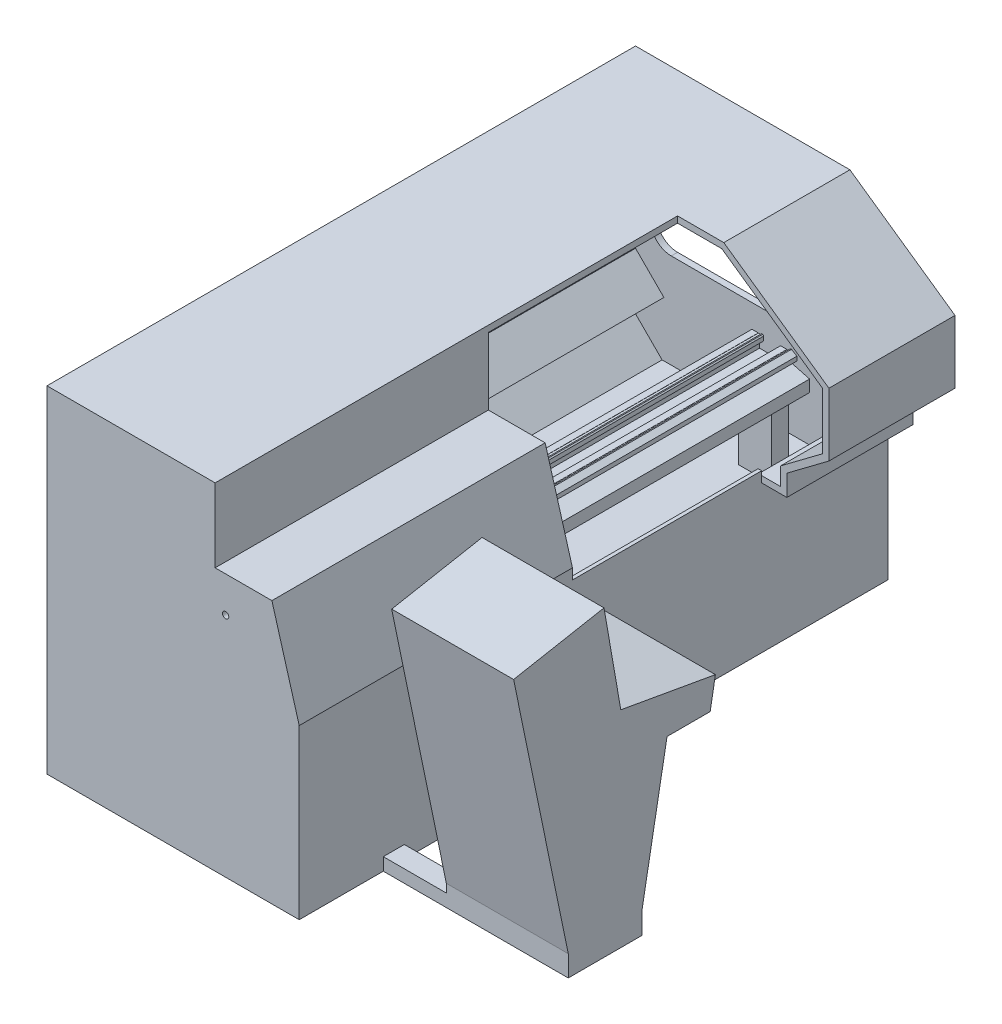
ISO-10303-21;
HEADER;
FILE_DESCRIPTION(('STEP AP214'),'2;1');
FILE_NAME('part.step','',(''),(''),'','','');
FILE_SCHEMA(('AUTOMOTIVE_DESIGN { 1 0 10303 214 1 1 1 1 }'));
ENDSEC;
DATA;
#1=APPLICATION_CONTEXT('core data for automotive mechanical design processes');
#2=APPLICATION_PROTOCOL_DEFINITION('international standard','automotive_design',2000,#1);
#3=PRODUCT_CONTEXT('',#1,'mechanical');
#4=PRODUCT('Part','Part','',(#3));
#5=PRODUCT_RELATED_PRODUCT_CATEGORY('part','',(#4));
#6=PRODUCT_DEFINITION_FORMATION('','',#4);
#7=PRODUCT_DEFINITION_CONTEXT('part definition',#1,'design');
#8=PRODUCT_DEFINITION('design','',#6,#7);
#9=PRODUCT_DEFINITION_SHAPE('','',#8);
#10=(LENGTH_UNIT() NAMED_UNIT(*) SI_UNIT(.MILLI.,.METRE.));
#11=(NAMED_UNIT(*) PLANE_ANGLE_UNIT() SI_UNIT($,.RADIAN.));
#12=(NAMED_UNIT(*) SI_UNIT($,.STERADIAN.) SOLID_ANGLE_UNIT());
#13=UNCERTAINTY_MEASURE_WITH_UNIT(LENGTH_MEASURE(1.E-05),#10,'distance_accuracy_value','');
#14=(GEOMETRIC_REPRESENTATION_CONTEXT(3) GLOBAL_UNCERTAINTY_ASSIGNED_CONTEXT((#13)) GLOBAL_UNIT_ASSIGNED_CONTEXT((#10,
#11,#12)) REPRESENTATION_CONTEXT('',''));
#15=CARTESIAN_POINT('',(0.,0.,0.));
#16=DIRECTION('',(0.,0.,1.));
#17=DIRECTION('',(1.,0.,0.));
#18=AXIS2_PLACEMENT_3D('',#15,#16,#17);
#19=CARTESIAN_POINT('',(1200.,0.,-2800.));
#20=DIRECTION('',(1.,0.,0.));
#21=DIRECTION('',(0.,0.,-1.));
#22=AXIS2_PLACEMENT_3D('',#19,#20,#21);
#23=PLANE('',#22);
#24=DIRECTION('',(0.,0.,1.));
#25=VECTOR('',#24,1.);
#26=CARTESIAN_POINT('',(1200.,0.,-2800.));
#27=LINE('',#26,#25);
#28=CARTESIAN_POINT('',(1200.,0.,-400.));
#29=VERTEX_POINT('',#28);
#30=CARTESIAN_POINT('',(1200.,0.,0.));
#31=VERTEX_POINT('',#30);
#32=EDGE_CURVE('E794',#29,#31,#27,.T.);
#33=ORIENTED_EDGE('',*,*,#32,.F.);
#34=DIRECTION('',(0.,-1.,0.));
#35=VECTOR('',#34,1.);
#36=CARTESIAN_POINT('',(1200.,60.,-400.));
#37=LINE('',#36,#35);
#38=CARTESIAN_POINT('',(1200.,60.,-400.));
#39=VERTEX_POINT('',#38);
#40=EDGE_CURVE('E60',#39,#29,#37,.T.);
#41=ORIENTED_EDGE('',*,*,#40,.F.);
#42=DIRECTION('',(0.,0.,1.));
#43=VECTOR('',#42,1.);
#44=CARTESIAN_POINT('',(1200.,60.,-400.));
#45=LINE('',#44,#43);
#46=CARTESIAN_POINT('',(1200.,60.,-500.));
#47=VERTEX_POINT('',#46);
#48=EDGE_CURVE('E726',#47,#39,#45,.T.);
#49=ORIENTED_EDGE('',*,*,#48,.F.);
#50=DIRECTION('',(0.,1.,0.));
#51=VECTOR('',#50,1.);
#52=CARTESIAN_POINT('',(1200.,60.,-500.));
#53=LINE('',#52,#51);
#54=CARTESIAN_POINT('',(1200.,0.,-500.));
#55=VERTEX_POINT('',#54);
#56=EDGE_CURVE('E724',#55,#47,#53,.T.);
#57=ORIENTED_EDGE('',*,*,#56,.F.);
#58=CARTESIAN_POINT('',(1200.,0.,-2800.));
#59=VERTEX_POINT('',#58);
#60=EDGE_CURVE('E795',#59,#55,#27,.T.);
#61=ORIENTED_EDGE('',*,*,#60,.F.);
#62=DIRECTION('',(0.,1.,0.));
#63=VECTOR('',#62,1.);
#64=CARTESIAN_POINT('',(1200.,0.,-2800.));
#65=LINE('',#64,#63);
#66=CARTESIAN_POINT('',(1200.,699.999999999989,-2800.));
#67=VERTEX_POINT('',#66);
#68=EDGE_CURVE('E828',#59,#67,#65,.T.);
#69=ORIENTED_EDGE('',*,*,#68,.T.);
#70=DIRECTION('',(0.,0.,1.));
#71=VECTOR('',#70,1.);
#72=CARTESIAN_POINT('',(1200.,699.999999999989,-2800.));
#73=LINE('',#72,#71);
#74=CARTESIAN_POINT('',(1200.,699.999999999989,-2200.));
#75=VERTEX_POINT('',#74);
#76=EDGE_CURVE('E797',#67,#75,#73,.T.);
#77=ORIENTED_EDGE('',*,*,#76,.T.);
#78=DIRECTION('',(0.,-1.,0.));
#79=VECTOR('',#78,1.);
#80=CARTESIAN_POINT('',(1200.,699.999999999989,-2200.));
#81=LINE('',#80,#79);
#82=CARTESIAN_POINT('',(1200.,729.999999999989,-2200.));
#83=VERTEX_POINT('',#82);
#84=EDGE_CURVE('E875',#83,#75,#81,.T.);
#85=ORIENTED_EDGE('',*,*,#84,.F.);
#86=CARTESIAN_POINT('',(1200.,750.,-2200.));
#87=VERTEX_POINT('',#86);
#88=EDGE_CURVE('E869',#87,#83,#81,.T.);
#89=ORIENTED_EDGE('',*,*,#88,.F.);
#90=DIRECTION('',(0.,0.,-1.));
#91=VECTOR('',#90,1.);
#92=CARTESIAN_POINT('',(1200.,750.,-1300.));
#93=LINE('',#92,#91);
#94=CARTESIAN_POINT('',(1200.,750.,-1300.));
#95=VERTEX_POINT('',#94);
#96=EDGE_CURVE('E973',#95,#87,#93,.T.);
#97=ORIENTED_EDGE('',*,*,#96,.F.);
#98=DIRECTION('',(0.,-1.,0.));
#99=VECTOR('',#98,1.);
#100=CARTESIAN_POINT('',(1200.,1570.,-1300.));
#101=LINE('',#100,#99);
#102=CARTESIAN_POINT('',(1200.,800.,-1300.));
#103=VERTEX_POINT('',#102);
#104=EDGE_CURVE('E977',#103,#95,#101,.T.);
#105=ORIENTED_EDGE('',*,*,#104,.F.);
#106=DIRECTION('',(0.,0.,1.));
#107=VECTOR('',#106,1.);
#108=CARTESIAN_POINT('',(1200.,800.,-2200.));
#109=LINE('',#108,#107);
#110=CARTESIAN_POINT('',(1200.,800.,0.));
#111=VERTEX_POINT('',#110);
#112=EDGE_CURVE('E865',#103,#111,#109,.T.);
#113=ORIENTED_EDGE('',*,*,#112,.T.);
#114=DIRECTION('',(0.,1.,0.));
#115=VECTOR('',#114,1.);
#116=CARTESIAN_POINT('',(1200.,0.,0.));
#117=LINE('',#116,#115);
#118=EDGE_CURVE('E840',#31,#111,#117,.T.);
#119=ORIENTED_EDGE('',*,*,#118,.F.);
#120=EDGE_LOOP('',(#33,#41,#49,#57,#61,#69,#77,#85,#89,#97,#105,#113,#119));
#121=FACE_BOUND('',#120,.T.);
#122=ADVANCED_FACE('F43',(#121),#23,.T.);
#123=CARTESIAN_POINT('',(850.,1080.,-1340.));
#124=DIRECTION('',(0.,0.,-1.));
#125=DIRECTION('',(-1.,0.,0.));
#126=AXIS2_PLACEMENT_3D('',#123,#124,#125);
#127=PLANE('',#126);
#128=CARTESIAN_POINT('',(850.,1080.,-1340.));
#129=DIRECTION('',(0.,0.,-1.));
#130=DIRECTION('',(-1.,0.,0.));
#131=AXIS2_PLACEMENT_3D('',#128,#129,#130);
#132=CIRCLE('',#131,70.0000000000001);
#133=CARTESIAN_POINT('',(780.,1080.,-1340.));
#134=VERTEX_POINT('',#133);
#135=EDGE_CURVE('E1108',#134,#134,#132,.T.);
#136=ORIENTED_EDGE('',*,*,#135,.T.);
#137=EDGE_LOOP('',(#136));
#138=FACE_BOUND('',#137,.T.);
#139=CARTESIAN_POINT('',(850.,1080.,-1340.));
#140=DIRECTION('',(0.,0.,-1.));
#141=DIRECTION('',(-1.,0.,0.));
#142=AXIS2_PLACEMENT_3D('',#139,#140,#141);
#143=CIRCLE('',#142,67.);
#144=CARTESIAN_POINT('',(783.,1080.,-1340.));
#145=VERTEX_POINT('',#144);
#146=EDGE_CURVE('E1382',#145,#145,#143,.T.);
#147=ORIENTED_EDGE('',*,*,#146,.F.);
#148=EDGE_LOOP('',(#147));
#149=FACE_BOUND('',#148,.T.);
#150=ADVANCED_FACE('F1508',(#138,#149),#127,.T.);
#151=CARTESIAN_POINT('',(1185.,663.83041450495,-2770.));
#152=DIRECTION('',(0.707106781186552,-0.707106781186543,0.));
#153=DIRECTION('',(0.707106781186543,0.707106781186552,0.));
#154=AXIS2_PLACEMENT_3D('',#151,#152,#153);
#155=PLANE('',#154);
#156=DIRECTION('',(0.707106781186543,0.707106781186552,0.));
#157=VECTOR('',#156,1.);
#158=CARTESIAN_POINT('',(1185.,663.83041450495,-2520.));
#159=LINE('',#158,#157);
#160=CARTESIAN_POINT('',(921.169585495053,400.,-2520.));
#161=VERTEX_POINT('',#160);
#162=CARTESIAN_POINT('',(928.,406.830414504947,-2520.));
#163=VERTEX_POINT('',#162);
#164=EDGE_CURVE('E1356',#161,#163,#159,.T.);
#165=ORIENTED_EDGE('',*,*,#164,.F.);
#166=DIRECTION('',(0.,0.,1.));
#167=VECTOR('',#166,1.);
#168=CARTESIAN_POINT('',(921.169585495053,400.,-2770.));
#169=LINE('',#168,#167);
#170=CARTESIAN_POINT('',(921.169585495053,400.,-1380.));
#171=VERTEX_POINT('',#170);
#172=EDGE_CURVE('E902',#161,#171,#169,.T.);
#173=ORIENTED_EDGE('',*,*,#172,.T.);
#174=DIRECTION('',(-0.707106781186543,-0.707106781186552,0.));
#175=VECTOR('',#174,1.);
#176=CARTESIAN_POINT('',(1185.,663.83041450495,-1380.));
#177=LINE('',#176,#175);
#178=CARTESIAN_POINT('',(1141.16958549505,620.,-1380.));
#179=VERTEX_POINT('',#178);
#180=EDGE_CURVE('E1323',#179,#171,#177,.T.);
#181=ORIENTED_EDGE('',*,*,#180,.F.);
#182=DIRECTION('',(0.,0.,-1.));
#183=VECTOR('',#182,1.);
#184=CARTESIAN_POINT('',(1141.16958549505,620.,-2770.));
#185=LINE('',#184,#183);
#186=CARTESIAN_POINT('',(1141.16958549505,620.,-1300.));
#187=VERTEX_POINT('',#186);
#188=EDGE_CURVE('E52',#187,#179,#185,.T.);
#189=ORIENTED_EDGE('',*,*,#188,.F.);
#190=DIRECTION('',(0.707106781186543,0.707106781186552,0.));
#191=VECTOR('',#190,1.);
#192=CARTESIAN_POINT('',(1185.,663.83041450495,-1300.));
#193=LINE('',#192,#191);
#194=CARTESIAN_POINT('',(1185.,663.83041450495,-1300.));
#195=VERTEX_POINT('',#194);
#196=EDGE_CURVE('E943',#187,#195,#193,.T.);
#197=ORIENTED_EDGE('',*,*,#196,.T.);
#198=DIRECTION('',(0.,0.,1.));
#199=VECTOR('',#198,1.);
#200=CARTESIAN_POINT('',(1185.,663.83041450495,-2770.));
#201=LINE('',#200,#199);
#202=CARTESIAN_POINT('',(1185.,663.83041450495,-2770.));
#203=VERTEX_POINT('',#202);
#204=EDGE_CURVE('E906',#203,#195,#201,.T.);
#205=ORIENTED_EDGE('',*,*,#204,.F.);
#206=DIRECTION('',(0.707106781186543,0.707106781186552,0.));
#207=VECTOR('',#206,1.);
#208=CARTESIAN_POINT('',(1185.,663.83041450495,-2770.));
#209=LINE('',#208,#207);
#210=CARTESIAN_POINT('',(921.169585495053,400.,-2770.));
#211=VERTEX_POINT('',#210);
#212=EDGE_CURVE('E917',#211,#203,#209,.T.);
#213=ORIENTED_EDGE('',*,*,#212,.F.);
#214=CARTESIAN_POINT('',(921.169585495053,400.,-2600.));
#215=VERTEX_POINT('',#214);
#216=EDGE_CURVE('E903',#211,#215,#169,.T.);
#217=ORIENTED_EDGE('',*,*,#216,.T.);
#218=DIRECTION('',(0.707106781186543,0.707106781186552,0.));
#219=VECTOR('',#218,1.);
#220=CARTESIAN_POINT('',(1185.,663.83041450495,-2600.));
#221=LINE('',#220,#219);
#222=CARTESIAN_POINT('',(928.,406.830414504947,-2600.));
#223=VERTEX_POINT('',#222);
#224=EDGE_CURVE('E68',#215,#223,#221,.T.);
#225=ORIENTED_EDGE('',*,*,#224,.T.);
#226=DIRECTION('',(0.,0.,1.));
#227=VECTOR('',#226,1.);
#228=CARTESIAN_POINT('',(928.,406.830414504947,-2770.));
#229=LINE('',#228,#227);
#230=EDGE_CURVE('E1353',#223,#163,#229,.T.);
#231=ORIENTED_EDGE('',*,*,#230,.T.);
#232=EDGE_LOOP('',(#165,#173,#181,#189,#197,#205,#213,#217,#225,#231));
#233=FACE_BOUND('',#232,.T.);
#234=ADVANCED_FACE('F1513',(#233),#155,.F.);
#235=CARTESIAN_POINT('',(921.169585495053,400.,-2770.));
#236=DIRECTION('',(0.,-1.,0.));
#237=DIRECTION('',(1.,0.,0.));
#238=AXIS2_PLACEMENT_3D('',#235,#236,#237);
#239=PLANE('',#238);
#240=DIRECTION('',(1.,0.,0.));
#241=VECTOR('',#240,1.);
#242=CARTESIAN_POINT('',(921.169585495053,400.,-2520.));
#243=LINE('',#242,#241);
#244=CARTESIAN_POINT('',(770.877064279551,400.,-2520.));
#245=VERTEX_POINT('',#244);
#246=EDGE_CURVE('E1358',#245,#161,#243,.T.);
#247=ORIENTED_EDGE('',*,*,#246,.F.);
#248=DIRECTION('',(0.,0.,-1.));
#249=VECTOR('',#248,1.);
#250=CARTESIAN_POINT('',(770.877064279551,400.,-2770.));
#251=LINE('',#250,#249);
#252=CARTESIAN_POINT('',(770.877064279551,400.,-2600.));
#253=VERTEX_POINT('',#252);
#254=EDGE_CURVE('E13',#245,#253,#251,.T.);
#255=ORIENTED_EDGE('',*,*,#254,.T.);
#256=DIRECTION('',(1.,0.,0.));
#257=VECTOR('',#256,1.);
#258=CARTESIAN_POINT('',(921.169585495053,400.,-2600.));
#259=LINE('',#258,#257);
#260=EDGE_CURVE('E1361',#253,#215,#259,.T.);
#261=ORIENTED_EDGE('',*,*,#260,.T.);
#262=ORIENTED_EDGE('',*,*,#216,.F.);
#263=DIRECTION('',(1.,0.,0.));
#264=VECTOR('',#263,1.);
#265=CARTESIAN_POINT('',(921.169585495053,400.,-2770.));
#266=LINE('',#265,#264);
#267=CARTESIAN_POINT('',(156.520894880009,400.,-2770.));
#268=VERTEX_POINT('',#267);
#269=EDGE_CURVE('E920',#268,#211,#266,.T.);
#270=ORIENTED_EDGE('',*,*,#269,.F.);
#271=DIRECTION('',(0.,0.,1.));
#272=VECTOR('',#271,1.);
#273=CARTESIAN_POINT('',(156.520894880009,400.,-2770.));
#274=LINE('',#273,#272);
#275=CARTESIAN_POINT('',(156.520894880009,400.,-1380.));
#276=VERTEX_POINT('',#275);
#277=EDGE_CURVE('E899',#268,#276,#274,.T.);
#278=ORIENTED_EDGE('',*,*,#277,.T.);
#279=DIRECTION('',(-1.,0.,0.));
#280=VECTOR('',#279,1.);
#281=CARTESIAN_POINT('',(921.169585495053,400.,-1380.));
#282=LINE('',#281,#280);
#283=EDGE_CURVE('E1337',#171,#276,#282,.T.);
#284=ORIENTED_EDGE('',*,*,#283,.F.);
#285=ORIENTED_EDGE('',*,*,#172,.F.);
#286=EDGE_LOOP('',(#247,#255,#261,#262,#270,#278,#284,#285));
#287=FACE_BOUND('',#286,.T.);
#288=ADVANCED_FACE('F1577',(#287),#239,.F.);
#289=CARTESIAN_POINT('',(928.,736.124355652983,-2600.));
#290=DIRECTION('',(0.,1.,0.));
#291=DIRECTION('',(0.,0.,1.));
#292=AXIS2_PLACEMENT_3D('',#289,#290,#291);
#293=PLANE('',#292);
#294=DIRECTION('',(1.,0.,0.));
#295=VECTOR('',#294,1.);
#296=CARTESIAN_POINT('',(928.,736.124355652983,-2520.));
#297=LINE('',#296,#295);
#298=CARTESIAN_POINT('',(828.,736.124355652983,-2520.));
#299=VERTEX_POINT('',#298);
#300=CARTESIAN_POINT('',(928.,736.124355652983,-2520.));
#301=VERTEX_POINT('',#300);
#302=EDGE_CURVE('E1369',#299,#301,#297,.T.);
#303=ORIENTED_EDGE('',*,*,#302,.T.);
#304=DIRECTION('',(0.,0.,1.));
#305=VECTOR('',#304,1.);
#306=CARTESIAN_POINT('',(928.,736.124355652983,-2600.));
#307=LINE('',#306,#305);
#308=CARTESIAN_POINT('',(928.,736.124355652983,-1380.));
#309=VERTEX_POINT('',#308);
#310=EDGE_CURVE('E1185',#301,#309,#307,.T.);
#311=ORIENTED_EDGE('',*,*,#310,.T.);
#312=DIRECTION('',(1.,0.,0.));
#313=VECTOR('',#312,1.);
#314=CARTESIAN_POINT('',(928.,736.124355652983,-1380.));
#315=LINE('',#314,#313);
#316=CARTESIAN_POINT('',(828.,736.124355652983,-1380.));
#317=VERTEX_POINT('',#316);
#318=EDGE_CURVE('E1345',#317,#309,#315,.T.);
#319=ORIENTED_EDGE('',*,*,#318,.F.);
#320=DIRECTION('',(0.,0.,1.));
#321=VECTOR('',#320,1.);
#322=CARTESIAN_POINT('',(828.,736.124355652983,-2600.));
#323=LINE('',#322,#321);
#324=EDGE_CURVE('E1190',#299,#317,#323,.T.);
#325=ORIENTED_EDGE('',*,*,#324,.F.);
#326=EDGE_LOOP('',(#303,#311,#319,#325));
#327=FACE_BOUND('',#326,.T.);
#328=ADVANCED_FACE('F1557',(#327),#293,.F.);
#329=CARTESIAN_POINT('',(30.0000000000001,400.,-1300.));
#330=DIRECTION('',(0.,0.,-1.));
#331=DIRECTION('',(-1.,0.,0.));
#332=AXIS2_PLACEMENT_3D('',#329,#330,#331);
#333=PLANE('',#332);
#334=CARTESIAN_POINT('',(850.,1080.,-1300.));
#335=DIRECTION('',(0.,0.,-1.));
#336=DIRECTION('',(-1.,0.,0.));
#337=AXIS2_PLACEMENT_3D('',#334,#335,#336);
#338=CIRCLE('',#337,85.);
#339=CARTESIAN_POINT('',(765.,1080.,-1300.));
#340=VERTEX_POINT('',#339);
#341=EDGE_CURVE('E1105',#340,#340,#338,.T.);
#342=ORIENTED_EDGE('',*,*,#341,.F.);
#343=EDGE_LOOP('',(#342));
#344=FACE_BOUND('',#343,.T.);
#345=DIRECTION('',(1.,0.,0.));
#346=VECTOR('',#345,1.);
#347=CARTESIAN_POINT('',(1146.26569635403,620.,-1300.));
#348=LINE('',#347,#346);
#349=CARTESIAN_POINT('',(928.,620.,-1300.));
#350=VERTEX_POINT('',#349);
#351=EDGE_CURVE('E1351',#350,#187,#348,.T.);
#352=ORIENTED_EDGE('',*,*,#351,.F.);
#353=DIRECTION('',(0.,-1.,0.));
#354=VECTOR('',#353,1.);
#355=CARTESIAN_POINT('',(928.,786.113248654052,-1300.));
#356=LINE('',#355,#354);
#357=CARTESIAN_POINT('',(928.,786.113248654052,-1300.));
#358=VERTEX_POINT('',#357);
#359=EDGE_CURVE('E1270',#358,#350,#356,.T.);
#360=ORIENTED_EDGE('',*,*,#359,.F.);
#361=DIRECTION('',(-1.,0.,0.));
#362=VECTOR('',#361,1.);
#363=CARTESIAN_POINT('',(1028.,786.113248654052,-1300.));
#364=LINE('',#363,#362);
#365=CARTESIAN_POINT('',(1028.,786.113248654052,-1300.));
#366=VERTEX_POINT('',#365);
#367=EDGE_CURVE('E1272',#366,#358,#364,.T.);
#368=ORIENTED_EDGE('',*,*,#367,.F.);
#369=DIRECTION('',(0.,-1.,0.));
#370=VECTOR('',#369,1.);
#371=CARTESIAN_POINT('',(1028.,841.997821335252,-1300.));
#372=LINE('',#371,#370);
#373=CARTESIAN_POINT('',(1028.,841.997821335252,-1300.));
#374=VERTEX_POINT('',#373);
#375=EDGE_CURVE('E1274',#374,#366,#372,.T.);
#376=ORIENTED_EDGE('',*,*,#375,.F.);
#377=DIRECTION('',(0.96592582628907,-0.258819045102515,0.));
#378=VECTOR('',#377,1.);
#379=CARTESIAN_POINT('',(938.,866.113248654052,-1300.));
#380=LINE('',#379,#378);
#381=CARTESIAN_POINT('',(938.,866.113248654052,-1300.));
#382=VERTEX_POINT('',#381);
#383=EDGE_CURVE('E1276',#382,#374,#380,.T.);
#384=ORIENTED_EDGE('',*,*,#383,.F.);
#385=DIRECTION('',(0.,-1.,0.));
#386=VECTOR('',#385,1.);
#387=CARTESIAN_POINT('',(938.,886.113248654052,-1300.));
#388=LINE('',#387,#386);
#389=CARTESIAN_POINT('',(938.,886.113248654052,-1300.));
#390=VERTEX_POINT('',#389);
#391=EDGE_CURVE('E1278',#390,#382,#388,.T.);
#392=ORIENTED_EDGE('',*,*,#391,.F.);
#393=DIRECTION('',(-1.,0.,0.));
#394=VECTOR('',#393,1.);
#395=CARTESIAN_POINT('',(968.,886.113248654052,-1300.));
#396=LINE('',#395,#394);
#397=CARTESIAN_POINT('',(968.,886.113248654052,-1300.));
#398=VERTEX_POINT('',#397);
#399=EDGE_CURVE('E1280',#398,#390,#396,.T.);
#400=ORIENTED_EDGE('',*,*,#399,.F.);
#401=DIRECTION('',(0.,-1.,0.));
#402=VECTOR('',#401,1.);
#403=CARTESIAN_POINT('',(968.,906.113248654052,-1300.));
#404=LINE('',#403,#402);
#405=CARTESIAN_POINT('',(968.,906.113248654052,-1300.));
#406=VERTEX_POINT('',#405);
#407=EDGE_CURVE('E1282',#406,#398,#404,.T.);
#408=ORIENTED_EDGE('',*,*,#407,.F.);
#409=DIRECTION('',(0.866025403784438,-0.500000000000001,0.));
#410=VECTOR('',#409,1.);
#411=CARTESIAN_POINT('',(942.,921.124355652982,-1300.));
#412=LINE('',#411,#410);
#413=CARTESIAN_POINT('',(942.,921.124355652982,-1300.));
#414=VERTEX_POINT('',#413);
#415=EDGE_CURVE('E1284',#414,#406,#412,.T.);
#416=ORIENTED_EDGE('',*,*,#415,.F.);
#417=DIRECTION('',(1.,0.,0.));
#418=VECTOR('',#417,1.);
#419=CARTESIAN_POINT('',(937.,921.124355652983,-1300.));
#420=LINE('',#419,#418);
#421=CARTESIAN_POINT('',(937.,921.124355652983,-1300.));
#422=VERTEX_POINT('',#421);
#423=EDGE_CURVE('E1286',#422,#414,#420,.T.);
#424=ORIENTED_EDGE('',*,*,#423,.F.);
#425=DIRECTION('',(0.499999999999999,0.86602540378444,0.));
#426=VECTOR('',#425,1.);
#427=CARTESIAN_POINT('',(930.,909.,-1300.));
#428=LINE('',#427,#426);
#429=CARTESIAN_POINT('',(930.,909.,-1300.));
#430=VERTEX_POINT('',#429);
#431=EDGE_CURVE('E1288',#430,#422,#428,.T.);
#432=ORIENTED_EDGE('',*,*,#431,.F.);
#433=DIRECTION('',(1.,0.,0.));
#434=VECTOR('',#433,1.);
#435=CARTESIAN_POINT('',(920.,909.,-1300.));
#436=LINE('',#435,#434);
#437=CARTESIAN_POINT('',(920.,909.,-1300.));
#438=VERTEX_POINT('',#437);
#439=EDGE_CURVE('E1290',#438,#430,#436,.T.);
#440=ORIENTED_EDGE('',*,*,#439,.F.);
#441=DIRECTION('',(0.,-1.,0.));
#442=VECTOR('',#441,1.);
#443=CARTESIAN_POINT('',(920.,910.,-1300.));
#444=LINE('',#443,#442);
#445=CARTESIAN_POINT('',(920.,910.,-1300.));
#446=VERTEX_POINT('',#445);
#447=EDGE_CURVE('E1292',#446,#438,#444,.T.);
#448=ORIENTED_EDGE('',*,*,#447,.F.);
#449=DIRECTION('',(1.,0.,0.));
#450=VECTOR('',#449,1.);
#451=CARTESIAN_POINT('',(890.,910.,-1300.));
#452=LINE('',#451,#450);
#453=CARTESIAN_POINT('',(890.,910.,-1300.));
#454=VERTEX_POINT('',#453);
#455=EDGE_CURVE('E1294',#454,#446,#452,.T.);
#456=ORIENTED_EDGE('',*,*,#455,.F.);
#457=DIRECTION('',(0.,1.,0.));
#458=VECTOR('',#457,1.);
#459=CARTESIAN_POINT('',(890.,890.,-1300.));
#460=LINE('',#459,#458);
#461=CARTESIAN_POINT('',(890.,890.,-1300.));
#462=VERTEX_POINT('',#461);
#463=EDGE_CURVE('E1296',#462,#454,#460,.T.);
#464=ORIENTED_EDGE('',*,*,#463,.F.);
#465=DIRECTION('',(-1.,0.,0.));
#466=VECTOR('',#465,1.);
#467=CARTESIAN_POINT('',(910.,890.,-1300.));
#468=LINE('',#467,#466);
#469=CARTESIAN_POINT('',(910.,890.,-1300.));
#470=VERTEX_POINT('',#469);
#471=EDGE_CURVE('E1298',#470,#462,#468,.T.);
#472=ORIENTED_EDGE('',*,*,#471,.F.);
#473=DIRECTION('',(0.,1.,0.));
#474=VECTOR('',#473,1.);
#475=CARTESIAN_POINT('',(910.,850.,-1300.));
#476=LINE('',#475,#474);
#477=CARTESIAN_POINT('',(910.,850.,-1300.));
#478=VERTEX_POINT('',#477);
#479=EDGE_CURVE('E1300',#478,#470,#476,.T.);
#480=ORIENTED_EDGE('',*,*,#479,.F.);
#481=DIRECTION('',(1.,0.,0.));
#482=VECTOR('',#481,1.);
#483=CARTESIAN_POINT('',(790.,850.,-1300.));
#484=LINE('',#483,#482);
#485=CARTESIAN_POINT('',(790.,850.,-1300.));
#486=VERTEX_POINT('',#485);
#487=EDGE_CURVE('E1302',#486,#478,#484,.T.);
#488=ORIENTED_EDGE('',*,*,#487,.F.);
#489=DIRECTION('',(0.,-1.,0.));
#490=VECTOR('',#489,1.);
#491=CARTESIAN_POINT('',(790.,890.,-1300.));
#492=LINE('',#491,#490);
#493=CARTESIAN_POINT('',(790.,890.,-1300.));
#494=VERTEX_POINT('',#493);
#495=EDGE_CURVE('E1304',#494,#486,#492,.T.);
#496=ORIENTED_EDGE('',*,*,#495,.F.);
#497=DIRECTION('',(-1.,0.,0.));
#498=VECTOR('',#497,1.);
#499=CARTESIAN_POINT('',(810.,890.,-1300.));
#500=LINE('',#499,#498);
#501=CARTESIAN_POINT('',(810.,890.,-1300.));
#502=VERTEX_POINT('',#501);
#503=EDGE_CURVE('E1306',#502,#494,#500,.T.);
#504=ORIENTED_EDGE('',*,*,#503,.F.);
#505=DIRECTION('',(0.,-1.,0.));
#506=VECTOR('',#505,1.);
#507=CARTESIAN_POINT('',(810.,910.,-1300.));
#508=LINE('',#507,#506);
#509=CARTESIAN_POINT('',(810.,910.,-1300.));
#510=VERTEX_POINT('',#509);
#511=EDGE_CURVE('E1308',#510,#502,#508,.T.);
#512=ORIENTED_EDGE('',*,*,#511,.F.);
#513=DIRECTION('',(0.707106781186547,-0.707106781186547,0.));
#514=VECTOR('',#513,1.);
#515=CARTESIAN_POINT('',(805.,915.,-1300.));
#516=LINE('',#515,#514);
#517=CARTESIAN_POINT('',(805.,915.,-1300.));
#518=VERTEX_POINT('',#517);
#519=EDGE_CURVE('E1310',#518,#510,#516,.T.);
#520=ORIENTED_EDGE('',*,*,#519,.F.);
#521=DIRECTION('',(1.,0.,0.));
#522=VECTOR('',#521,1.);
#523=CARTESIAN_POINT('',(800.,915.,-1300.));
#524=LINE('',#523,#522);
#525=CARTESIAN_POINT('',(800.,915.,-1300.));
#526=VERTEX_POINT('',#525);
#527=EDGE_CURVE('E1312',#526,#518,#524,.T.);
#528=ORIENTED_EDGE('',*,*,#527,.F.);
#529=DIRECTION('',(0.707106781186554,0.707106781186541,0.));
#530=VECTOR('',#529,1.);
#531=CARTESIAN_POINT('',(794.,909.,-1300.));
#532=LINE('',#531,#530);
#533=CARTESIAN_POINT('',(794.,909.,-1300.));
#534=VERTEX_POINT('',#533);
#535=EDGE_CURVE('E1314',#534,#526,#532,.T.);
#536=ORIENTED_EDGE('',*,*,#535,.F.);
#537=DIRECTION('',(1.,0.,0.));
#538=VECTOR('',#537,1.);
#539=CARTESIAN_POINT('',(794.,909.,-1300.));
#540=LINE('',#539,#538);
#541=CARTESIAN_POINT('',(783.999999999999,909.,-1300.));
#542=VERTEX_POINT('',#541);
#543=EDGE_CURVE('E1316',#542,#534,#540,.T.);
#544=ORIENTED_EDGE('',*,*,#543,.F.);
#545=DIRECTION('',(-1.11022302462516E-13,-1.,0.));
#546=VECTOR('',#545,1.);
#547=CARTESIAN_POINT('',(784.,910.,-1300.));
#548=LINE('',#547,#546);
#549=CARTESIAN_POINT('',(784.,910.,-1300.));
#550=VERTEX_POINT('',#549);
#551=EDGE_CURVE('E1318',#550,#542,#548,.T.);
#552=ORIENTED_EDGE('',*,*,#551,.F.);
#553=DIRECTION('',(1.,0.,0.));
#554=VECTOR('',#553,1.);
#555=CARTESIAN_POINT('',(784.,910.,-1300.));
#556=LINE('',#555,#554);
#557=CARTESIAN_POINT('',(754.,910.,-1300.));
#558=VERTEX_POINT('',#557);
#559=EDGE_CURVE('E1261',#558,#550,#556,.T.);
#560=ORIENTED_EDGE('',*,*,#559,.F.);
#561=DIRECTION('',(0.,1.,0.));
#562=VECTOR('',#561,1.);
#563=CARTESIAN_POINT('',(754.,910.,-1300.));
#564=LINE('',#563,#562);
#565=CARTESIAN_POINT('',(754.,786.113248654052,-1300.));
#566=VERTEX_POINT('',#565);
#567=EDGE_CURVE('E1263',#566,#558,#564,.T.);
#568=ORIENTED_EDGE('',*,*,#567,.F.);
#569=DIRECTION('',(-1.,0.,0.));
#570=VECTOR('',#569,1.);
#571=CARTESIAN_POINT('',(754.,786.113248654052,-1300.));
#572=LINE('',#571,#570);
#573=CARTESIAN_POINT('',(828.,786.113248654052,-1300.));
#574=VERTEX_POINT('',#573);
#575=EDGE_CURVE('E1266',#574,#566,#572,.T.);
#576=ORIENTED_EDGE('',*,*,#575,.F.);
#577=DIRECTION('',(0.,1.,0.));
#578=VECTOR('',#577,1.);
#579=CARTESIAN_POINT('',(828.,736.124355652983,-1300.));
#580=LINE('',#579,#578);
#581=CARTESIAN_POINT('',(828.,620.,-1300.));
#582=VERTEX_POINT('',#581);
#583=EDGE_CURVE('E1268',#582,#574,#580,.T.);
#584=ORIENTED_EDGE('',*,*,#583,.F.);
#585=DIRECTION('',(1.,0.,0.));
#586=VECTOR('',#585,1.);
#587=CARTESIAN_POINT('',(828.,620.,-1300.));
#588=LINE('',#587,#586);
#589=CARTESIAN_POINT('',(123.479105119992,620.,-1300.));
#590=VERTEX_POINT('',#589);
#591=EDGE_CURVE('E1348',#590,#582,#588,.T.);
#592=ORIENTED_EDGE('',*,*,#591,.F.);
#593=DIRECTION('',(-0.707106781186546,-0.707106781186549,0.));
#594=VECTOR('',#593,1.);
#595=CARTESIAN_POINT('',(30.0000000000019,526.52089488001,-1300.));
#596=LINE('',#595,#594);
#597=CARTESIAN_POINT('',(165.,661.520894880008,-1300.));
#598=VERTEX_POINT('',#597);
#599=EDGE_CURVE('E945',#598,#590,#596,.T.);
#600=ORIENTED_EDGE('',*,*,#599,.F.);
#601=DIRECTION('',(0.707106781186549,-0.707106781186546,0.));
#602=VECTOR('',#601,1.);
#603=CARTESIAN_POINT('',(30.0000000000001,796.520894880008,-1300.));
#604=LINE('',#603,#602);
#605=CARTESIAN_POINT('',(30.0000000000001,796.520894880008,-1300.));
#606=VERTEX_POINT('',#605);
#607=EDGE_CURVE('E948',#606,#598,#604,.T.);
#608=ORIENTED_EDGE('',*,*,#607,.F.);
#609=DIRECTION('',(0.,-1.,0.));
#610=VECTOR('',#609,1.);
#611=CARTESIAN_POINT('',(30.,1570.,-1300.));
#612=LINE('',#611,#610);
#613=CARTESIAN_POINT('',(30.,1570.,-1300.));
#614=VERTEX_POINT('',#613);
#615=EDGE_CURVE('E951',#614,#606,#612,.T.);
#616=ORIENTED_EDGE('',*,*,#615,.F.);
#617=DIRECTION('',(-1.,0.,0.));
#618=VECTOR('',#617,1.);
#619=CARTESIAN_POINT('',(30.,1570.,-1300.));
#620=LINE('',#619,#618);
#621=CARTESIAN_POINT('',(800.,1570.,-1300.));
#622=VERTEX_POINT('',#621);
#623=EDGE_CURVE('E935',#622,#614,#620,.T.);
#624=ORIENTED_EDGE('',*,*,#623,.F.);
#625=DIRECTION('',(0.,1.,0.));
#626=VECTOR('',#625,1.);
#627=CARTESIAN_POINT('',(800.,1250.,-1300.));
#628=LINE('',#627,#626);
#629=CARTESIAN_POINT('',(800.,1250.,-1300.));
#630=VERTEX_POINT('',#629);
#631=EDGE_CURVE('E960',#630,#622,#628,.T.);
#632=ORIENTED_EDGE('',*,*,#631,.F.);
#633=DIRECTION('',(-1.,0.,0.));
#634=VECTOR('',#633,1.);
#635=CARTESIAN_POINT('',(1070.,1250.,-1300.));
#636=LINE('',#635,#634);
#637=CARTESIAN_POINT('',(1070.,1250.,-1300.));
#638=VERTEX_POINT('',#637);
#639=EDGE_CURVE('E957',#638,#630,#636,.T.);
#640=ORIENTED_EDGE('',*,*,#639,.F.);
#641=DIRECTION('',(-0.277539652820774,0.960714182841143,0.));
#642=VECTOR('',#641,1.);
#643=CARTESIAN_POINT('',(1200.,800.,-1300.));
#644=LINE('',#643,#642);
#645=EDGE_CURVE('E954',#103,#638,#644,.T.);
#646=ORIENTED_EDGE('',*,*,#645,.F.);
#647=ORIENTED_EDGE('',*,*,#104,.T.);
#648=DIRECTION('',(1.,0.,0.));
#649=VECTOR('',#648,1.);
#650=CARTESIAN_POINT('',(700.,750.,-1300.));
#651=LINE('',#650,#649);
#652=CARTESIAN_POINT('',(1183.21767530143,750.,-1300.));
#653=VERTEX_POINT('',#652);
#654=EDGE_CURVE('E970',#653,#95,#651,.T.);
#655=ORIENTED_EDGE('',*,*,#654,.F.);
#656=DIRECTION('',(-0.277539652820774,0.960714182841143,0.));
#657=VECTOR('',#656,1.);
#658=CARTESIAN_POINT('',(1047.43989752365,1220.,-1300.));
#659=LINE('',#658,#657);
#660=CARTESIAN_POINT('',(1185.,743.830414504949,-1300.));
#661=VERTEX_POINT('',#660);
#662=EDGE_CURVE('E937',#661,#653,#659,.T.);
#663=ORIENTED_EDGE('',*,*,#662,.F.);
#664=DIRECTION('',(0.,1.,0.));
#665=VECTOR('',#664,1.);
#666=CARTESIAN_POINT('',(1185.,743.830414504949,-1300.));
#667=LINE('',#666,#665);
#668=EDGE_CURVE('E940',#195,#661,#667,.T.);
#669=ORIENTED_EDGE('',*,*,#668,.F.);
#670=ORIENTED_EDGE('',*,*,#196,.F.);
#671=EDGE_LOOP('',(#352,#360,#368,#376,#384,#392,#400,#408,#416,#424,#432,#440,#448,#456,#464,
#472,#480,#488,#496,#504,#512,#520,#528,#536,#544,#552,#560,#568,#576,#584,#592,#600,#608,#616,
#624,#632,#640,#646,#647,#655,#663,#669,#670));
#672=FACE_BOUND('',#671,.T.);
#673=ADVANCED_FACE('F1465',(#344,#672),#333,.T.);
#674=CARTESIAN_POINT('',(156.520894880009,400.,-2770.));
#675=DIRECTION('',(-0.707106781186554,-0.707106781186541,0.));
#676=DIRECTION('',(0.707106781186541,-0.707106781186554,0.));
#677=AXIS2_PLACEMENT_3D('',#674,#675,#676);
#678=PLANE('',#677);
#679=DIRECTION('',(0.707106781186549,-0.707106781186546,0.));
#680=VECTOR('',#679,1.);
#681=CARTESIAN_POINT('',(-521.739552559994,1078.26044744,-1380.));
#682=LINE('',#681,#680);
#683=CARTESIAN_POINT('',(0.,556.520894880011,-1380.));
#684=VERTEX_POINT('',#683);
#685=EDGE_CURVE('E1086',#684,#276,#682,.T.);
#686=ORIENTED_EDGE('',*,*,#685,.T.);
#687=ORIENTED_EDGE('',*,*,#277,.F.);
#688=DIRECTION('',(0.707106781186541,-0.707106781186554,0.));
#689=VECTOR('',#688,1.);
#690=CARTESIAN_POINT('',(156.520894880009,400.,-2770.));
#691=LINE('',#690,#689);
#692=CARTESIAN_POINT('',(30.0000000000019,526.52089488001,-2770.));
#693=VERTEX_POINT('',#692);
#694=EDGE_CURVE('E923',#693,#268,#691,.T.);
#695=ORIENTED_EDGE('',*,*,#694,.F.);
#696=DIRECTION('',(0.,0.,1.));
#697=VECTOR('',#696,1.);
#698=CARTESIAN_POINT('',(30.0000000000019,526.52089488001,-2770.));
#699=LINE('',#698,#697);
#700=CARTESIAN_POINT('',(30.0000000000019,526.52089488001,-2740.));
#701=VERTEX_POINT('',#700);
#702=EDGE_CURVE('E896',#693,#701,#699,.T.);
#703=ORIENTED_EDGE('',*,*,#702,.T.);
#704=DIRECTION('',(0.707106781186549,-0.707106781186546,0.));
#705=VECTOR('',#704,1.);
#706=CARTESIAN_POINT('',(-521.739552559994,1078.26044744,-2740.));
#707=LINE('',#706,#705);
#708=CARTESIAN_POINT('',(0.,556.520894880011,-2740.));
#709=VERTEX_POINT('',#708);
#710=EDGE_CURVE('E1088',#709,#701,#707,.T.);
#711=ORIENTED_EDGE('',*,*,#710,.F.);
#712=DIRECTION('',(0.,0.,1.));
#713=VECTOR('',#712,1.);
#714=CARTESIAN_POINT('',(0.,556.520894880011,-2800.));
#715=LINE('',#714,#713);
#716=EDGE_CURVE('E1083',#709,#684,#715,.T.);
#717=ORIENTED_EDGE('',*,*,#716,.T.);
#718=EDGE_LOOP('',(#686,#687,#695,#703,#711,#717));
#719=FACE_BOUND('',#718,.T.);
#720=ADVANCED_FACE('F1884',(#719),#678,.F.);
#721=CARTESIAN_POINT('',(30.0000000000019,526.52089488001,-2770.));
#722=DIRECTION('',(-0.707106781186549,0.707106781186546,0.));
#723=DIRECTION('',(-0.707106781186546,-0.707106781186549,0.));
#724=AXIS2_PLACEMENT_3D('',#721,#722,#723);
#725=PLANE('',#724);
#726=DIRECTION('',(0.,0.,1.));
#727=VECTOR('',#726,1.);
#728=CARTESIAN_POINT('',(123.479105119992,620.,-2770.));
#729=LINE('',#728,#727);
#730=CARTESIAN_POINT('',(123.479105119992,620.,-1380.));
#731=VERTEX_POINT('',#730);
#732=EDGE_CURVE('E1321',#731,#590,#729,.T.);
#733=ORIENTED_EDGE('',*,*,#732,.F.);
#734=DIRECTION('',(-0.707106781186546,-0.707106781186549,0.));
#735=VECTOR('',#734,1.);
#736=CARTESIAN_POINT('',(30.0000000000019,526.52089488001,-1380.));
#737=LINE('',#736,#735);
#738=CARTESIAN_POINT('',(143.786796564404,640.307691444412,-1380.));
#739=VERTEX_POINT('',#738);
#740=EDGE_CURVE('E1099',#739,#731,#737,.T.);
#741=ORIENTED_EDGE('',*,*,#740,.F.);
#742=DIRECTION('',(0.,0.,1.));
#743=VECTOR('',#742,1.);
#744=CARTESIAN_POINT('',(143.786796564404,640.307691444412,-1380.));
#745=LINE('',#744,#743);
#746=CARTESIAN_POINT('',(143.786796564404,640.307691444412,-2740.));
#747=VERTEX_POINT('',#746);
#748=EDGE_CURVE('E1089',#747,#739,#745,.T.);
#749=ORIENTED_EDGE('',*,*,#748,.F.);
#750=DIRECTION('',(0.707106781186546,0.707106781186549,0.));
#751=VECTOR('',#750,1.);
#752=CARTESIAN_POINT('',(30.0000000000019,526.52089488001,-2740.));
#753=LINE('',#752,#751);
#754=EDGE_CURVE('E1096',#701,#747,#753,.T.);
#755=ORIENTED_EDGE('',*,*,#754,.F.);
#756=ORIENTED_EDGE('',*,*,#702,.F.);
#757=DIRECTION('',(-0.707106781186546,-0.707106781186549,0.));
#758=VECTOR('',#757,1.);
#759=CARTESIAN_POINT('',(30.0000000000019,526.52089488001,-2770.));
#760=LINE('',#759,#758);
#761=CARTESIAN_POINT('',(165.,661.520894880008,-2770.));
#762=VERTEX_POINT('',#761);
#763=EDGE_CURVE('E926',#762,#693,#760,.T.);
#764=ORIENTED_EDGE('',*,*,#763,.F.);
#765=DIRECTION('',(0.,0.,1.));
#766=VECTOR('',#765,1.);
#767=CARTESIAN_POINT('',(165.,661.520894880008,-2770.));
#768=LINE('',#767,#766);
#769=EDGE_CURVE('E893',#762,#598,#768,.T.);
#770=ORIENTED_EDGE('',*,*,#769,.T.);
#771=ORIENTED_EDGE('',*,*,#599,.T.);
#772=EDGE_LOOP('',(#733,#741,#749,#755,#756,#764,#770,#771));
#773=FACE_BOUND('',#772,.T.);
#774=ADVANCED_FACE('F1543',(#773),#725,.F.);
#775=CARTESIAN_POINT('',(850.,1080.,-1334.));
#776=DIRECTION('',(0.,0.,-1.));
#777=DIRECTION('',(-1.,0.,0.));
#778=AXIS2_PLACEMENT_3D('',#775,#776,#777);
#779=PLANE('',#778);
#780=CARTESIAN_POINT('',(850.,1080.,-1334.));
#781=DIRECTION('',(0.,0.,-1.));
#782=DIRECTION('',(-1.,0.,0.));
#783=AXIS2_PLACEMENT_3D('',#780,#781,#782);
#784=CIRCLE('',#783,85.);
#785=CARTESIAN_POINT('',(765.,1080.,-1334.));
#786=VERTEX_POINT('',#785);
#787=EDGE_CURVE('E1102',#786,#786,#784,.T.);
#788=ORIENTED_EDGE('',*,*,#787,.T.);
#789=EDGE_LOOP('',(#788));
#790=FACE_BOUND('',#789,.T.);
#791=CARTESIAN_POINT('',(850.,1080.,-1334.));
#792=DIRECTION('',(0.,0.,-1.));
#793=DIRECTION('',(-1.,0.,0.));
#794=AXIS2_PLACEMENT_3D('',#791,#792,#793);
#795=CIRCLE('',#794,70.0000000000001);
#796=CARTESIAN_POINT('',(780.,1080.,-1334.));
#797=VERTEX_POINT('',#796);
#798=EDGE_CURVE('E1111',#797,#797,#795,.T.);
#799=ORIENTED_EDGE('',*,*,#798,.F.);
#800=EDGE_LOOP('',(#799));
#801=FACE_BOUND('',#800,.T.);
#802=ADVANCED_FACE('F1812',(#790,#801),#779,.T.);
#803=CARTESIAN_POINT('',(1047.43989752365,1220.,-2770.));
#804=DIRECTION('',(0.960714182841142,0.277539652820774,0.));
#805=DIRECTION('',(-0.277539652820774,0.960714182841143,0.));
#806=AXIS2_PLACEMENT_3D('',#803,#804,#805);
#807=PLANE('',#806);
#808=DIRECTION('',(-0.277539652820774,0.960714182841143,0.));
#809=VECTOR('',#808,1.);
#810=CARTESIAN_POINT('',(1047.43989752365,1220.,-2200.));
#811=LINE('',#810,#809);
#812=CARTESIAN_POINT('',(1185.,743.830414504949,-2200.));
#813=VERTEX_POINT('',#812);
#814=CARTESIAN_POINT('',(1183.21767530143,750.,-2200.));
#815=VERTEX_POINT('',#814);
#816=EDGE_CURVE('E979',#813,#815,#811,.T.);
#817=ORIENTED_EDGE('',*,*,#816,.F.);
#818=DIRECTION('',(0.,0.,1.));
#819=VECTOR('',#818,1.);
#820=CARTESIAN_POINT('',(1185.,743.830414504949,-2770.));
#821=LINE('',#820,#819);
#822=EDGE_CURVE('E909',#813,#661,#821,.T.);
#823=ORIENTED_EDGE('',*,*,#822,.T.);
#824=ORIENTED_EDGE('',*,*,#662,.T.);
#825=DIRECTION('',(0.,0.,-1.));
#826=VECTOR('',#825,1.);
#827=CARTESIAN_POINT('',(1183.21767530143,750.,-2770.));
#828=LINE('',#827,#826);
#829=EDGE_CURVE('E966',#653,#815,#828,.T.);
#830=ORIENTED_EDGE('',*,*,#829,.T.);
#831=EDGE_LOOP('',(#817,#823,#824,#830));
#832=FACE_BOUND('',#831,.T.);
#833=ADVANCED_FACE('F1458',(#832),#807,.F.);
#834=CARTESIAN_POINT('',(1020.,1600.,-2800.));
#835=DIRECTION('',(0.573462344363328,0.81923192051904,0.));
#836=DIRECTION('',(-0.819231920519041,0.573462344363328,0.));
#837=AXIS2_PLACEMENT_3D('',#834,#835,#836);
#838=PLANE('',#837);
#839=DIRECTION('',(0.,0.,1.));
#840=VECTOR('',#839,1.);
#841=CARTESIAN_POINT('',(1020.,1600.,-2800.));
#842=LINE('',#841,#840);
#843=CARTESIAN_POINT('',(1020.,1600.,-2800.));
#844=VERTEX_POINT('',#843);
#845=CARTESIAN_POINT('',(1020.,1600.,-2200.));
#846=VERTEX_POINT('',#845);
#847=EDGE_CURVE('E787',#844,#846,#842,.T.);
#848=ORIENTED_EDGE('',*,*,#847,.T.);
#849=DIRECTION('',(0.819231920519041,-0.573462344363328,0.));
#850=VECTOR('',#849,1.);
#851=CARTESIAN_POINT('',(1020.,1600.,-2200.));
#852=LINE('',#851,#850);
#853=CARTESIAN_POINT('',(1520.,1250.,-2200.));
#854=VERTEX_POINT('',#853);
#855=EDGE_CURVE('E854',#846,#854,#852,.T.);
#856=ORIENTED_EDGE('',*,*,#855,.T.);
#857=DIRECTION('',(0.,0.,1.));
#858=VECTOR('',#857,1.);
#859=CARTESIAN_POINT('',(1520.,1250.,-2800.));
#860=LINE('',#859,#858);
#861=CARTESIAN_POINT('',(1520.,1250.,-2800.));
#862=VERTEX_POINT('',#861);
#863=EDGE_CURVE('E809',#862,#854,#860,.T.);
#864=ORIENTED_EDGE('',*,*,#863,.F.);
#865=DIRECTION('',(-0.81923192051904,0.573462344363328,0.));
#866=VECTOR('',#865,1.);
#867=CARTESIAN_POINT('',(1020.,1600.,-2800.));
#868=LINE('',#867,#866);
#869=EDGE_CURVE('E792',#862,#844,#868,.T.);
#870=ORIENTED_EDGE('',*,*,#869,.T.);
#871=EDGE_LOOP('',(#848,#856,#864,#870));
#872=FACE_BOUND('',#871,.T.);
#873=ADVANCED_FACE('F1415',(#872),#838,.T.);
#874=CARTESIAN_POINT('',(1520.,1250.,-2800.));
#875=DIRECTION('',(1.,0.,0.));
#876=DIRECTION('',(0.,0.,-1.));
#877=AXIS2_PLACEMENT_3D('',#874,#875,#876);
#878=PLANE('',#877);
#879=ORIENTED_EDGE('',*,*,#863,.T.);
#880=DIRECTION('',(0.,-1.,0.));
#881=VECTOR('',#880,1.);
#882=CARTESIAN_POINT('',(1520.,1250.,-2200.));
#883=LINE('',#882,#881);
#884=CARTESIAN_POINT('',(1520.,950.,-2200.));
#885=VERTEX_POINT('',#884);
#886=EDGE_CURVE('E856',#854,#885,#883,.T.);
#887=ORIENTED_EDGE('',*,*,#886,.T.);
#888=DIRECTION('',(0.,0.,1.));
#889=VECTOR('',#888,1.);
#890=CARTESIAN_POINT('',(1520.,950.,-2800.));
#891=LINE('',#890,#889);
#892=CARTESIAN_POINT('',(1520.,950.,-2800.));
#893=VERTEX_POINT('',#892);
#894=EDGE_CURVE('E806',#893,#885,#891,.T.);
#895=ORIENTED_EDGE('',*,*,#894,.F.);
#896=DIRECTION('',(0.,1.,0.));
#897=VECTOR('',#896,1.);
#898=CARTESIAN_POINT('',(1520.,1250.,-2800.));
#899=LINE('',#898,#897);
#900=EDGE_CURVE('E816',#893,#862,#899,.T.);
#901=ORIENTED_EDGE('',*,*,#900,.T.);
#902=EDGE_LOOP('',(#879,#887,#895,#901));
#903=FACE_BOUND('',#902,.T.);
#904=ADVANCED_FACE('F1418',(#903),#878,.T.);
#905=CARTESIAN_POINT('',(1520.,950.,-2800.));
#906=DIRECTION('',(0.6,-0.8,0.));
#907=DIRECTION('',(0.8,0.6,0.));
#908=AXIS2_PLACEMENT_3D('',#905,#906,#907);
#909=PLANE('',#908);
#910=ORIENTED_EDGE('',*,*,#894,.T.);
#911=DIRECTION('',(-0.8,-0.6,0.));
#912=VECTOR('',#911,1.);
#913=CARTESIAN_POINT('',(1520.,950.,-2200.));
#914=LINE('',#913,#912);
#915=CARTESIAN_POINT('',(1320.,800.,-2200.));
#916=VERTEX_POINT('',#915);
#917=EDGE_CURVE('E859',#885,#916,#914,.T.);
#918=ORIENTED_EDGE('',*,*,#917,.T.);
#919=DIRECTION('',(0.,0.,1.));
#920=VECTOR('',#919,1.);
#921=CARTESIAN_POINT('',(1320.,800.,-2800.));
#922=LINE('',#921,#920);
#923=CARTESIAN_POINT('',(1320.,800.,-2800.));
#924=VERTEX_POINT('',#923);
#925=EDGE_CURVE('E803',#924,#916,#922,.T.);
#926=ORIENTED_EDGE('',*,*,#925,.F.);
#927=DIRECTION('',(0.8,0.6,0.));
#928=VECTOR('',#927,1.);
#929=CARTESIAN_POINT('',(1520.,950.,-2800.));
#930=LINE('',#929,#928);
#931=EDGE_CURVE('E819',#924,#893,#930,.T.);
#932=ORIENTED_EDGE('',*,*,#931,.T.);
#933=EDGE_LOOP('',(#910,#918,#926,#932));
#934=FACE_BOUND('',#933,.T.);
#935=ADVANCED_FACE('F1422',(#934),#909,.T.);
#936=CARTESIAN_POINT('',(1320.,800.,-2800.));
#937=DIRECTION('',(1.,0.,0.));
#938=DIRECTION('',(0.,0.,-1.));
#939=AXIS2_PLACEMENT_3D('',#936,#937,#938);
#940=PLANE('',#939);
#941=ORIENTED_EDGE('',*,*,#925,.T.);
#942=DIRECTION('',(0.,-1.,0.));
#943=VECTOR('',#942,1.);
#944=CARTESIAN_POINT('',(1320.,800.,-2200.));
#945=LINE('',#944,#943);
#946=CARTESIAN_POINT('',(1320.,699.999999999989,-2200.));
#947=VERTEX_POINT('',#946);
#948=EDGE_CURVE('E862',#916,#947,#945,.T.);
#949=ORIENTED_EDGE('',*,*,#948,.T.);
#950=DIRECTION('',(0.,0.,1.));
#951=VECTOR('',#950,1.);
#952=CARTESIAN_POINT('',(1320.,700.,-2800.));
#953=LINE('',#952,#951);
#954=CARTESIAN_POINT('',(1320.,700.,-2800.));
#955=VERTEX_POINT('',#954);
#956=EDGE_CURVE('E800',#955,#947,#953,.T.);
#957=ORIENTED_EDGE('',*,*,#956,.F.);
#958=DIRECTION('',(0.,1.,0.));
#959=VECTOR('',#958,1.);
#960=CARTESIAN_POINT('',(1320.,800.,-2800.));
#961=LINE('',#960,#959);
#962=EDGE_CURVE('E822',#955,#924,#961,.T.);
#963=ORIENTED_EDGE('',*,*,#962,.T.);
#964=EDGE_LOOP('',(#941,#949,#957,#963));
#965=FACE_BOUND('',#964,.T.);
#966=ADVANCED_FACE('F1424',(#965),#940,.T.);
#967=CARTESIAN_POINT('',(1320.,700.,-2800.));
#968=DIRECTION('',(0.,-1.,0.));
#969=DIRECTION('',(1.,0.,0.));
#970=AXIS2_PLACEMENT_3D('',#967,#968,#969);
#971=PLANE('',#970);
#972=ORIENTED_EDGE('',*,*,#956,.T.);
#973=DIRECTION('',(1.,0.,0.));
#974=VECTOR('',#973,1.);
#975=CARTESIAN_POINT('',(1604.056992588,699.999999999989,-2200.));
#976=LINE('',#975,#974);
#977=EDGE_CURVE('E879',#75,#947,#976,.T.);
#978=ORIENTED_EDGE('',*,*,#977,.F.);
#979=ORIENTED_EDGE('',*,*,#76,.F.);
#980=DIRECTION('',(1.,0.,0.));
#981=VECTOR('',#980,1.);
#982=CARTESIAN_POINT('',(1320.,700.,-2800.));
#983=LINE('',#982,#981);
#984=EDGE_CURVE('E825',#67,#955,#983,.T.);
#985=ORIENTED_EDGE('',*,*,#984,.T.);
#986=EDGE_LOOP('',(#972,#978,#979,#985));
#987=FACE_BOUND('',#986,.T.);
#988=ADVANCED_FACE('F1426',(#987),#971,.T.);
#989=CARTESIAN_POINT('',(0.,1600.,-2800.));
#990=DIRECTION('',(0.,1.,0.));
#991=DIRECTION('',(0.,0.,1.));
#992=AXIS2_PLACEMENT_3D('',#989,#990,#991);
#993=PLANE('',#992);
#994=DIRECTION('',(0.,0.,1.));
#995=VECTOR('',#994,1.);
#996=CARTESIAN_POINT('',(800.,1600.,-2200.));
#997=LINE('',#996,#995);
#998=CARTESIAN_POINT('',(800.,1600.,-2200.));
#999=VERTEX_POINT('',#998);
#1000=CARTESIAN_POINT('',(800.,1600.,0.));
#1001=VERTEX_POINT('',#1000);
#1002=EDGE_CURVE('E866',#999,#1001,#997,.T.);
#1003=ORIENTED_EDGE('',*,*,#1002,.F.);
#1004=DIRECTION('',(1.,0.,0.));
#1005=VECTOR('',#1004,1.);
#1006=CARTESIAN_POINT('',(0.,1600.,-2200.));
#1007=LINE('',#1006,#1005);
#1008=EDGE_CURVE('E851',#999,#846,#1007,.T.);
#1009=ORIENTED_EDGE('',*,*,#1008,.T.);
#1010=ORIENTED_EDGE('',*,*,#847,.F.);
#1011=DIRECTION('',(-1.,0.,0.));
#1012=VECTOR('',#1011,1.);
#1013=CARTESIAN_POINT('',(0.,1600.,-2800.));
#1014=LINE('',#1013,#1012);
#1015=CARTESIAN_POINT('',(0.,1600.,-2800.));
#1016=VERTEX_POINT('',#1015);
#1017=EDGE_CURVE('E837',#844,#1016,#1014,.T.);
#1018=ORIENTED_EDGE('',*,*,#1017,.T.);
#1019=DIRECTION('',(0.,0.,1.));
#1020=VECTOR('',#1019,1.);
#1021=CARTESIAN_POINT('',(0.,1600.,-2800.));
#1022=LINE('',#1021,#1020);
#1023=CARTESIAN_POINT('',(0.,1600.,0.));
#1024=VERTEX_POINT('',#1023);
#1025=EDGE_CURVE('E788',#1016,#1024,#1022,.T.);
#1026=ORIENTED_EDGE('',*,*,#1025,.T.);
#1027=DIRECTION('',(-1.,0.,0.));
#1028=VECTOR('',#1027,1.);
#1029=CARTESIAN_POINT('',(0.,1600.,0.));
#1030=LINE('',#1029,#1028);
#1031=EDGE_CURVE('E849',#1001,#1024,#1030,.T.);
#1032=ORIENTED_EDGE('',*,*,#1031,.F.);
#1033=EDGE_LOOP('',(#1003,#1009,#1010,#1018,#1026,#1032));
#1034=FACE_BOUND('',#1033,.T.);
#1035=ADVANCED_FACE('F45',(#1034),#993,.T.);
#1036=CARTESIAN_POINT('',(0.,0.,-2800.));
#1037=DIRECTION('',(0.,-1.,0.));
#1038=DIRECTION('',(0.,0.,-1.));
#1039=AXIS2_PLACEMENT_3D('',#1036,#1037,#1038);
#1040=PLANE('',#1039);
#1041=DIRECTION('',(1.,0.,0.));
#1042=VECTOR('',#1041,1.);
#1043=CARTESIAN_POINT('',(0.,0.,0.));
#1044=LINE('',#1043,#1042);
#1045=CARTESIAN_POINT('',(0.,0.,0.));
#1046=VERTEX_POINT('',#1045);
#1047=EDGE_CURVE('E843',#1046,#31,#1044,.T.);
#1048=ORIENTED_EDGE('',*,*,#1047,.F.);
#1049=DIRECTION('',(0.,0.,1.));
#1050=VECTOR('',#1049,1.);
#1051=CARTESIAN_POINT('',(0.,0.,-2800.));
#1052=LINE('',#1051,#1050);
#1053=CARTESIAN_POINT('',(0.,0.,-2800.));
#1054=VERTEX_POINT('',#1053);
#1055=EDGE_CURVE('E791',#1054,#1046,#1052,.T.);
#1056=ORIENTED_EDGE('',*,*,#1055,.F.);
#1057=DIRECTION('',(1.,0.,0.));
#1058=VECTOR('',#1057,1.);
#1059=CARTESIAN_POINT('',(0.,0.,-2800.));
#1060=LINE('',#1059,#1058);
#1061=EDGE_CURVE('E831',#1054,#59,#1060,.T.);
#1062=ORIENTED_EDGE('',*,*,#1061,.T.);
#1063=ORIENTED_EDGE('',*,*,#60,.T.);
#1064=DIRECTION('',(-1.,0.,0.));
#1065=VECTOR('',#1064,1.);
#1066=CARTESIAN_POINT('',(1500.,0.,-500.));
#1067=LINE('',#1066,#1065);
#1068=CARTESIAN_POINT('',(1500.,0.,-500.));
#1069=VERTEX_POINT('',#1068);
#1070=EDGE_CURVE('E641',#1069,#55,#1067,.T.);
#1071=ORIENTED_EDGE('',*,*,#1070,.F.);
#1072=DIRECTION('',(0.,0.,-1.));
#1073=VECTOR('',#1072,1.);
#1074=CARTESIAN_POINT('',(1500.,0.,-400.));
#1075=LINE('',#1074,#1073);
#1076=CARTESIAN_POINT('',(1500.,0.,-750.));
#1077=VERTEX_POINT('',#1076);
#1078=EDGE_CURVE('E633',#1069,#1077,#1075,.T.);
#1079=ORIENTED_EDGE('',*,*,#1078,.T.);
#1080=DIRECTION('',(-1.,0.,0.));
#1081=VECTOR('',#1080,1.);
#1082=CARTESIAN_POINT('',(2080.,0.,-750.));
#1083=LINE('',#1082,#1081);
#1084=CARTESIAN_POINT('',(2080.,0.,-750.));
#1085=VERTEX_POINT('',#1084);
#1086=EDGE_CURVE('E638',#1085,#1077,#1083,.T.);
#1087=ORIENTED_EDGE('',*,*,#1086,.F.);
#1088=DIRECTION('',(0.,0.,-1.));
#1089=VECTOR('',#1088,1.);
#1090=CARTESIAN_POINT('',(2080.,0.,-400.));
#1091=LINE('',#1090,#1089);
#1092=CARTESIAN_POINT('',(2080.,0.,-400.));
#1093=VERTEX_POINT('',#1092);
#1094=EDGE_CURVE('E681',#1093,#1085,#1091,.T.);
#1095=ORIENTED_EDGE('',*,*,#1094,.F.);
#1096=DIRECTION('',(-1.,0.,0.));
#1097=VECTOR('',#1096,1.);
#1098=CARTESIAN_POINT('',(1500.,0.,-400.));
#1099=LINE('',#1098,#1097);
#1100=EDGE_CURVE('E742',#1093,#29,#1099,.T.);
#1101=ORIENTED_EDGE('',*,*,#1100,.T.);
#1102=ORIENTED_EDGE('',*,*,#32,.T.);
#1103=EDGE_LOOP('',(#1048,#1056,#1062,#1063,#1071,#1079,#1087,#1095,#1101,#1102));
#1104=FACE_BOUND('',#1103,.T.);
#1105=ADVANCED_FACE('F636',(#1104),#1040,.T.);
#1106=CARTESIAN_POINT('',(0.,0.,-2800.));
#1107=DIRECTION('',(-1.,0.,0.));
#1108=DIRECTION('',(0.,0.,1.));
#1109=AXIS2_PLACEMENT_3D('',#1106,#1107,#1108);
#1110=PLANE('',#1109);
#1111=DIRECTION('',(0.,1.,0.));
#1112=VECTOR('',#1111,1.);
#1113=CARTESIAN_POINT('',(0.,0.,-1380.));
#1114=LINE('',#1113,#1112);
#1115=CARTESIAN_POINT('',(0.,784.094488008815,-1380.));
#1116=VERTEX_POINT('',#1115);
#1117=EDGE_CURVE('E1076',#684,#1116,#1114,.T.);
#1118=ORIENTED_EDGE('',*,*,#1117,.F.);
#1119=ORIENTED_EDGE('',*,*,#716,.F.);
#1120=DIRECTION('',(0.,-1.,0.));
#1121=VECTOR('',#1120,1.);
#1122=CARTESIAN_POINT('',(0.,0.,-2740.));
#1123=LINE('',#1122,#1121);
#1124=CARTESIAN_POINT('',(0.,784.094488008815,-2740.));
#1125=VERTEX_POINT('',#1124);
#1126=EDGE_CURVE('E1080',#1125,#709,#1123,.T.);
#1127=ORIENTED_EDGE('',*,*,#1126,.F.);
#1128=DIRECTION('',(0.,0.,-1.));
#1129=VECTOR('',#1128,1.);
#1130=CARTESIAN_POINT('',(0.,784.094488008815,-2800.));
#1131=LINE('',#1130,#1129);
#1132=EDGE_CURVE('E1078',#1116,#1125,#1131,.T.);
#1133=ORIENTED_EDGE('',*,*,#1132,.F.);
#1134=EDGE_LOOP('',(#1118,#1119,#1127,#1133));
#1135=FACE_BOUND('',#1134,.T.);
#1136=DIRECTION('',(0.,-1.,0.));
#1137=VECTOR('',#1136,1.);
#1138=CARTESIAN_POINT('',(0.,0.,0.));
#1139=LINE('',#1138,#1137);
#1140=EDGE_CURVE('E846',#1024,#1046,#1139,.T.);
#1141=ORIENTED_EDGE('',*,*,#1140,.F.);
#1142=ORIENTED_EDGE('',*,*,#1025,.F.);
#1143=DIRECTION('',(0.,-1.,0.));
#1144=VECTOR('',#1143,1.);
#1145=CARTESIAN_POINT('',(0.,0.,-2800.));
#1146=LINE('',#1145,#1144);
#1147=EDGE_CURVE('E834',#1016,#1054,#1146,.T.);
#1148=ORIENTED_EDGE('',*,*,#1147,.T.);
#1149=ORIENTED_EDGE('',*,*,#1055,.T.);
#1150=EDGE_LOOP('',(#1141,#1142,#1148,#1149));
#1151=FACE_BOUND('',#1150,.T.);
#1152=ADVANCED_FACE('F1408',(#1135,#1151),#1110,.T.);
#1153=CARTESIAN_POINT('',(1520.,1600.,-2800.));
#1154=DIRECTION('',(0.,0.,-1.));
#1155=DIRECTION('',(-1.,0.,0.));
#1156=AXIS2_PLACEMENT_3D('',#1153,#1154,#1155);
#1157=PLANE('',#1156);
#1158=CARTESIAN_POINT('',(1200.,950.,-2800.));
#1159=DIRECTION('',(0.,0.,-1.));
#1160=DIRECTION('',(1.,0.,0.));
#1161=AXIS2_PLACEMENT_3D('',#1158,#1159,#1160);
#1162=CIRCLE('',#1161,100.);
#1163=CARTESIAN_POINT('',(1300.,950.,-2800.));
#1164=VERTEX_POINT('',#1163);
#1165=CARTESIAN_POINT('',(1200.,850.,-2800.));
#1166=VERTEX_POINT('',#1165);
#1167=EDGE_CURVE('E1074',#1164,#1166,#1162,.T.);
#1168=ORIENTED_EDGE('',*,*,#1167,.F.);
#1169=DIRECTION('',(0.,-1.,0.));
#1170=VECTOR('',#1169,1.);
#1171=CARTESIAN_POINT('',(1300.,1229.86888768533,-2800.));
#1172=LINE('',#1171,#1170);
#1173=CARTESIAN_POINT('',(1300.,1229.86888768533,-2800.));
#1174=VERTEX_POINT('',#1173);
#1175=EDGE_CURVE('E1031',#1174,#1164,#1172,.T.);
#1176=ORIENTED_EDGE('',*,*,#1175,.F.);
#1177=CARTESIAN_POINT('',(1200.,1229.86888768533,-2800.));
#1178=DIRECTION('',(0.,0.,-1.));
#1179=DIRECTION('',(1.,0.,0.));
#1180=AXIS2_PLACEMENT_3D('',#1177,#1178,#1179);
#1181=CIRCLE('',#1180,99.9999999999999);
#1182=CARTESIAN_POINT('',(1257.34623443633,1311.79207973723,-2800.));
#1183=VERTEX_POINT('',#1182);
#1184=EDGE_CURVE('E1050',#1183,#1174,#1181,.T.);
#1185=ORIENTED_EDGE('',*,*,#1184,.F.);
#1186=DIRECTION('',(0.81923192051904,-0.573462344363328,0.));
#1187=VECTOR('',#1186,1.);
#1188=CARTESIAN_POINT('',(1014.30178827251,1481.9231920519,-2800.));
#1189=LINE('',#1188,#1187);
#1190=CARTESIAN_POINT('',(1014.30178827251,1481.9231920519,-2800.));
#1191=VERTEX_POINT('',#1190);
#1192=EDGE_CURVE('E1053',#1191,#1183,#1189,.T.);
#1193=ORIENTED_EDGE('',*,*,#1192,.F.);
#1194=CARTESIAN_POINT('',(956.955553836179,1400.,-2800.));
#1195=DIRECTION('',(0.,0.,-1.));
#1196=DIRECTION('',(-1.,0.,0.));
#1197=AXIS2_PLACEMENT_3D('',#1194,#1195,#1196);
#1198=CIRCLE('',#1197,100.);
#1199=CARTESIAN_POINT('',(956.955553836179,1500.,-2800.));
#1200=VERTEX_POINT('',#1199);
#1201=EDGE_CURVE('E1056',#1200,#1191,#1198,.T.);
#1202=ORIENTED_EDGE('',*,*,#1201,.F.);
#1203=DIRECTION('',(1.,0.,0.));
#1204=VECTOR('',#1203,1.);
#1205=CARTESIAN_POINT('',(956.955553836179,1500.,-2800.));
#1206=LINE('',#1205,#1204);
#1207=CARTESIAN_POINT('',(200.,1500.,-2800.));
#1208=VERTEX_POINT('',#1207);
#1209=EDGE_CURVE('E1059',#1208,#1200,#1206,.T.);
#1210=ORIENTED_EDGE('',*,*,#1209,.F.);
#1211=CARTESIAN_POINT('',(200.,1400.,-2800.));
#1212=DIRECTION('',(0.,0.,-1.));
#1213=DIRECTION('',(-1.,0.,0.));
#1214=AXIS2_PLACEMENT_3D('',#1211,#1212,#1213);
#1215=CIRCLE('',#1214,100.);
#1216=CARTESIAN_POINT('',(100.,1400.,-2800.));
#1217=VERTEX_POINT('',#1216);
#1218=EDGE_CURVE('E1062',#1217,#1208,#1215,.T.);
#1219=ORIENTED_EDGE('',*,*,#1218,.F.);
#1220=DIRECTION('',(0.,1.,0.));
#1221=VECTOR('',#1220,1.);
#1222=CARTESIAN_POINT('',(100.,1400.,-2800.));
#1223=LINE('',#1222,#1221);
#1224=CARTESIAN_POINT('',(99.9999999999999,950.,-2800.));
#1225=VERTEX_POINT('',#1224);
#1226=EDGE_CURVE('E1065',#1225,#1217,#1223,.T.);
#1227=ORIENTED_EDGE('',*,*,#1226,.F.);
#1228=CARTESIAN_POINT('',(200.,950.,-2800.));
#1229=DIRECTION('',(0.,0.,-1.));
#1230=DIRECTION('',(-1.,0.,0.));
#1231=AXIS2_PLACEMENT_3D('',#1228,#1229,#1230);
#1232=CIRCLE('',#1231,100.);
#1233=CARTESIAN_POINT('',(200.,850.,-2800.));
#1234=VERTEX_POINT('',#1233);
#1235=EDGE_CURVE('E1068',#1234,#1225,#1232,.T.);
#1236=ORIENTED_EDGE('',*,*,#1235,.F.);
#1237=DIRECTION('',(-1.,0.,0.));
#1238=VECTOR('',#1237,1.);
#1239=CARTESIAN_POINT('',(200.,850.,-2800.));
#1240=LINE('',#1239,#1238);
#1241=EDGE_CURVE('E1071',#1166,#1234,#1240,.T.);
#1242=ORIENTED_EDGE('',*,*,#1241,.F.);
#1243=EDGE_LOOP('',(#1168,#1176,#1185,#1193,#1202,#1210,#1219,#1227,#1236,#1242));
#1244=FACE_BOUND('',#1243,.T.);
#1245=ORIENTED_EDGE('',*,*,#1017,.F.);
#1246=ORIENTED_EDGE('',*,*,#869,.F.);
#1247=ORIENTED_EDGE('',*,*,#900,.F.);
#1248=ORIENTED_EDGE('',*,*,#931,.F.);
#1249=ORIENTED_EDGE('',*,*,#962,.F.);
#1250=ORIENTED_EDGE('',*,*,#984,.F.);
#1251=ORIENTED_EDGE('',*,*,#68,.F.);
#1252=ORIENTED_EDGE('',*,*,#1061,.F.);
#1253=ORIENTED_EDGE('',*,*,#1147,.F.);
#1254=EDGE_LOOP('',(#1245,#1246,#1247,#1248,#1249,#1250,#1251,#1252,#1253));
#1255=FACE_BOUND('',#1254,.T.);
#1256=ADVANCED_FACE('F1406',(#1244,#1255),#1157,.T.);
#1257=CARTESIAN_POINT('',(1520.,1600.,0.));
#1258=DIRECTION('',(0.,0.,-1.));
#1259=DIRECTION('',(-1.,0.,0.));
#1260=AXIS2_PLACEMENT_3D('',#1257,#1258,#1259);
#1261=PLANE('',#1260);
#1262=CARTESIAN_POINT('',(850.,1080.,0.));
#1263=DIRECTION('',(0.,0.,-1.));
#1264=DIRECTION('',(-1.,0.,0.));
#1265=AXIS2_PLACEMENT_3D('',#1262,#1263,#1264);
#1266=CIRCLE('',#1265,14.8500000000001);
#1267=CARTESIAN_POINT('',(835.15,1080.,0.));
#1268=VERTEX_POINT('',#1267);
#1269=EDGE_CURVE('E1385',#1268,#1268,#1266,.T.);
#1270=ORIENTED_EDGE('',*,*,#1269,.T.);
#1271=EDGE_LOOP('',(#1270));
#1272=FACE_BOUND('',#1271,.T.);
#1273=ORIENTED_EDGE('',*,*,#118,.T.);
#1274=DIRECTION('',(0.277539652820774,-0.960714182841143,0.));
#1275=VECTOR('',#1274,1.);
#1276=CARTESIAN_POINT('',(1200.,800.,0.));
#1277=LINE('',#1276,#1275);
#1278=CARTESIAN_POINT('',(1070.,1250.,0.));
#1279=VERTEX_POINT('',#1278);
#1280=EDGE_CURVE('E881',#1279,#111,#1277,.T.);
#1281=ORIENTED_EDGE('',*,*,#1280,.F.);
#1282=DIRECTION('',(1.,0.,0.));
#1283=VECTOR('',#1282,1.);
#1284=CARTESIAN_POINT('',(1070.,1250.,0.));
#1285=LINE('',#1284,#1283);
#1286=CARTESIAN_POINT('',(800.,1250.,0.));
#1287=VERTEX_POINT('',#1286);
#1288=EDGE_CURVE('E884',#1287,#1279,#1285,.T.);
#1289=ORIENTED_EDGE('',*,*,#1288,.F.);
#1290=DIRECTION('',(0.,-1.,0.));
#1291=VECTOR('',#1290,1.);
#1292=CARTESIAN_POINT('',(800.,1250.,0.));
#1293=LINE('',#1292,#1291);
#1294=EDGE_CURVE('E887',#1001,#1287,#1293,.T.);
#1295=ORIENTED_EDGE('',*,*,#1294,.F.);
#1296=ORIENTED_EDGE('',*,*,#1031,.T.);
#1297=ORIENTED_EDGE('',*,*,#1140,.T.);
#1298=ORIENTED_EDGE('',*,*,#1047,.T.);
#1299=EDGE_LOOP('',(#1273,#1281,#1289,#1295,#1296,#1297,#1298));
#1300=FACE_BOUND('',#1299,.T.);
#1301=ADVANCED_FACE('F1398',(#1272,#1300),#1261,.F.);
#1302=CARTESIAN_POINT('',(1200.,800.,-2200.));
#1303=DIRECTION('',(-0.960714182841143,-0.277539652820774,0.));
#1304=DIRECTION('',(0.277539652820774,-0.960714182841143,0.));
#1305=AXIS2_PLACEMENT_3D('',#1302,#1303,#1304);
#1306=PLANE('',#1305);
#1307=ORIENTED_EDGE('',*,*,#112,.F.);
#1308=ORIENTED_EDGE('',*,*,#645,.T.);
#1309=DIRECTION('',(0.,0.,1.));
#1310=VECTOR('',#1309,1.);
#1311=CARTESIAN_POINT('',(1070.,1250.,-2200.));
#1312=LINE('',#1311,#1310);
#1313=EDGE_CURVE('E871',#638,#1279,#1312,.T.);
#1314=ORIENTED_EDGE('',*,*,#1313,.T.);
#1315=ORIENTED_EDGE('',*,*,#1280,.T.);
#1316=EDGE_LOOP('',(#1307,#1308,#1314,#1315));
#1317=FACE_BOUND('',#1316,.T.);
#1318=ADVANCED_FACE('F1468',(#1317),#1306,.F.);
#1319=CARTESIAN_POINT('',(1070.,1250.,-2200.));
#1320=DIRECTION('',(0.,-1.,0.));
#1321=DIRECTION('',(1.,0.,0.));
#1322=AXIS2_PLACEMENT_3D('',#1319,#1320,#1321);
#1323=PLANE('',#1322);
#1324=ORIENTED_EDGE('',*,*,#1313,.F.);
#1325=ORIENTED_EDGE('',*,*,#639,.T.);
#1326=DIRECTION('',(0.,0.,1.));
#1327=VECTOR('',#1326,1.);
#1328=CARTESIAN_POINT('',(800.,1250.,-2200.));
#1329=LINE('',#1328,#1327);
#1330=EDGE_CURVE('E868',#630,#1287,#1329,.T.);
#1331=ORIENTED_EDGE('',*,*,#1330,.T.);
#1332=ORIENTED_EDGE('',*,*,#1288,.T.);
#1333=EDGE_LOOP('',(#1324,#1325,#1331,#1332));
#1334=FACE_BOUND('',#1333,.T.);
#1335=ADVANCED_FACE('F1473',(#1334),#1323,.F.);
#1336=CARTESIAN_POINT('',(800.,1250.,-2200.));
#1337=DIRECTION('',(-1.,0.,0.));
#1338=DIRECTION('',(0.,0.,1.));
#1339=AXIS2_PLACEMENT_3D('',#1336,#1337,#1338);
#1340=PLANE('',#1339);
#1341=ORIENTED_EDGE('',*,*,#1330,.F.);
#1342=ORIENTED_EDGE('',*,*,#631,.T.);
#1343=DIRECTION('',(0.,0.,-1.));
#1344=VECTOR('',#1343,1.);
#1345=CARTESIAN_POINT('',(800.,1570.,-2200.));
#1346=LINE('',#1345,#1344);
#1347=CARTESIAN_POINT('',(800.,1570.,-2200.));
#1348=VERTEX_POINT('',#1347);
#1349=EDGE_CURVE('E963',#622,#1348,#1346,.T.);
#1350=ORIENTED_EDGE('',*,*,#1349,.T.);
#1351=DIRECTION('',(0.,-1.,0.));
#1352=VECTOR('',#1351,1.);
#1353=CARTESIAN_POINT('',(800.,1250.,-2200.));
#1354=LINE('',#1353,#1352);
#1355=EDGE_CURVE('E876',#999,#1348,#1354,.T.);
#1356=ORIENTED_EDGE('',*,*,#1355,.F.);
#1357=ORIENTED_EDGE('',*,*,#1002,.T.);
#1358=ORIENTED_EDGE('',*,*,#1294,.T.);
#1359=EDGE_LOOP('',(#1341,#1342,#1350,#1356,#1357,#1358));
#1360=FACE_BOUND('',#1359,.T.);
#1361=ADVANCED_FACE('F1476',(#1360),#1340,.F.);
#1362=CARTESIAN_POINT('',(1604.056992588,699.999999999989,-2200.));
#1363=DIRECTION('',(0.,0.,1.));
#1364=DIRECTION('',(1.,0.,0.));
#1365=AXIS2_PLACEMENT_3D('',#1362,#1363,#1364);
#1366=PLANE('',#1365);
#1367=DIRECTION('',(-1.,0.,0.));
#1368=VECTOR('',#1367,1.);
#1369=CARTESIAN_POINT('',(730.607861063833,1570.,-2200.));
#1370=LINE('',#1369,#1368);
#1371=CARTESIAN_POINT('',(1010.54333307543,1570.,-2200.));
#1372=VERTEX_POINT('',#1371);
#1373=EDGE_CURVE('E1009',#1372,#1348,#1370,.T.);
#1374=ORIENTED_EDGE('',*,*,#1373,.F.);
#1375=DIRECTION('',(-0.81923192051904,0.573462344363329,0.));
#1376=VECTOR('',#1375,1.);
#1377=CARTESIAN_POINT('',(1010.54333307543,1570.,-2200.));
#1378=LINE('',#1377,#1376);
#1379=CARTESIAN_POINT('',(1490.,1234.3803331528,-2200.));
#1380=VERTEX_POINT('',#1379);
#1381=EDGE_CURVE('E1011',#1380,#1372,#1378,.T.);
#1382=ORIENTED_EDGE('',*,*,#1381,.F.);
#1383=DIRECTION('',(0.,1.,0.));
#1384=VECTOR('',#1383,1.);
#1385=CARTESIAN_POINT('',(1490.,1234.3803331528,-2200.));
#1386=LINE('',#1385,#1384);
#1387=CARTESIAN_POINT('',(1490.,965.,-2200.));
#1388=VERTEX_POINT('',#1387);
#1389=EDGE_CURVE('E1014',#1388,#1380,#1386,.T.);
#1390=ORIENTED_EDGE('',*,*,#1389,.F.);
#1391=DIRECTION('',(0.8,0.6,0.));
#1392=VECTOR('',#1391,1.);
#1393=CARTESIAN_POINT('',(1490.,965.,-2200.));
#1394=LINE('',#1393,#1392);
#1395=CARTESIAN_POINT('',(1290.,815.,-2200.));
#1396=VERTEX_POINT('',#1395);
#1397=EDGE_CURVE('E1017',#1396,#1388,#1394,.T.);
#1398=ORIENTED_EDGE('',*,*,#1397,.F.);
#1399=DIRECTION('',(0.,1.,0.));
#1400=VECTOR('',#1399,1.);
#1401=CARTESIAN_POINT('',(1290.,815.,-2200.));
#1402=LINE('',#1401,#1400);
#1403=CARTESIAN_POINT('',(1290.,729.999999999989,-2200.));
#1404=VERTEX_POINT('',#1403);
#1405=EDGE_CURVE('E1020',#1404,#1396,#1402,.T.);
#1406=ORIENTED_EDGE('',*,*,#1405,.F.);
#1407=DIRECTION('',(1.,0.,0.));
#1408=VECTOR('',#1407,1.);
#1409=CARTESIAN_POINT('',(1290.,729.999999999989,-2200.));
#1410=LINE('',#1409,#1408);
#1411=EDGE_CURVE('E1024',#83,#1404,#1410,.T.);
#1412=ORIENTED_EDGE('',*,*,#1411,.F.);
#1413=ORIENTED_EDGE('',*,*,#84,.T.);
#1414=ORIENTED_EDGE('',*,*,#977,.T.);
#1415=ORIENTED_EDGE('',*,*,#948,.F.);
#1416=ORIENTED_EDGE('',*,*,#917,.F.);
#1417=ORIENTED_EDGE('',*,*,#886,.F.);
#1418=ORIENTED_EDGE('',*,*,#855,.F.);
#1419=ORIENTED_EDGE('',*,*,#1008,.F.);
#1420=ORIENTED_EDGE('',*,*,#1355,.T.);
#1421=EDGE_LOOP('',(#1374,#1382,#1390,#1398,#1406,#1412,#1413,#1414,#1415,#1416,#1417,#1418,
#1419,#1420));
#1422=FACE_BOUND('',#1421,.T.);
#1423=ADVANCED_FACE('F1434',(#1422),#1366,.T.);
#1424=CARTESIAN_POINT('',(700.,750.,-1300.));
#1425=DIRECTION('',(0.,-1.,0.));
#1426=DIRECTION('',(0.,0.,-1.));
#1427=AXIS2_PLACEMENT_3D('',#1424,#1425,#1426);
#1428=PLANE('',#1427);
#1429=ORIENTED_EDGE('',*,*,#654,.T.);
#1430=ORIENTED_EDGE('',*,*,#96,.T.);
#1431=DIRECTION('',(1.,0.,0.));
#1432=VECTOR('',#1431,1.);
#1433=CARTESIAN_POINT('',(700.,750.,-2200.));
#1434=LINE('',#1433,#1432);
#1435=EDGE_CURVE('E969',#815,#87,#1434,.T.);
#1436=ORIENTED_EDGE('',*,*,#1435,.F.);
#1437=ORIENTED_EDGE('',*,*,#829,.F.);
#1438=EDGE_LOOP('',(#1429,#1430,#1436,#1437));
#1439=FACE_BOUND('',#1438,.T.);
#1440=ADVANCED_FACE('F1462',(#1439),#1428,.F.);
#1441=CARTESIAN_POINT('',(30.,1570.,-2770.));
#1442=DIRECTION('',(-1.,0.,0.));
#1443=DIRECTION('',(0.,-1.,0.));
#1444=AXIS2_PLACEMENT_3D('',#1441,#1442,#1443);
#1445=PLANE('',#1444);
#1446=ORIENTED_EDGE('',*,*,#615,.T.);
#1447=DIRECTION('',(0.,0.,1.));
#1448=VECTOR('',#1447,1.);
#1449=CARTESIAN_POINT('',(30.0000000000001,796.520894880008,-2770.));
#1450=LINE('',#1449,#1448);
#1451=CARTESIAN_POINT('',(30.0000000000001,796.520894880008,-2770.));
#1452=VERTEX_POINT('',#1451);
#1453=EDGE_CURVE('E891',#1452,#606,#1450,.T.);
#1454=ORIENTED_EDGE('',*,*,#1453,.F.);
#1455=DIRECTION('',(0.,-1.,0.));
#1456=VECTOR('',#1455,1.);
#1457=CARTESIAN_POINT('',(30.,1570.,-2770.));
#1458=LINE('',#1457,#1456);
#1459=CARTESIAN_POINT('',(30.,1570.,-2770.));
#1460=VERTEX_POINT('',#1459);
#1461=EDGE_CURVE('E932',#1460,#1452,#1458,.T.);
#1462=ORIENTED_EDGE('',*,*,#1461,.F.);
#1463=DIRECTION('',(0.,0.,1.));
#1464=VECTOR('',#1463,1.);
#1465=CARTESIAN_POINT('',(30.,1570.,-2770.));
#1466=LINE('',#1465,#1464);
#1467=EDGE_CURVE('E890',#1460,#614,#1466,.T.);
#1468=ORIENTED_EDGE('',*,*,#1467,.T.);
#1469=EDGE_LOOP('',(#1446,#1454,#1462,#1468));
#1470=FACE_BOUND('',#1469,.T.);
#1471=ADVANCED_FACE('F1489',(#1470),#1445,.F.);
#1472=CARTESIAN_POINT('',(30.,1570.,-2770.));
#1473=DIRECTION('',(0.,1.,0.));
#1474=DIRECTION('',(0.,0.,1.));
#1475=AXIS2_PLACEMENT_3D('',#1472,#1473,#1474);
#1476=PLANE('',#1475);
#1477=ORIENTED_EDGE('',*,*,#1373,.T.);
#1478=ORIENTED_EDGE('',*,*,#1349,.F.);
#1479=ORIENTED_EDGE('',*,*,#623,.T.);
#1480=ORIENTED_EDGE('',*,*,#1467,.F.);
#1481=DIRECTION('',(-1.,0.,0.));
#1482=VECTOR('',#1481,1.);
#1483=CARTESIAN_POINT('',(30.,1570.,-2770.));
#1484=LINE('',#1483,#1482);
#1485=CARTESIAN_POINT('',(1010.54333307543,1570.,-2770.));
#1486=VERTEX_POINT('',#1485);
#1487=EDGE_CURVE('E894',#1486,#1460,#1484,.T.);
#1488=ORIENTED_EDGE('',*,*,#1487,.F.);
#1489=DIRECTION('',(0.,0.,1.));
#1490=VECTOR('',#1489,1.);
#1491=CARTESIAN_POINT('',(1010.54333307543,1570.,-2770.));
#1492=LINE('',#1491,#1490);
#1493=EDGE_CURVE('E984',#1486,#1372,#1492,.T.);
#1494=ORIENTED_EDGE('',*,*,#1493,.T.);
#1495=EDGE_LOOP('',(#1477,#1478,#1479,#1480,#1488,#1494));
#1496=FACE_BOUND('',#1495,.T.);
#1497=ADVANCED_FACE('F1482',(#1496),#1476,.F.);
#1498=CARTESIAN_POINT('',(1185.,743.830414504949,-2770.));
#1499=DIRECTION('',(1.,0.,0.));
#1500=DIRECTION('',(0.,0.,-1.));
#1501=AXIS2_PLACEMENT_3D('',#1498,#1499,#1500);
#1502=PLANE('',#1501);
#1503=DIRECTION('',(0.,1.,0.));
#1504=VECTOR('',#1503,1.);
#1505=CARTESIAN_POINT('',(1185.,743.830414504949,-2200.));
#1506=LINE('',#1505,#1504);
#1507=CARTESIAN_POINT('',(1185.,729.999999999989,-2200.));
#1508=VERTEX_POINT('',#1507);
#1509=EDGE_CURVE('E785',#1508,#813,#1506,.T.);
#1510=ORIENTED_EDGE('',*,*,#1509,.F.);
#1511=DIRECTION('',(0.,0.,-1.));
#1512=VECTOR('',#1511,1.);
#1513=CARTESIAN_POINT('',(1185.,729.999999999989,-2770.));
#1514=LINE('',#1513,#1512);
#1515=CARTESIAN_POINT('',(1185.,729.999999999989,-2770.));
#1516=VERTEX_POINT('',#1515);
#1517=EDGE_CURVE('E981',#1508,#1516,#1514,.T.);
#1518=ORIENTED_EDGE('',*,*,#1517,.T.);
#1519=DIRECTION('',(0.,1.,0.));
#1520=VECTOR('',#1519,1.);
#1521=CARTESIAN_POINT('',(1185.,743.830414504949,-2770.));
#1522=LINE('',#1521,#1520);
#1523=EDGE_CURVE('E914',#203,#1516,#1522,.T.);
#1524=ORIENTED_EDGE('',*,*,#1523,.F.);
#1525=ORIENTED_EDGE('',*,*,#204,.T.);
#1526=ORIENTED_EDGE('',*,*,#668,.T.);
#1527=ORIENTED_EDGE('',*,*,#822,.F.);
#1528=EDGE_LOOP('',(#1510,#1518,#1524,#1525,#1526,#1527));
#1529=FACE_BOUND('',#1528,.T.);
#1530=ADVANCED_FACE('F1451',(#1529),#1502,.F.);
#1531=CARTESIAN_POINT('',(30.0000000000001,796.520894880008,-2770.));
#1532=DIRECTION('',(-0.707106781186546,-0.707106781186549,0.));
#1533=DIRECTION('',(0.707106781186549,-0.707106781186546,0.));
#1534=AXIS2_PLACEMENT_3D('',#1531,#1532,#1533);
#1535=PLANE('',#1534);
#1536=ORIENTED_EDGE('',*,*,#607,.T.);
#1537=ORIENTED_EDGE('',*,*,#769,.F.);
#1538=DIRECTION('',(0.707106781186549,-0.707106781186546,0.));
#1539=VECTOR('',#1538,1.);
#1540=CARTESIAN_POINT('',(30.0000000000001,796.520894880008,-2770.));
#1541=LINE('',#1540,#1539);
#1542=EDGE_CURVE('E929',#1452,#762,#1541,.T.);
#1543=ORIENTED_EDGE('',*,*,#1542,.F.);
#1544=ORIENTED_EDGE('',*,*,#1453,.T.);
#1545=EDGE_LOOP('',(#1536,#1537,#1543,#1544));
#1546=FACE_BOUND('',#1545,.T.);
#1547=ADVANCED_FACE('F1877',(#1546),#1535,.F.);
#1548=CARTESIAN_POINT('',(30.0000000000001,400.,-2770.));
#1549=DIRECTION('',(0.,0.,-1.));
#1550=DIRECTION('',(-1.,0.,0.));
#1551=AXIS2_PLACEMENT_3D('',#1548,#1549,#1550);
#1552=PLANE('',#1551);
#1553=DIRECTION('',(0.,-1.,0.));
#1554=VECTOR('',#1553,1.);
#1555=CARTESIAN_POINT('',(1300.,400.000000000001,-2770.));
#1556=LINE('',#1555,#1554);
#1557=CARTESIAN_POINT('',(1300.,1229.86888768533,-2770.));
#1558=VERTEX_POINT('',#1557);
#1559=CARTESIAN_POINT('',(1300.,950.,-2770.));
#1560=VERTEX_POINT('',#1559);
#1561=EDGE_CURVE('E758',#1558,#1560,#1556,.T.);
#1562=ORIENTED_EDGE('',*,*,#1561,.T.);
#1563=CARTESIAN_POINT('',(1200.,950.,-2770.));
#1564=DIRECTION('',(0.,0.,-1.));
#1565=DIRECTION('',(-1.,0.,0.));
#1566=AXIS2_PLACEMENT_3D('',#1563,#1564,#1565);
#1567=CIRCLE('',#1566,100.);
#1568=CARTESIAN_POINT('',(1200.,850.,-2770.));
#1569=VERTEX_POINT('',#1568);
#1570=EDGE_CURVE('E755',#1560,#1569,#1567,.T.);
#1571=ORIENTED_EDGE('',*,*,#1570,.T.);
#1572=DIRECTION('',(-1.,0.,0.));
#1573=VECTOR('',#1572,1.);
#1574=CARTESIAN_POINT('',(30.0000000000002,850.,-2770.));
#1575=LINE('',#1574,#1573);
#1576=CARTESIAN_POINT('',(200.,850.,-2770.));
#1577=VERTEX_POINT('',#1576);
#1578=EDGE_CURVE('E782',#1569,#1577,#1575,.T.);
#1579=ORIENTED_EDGE('',*,*,#1578,.T.);
#1580=CARTESIAN_POINT('',(200.,950.,-2770.));
#1581=DIRECTION('',(0.,0.,-1.));
#1582=DIRECTION('',(-1.,0.,0.));
#1583=AXIS2_PLACEMENT_3D('',#1580,#1581,#1582);
#1584=CIRCLE('',#1583,100.);
#1585=CARTESIAN_POINT('',(99.9999999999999,950.,-2770.));
#1586=VERTEX_POINT('',#1585);
#1587=EDGE_CURVE('E779',#1577,#1586,#1584,.T.);
#1588=ORIENTED_EDGE('',*,*,#1587,.T.);
#1589=DIRECTION('',(0.,1.,0.));
#1590=VECTOR('',#1589,1.);
#1591=CARTESIAN_POINT('',(99.9999999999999,400.,-2770.));
#1592=LINE('',#1591,#1590);
#1593=CARTESIAN_POINT('',(100.,1400.,-2770.));
#1594=VERTEX_POINT('',#1593);
#1595=EDGE_CURVE('E776',#1586,#1594,#1592,.T.);
#1596=ORIENTED_EDGE('',*,*,#1595,.T.);
#1597=CARTESIAN_POINT('',(200.,1400.,-2770.));
#1598=DIRECTION('',(0.,0.,-1.));
#1599=DIRECTION('',(-1.,0.,0.));
#1600=AXIS2_PLACEMENT_3D('',#1597,#1598,#1599);
#1601=CIRCLE('',#1600,100.);
#1602=CARTESIAN_POINT('',(200.,1500.,-2770.));
#1603=VERTEX_POINT('',#1602);
#1604=EDGE_CURVE('E773',#1594,#1603,#1601,.T.);
#1605=ORIENTED_EDGE('',*,*,#1604,.T.);
#1606=DIRECTION('',(1.,0.,0.));
#1607=VECTOR('',#1606,1.);
#1608=CARTESIAN_POINT('',(30.0000000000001,1500.,-2770.));
#1609=LINE('',#1608,#1607);
#1610=CARTESIAN_POINT('',(956.955553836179,1500.,-2770.));
#1611=VERTEX_POINT('',#1610);
#1612=EDGE_CURVE('E770',#1603,#1611,#1609,.T.);
#1613=ORIENTED_EDGE('',*,*,#1612,.T.);
#1614=CARTESIAN_POINT('',(956.955553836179,1400.,-2770.));
#1615=DIRECTION('',(0.,0.,-1.));
#1616=DIRECTION('',(-1.,0.,0.));
#1617=AXIS2_PLACEMENT_3D('',#1614,#1615,#1616);
#1618=CIRCLE('',#1617,100.);
#1619=CARTESIAN_POINT('',(1014.30178827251,1481.9231920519,-2770.));
#1620=VERTEX_POINT('',#1619);
#1621=EDGE_CURVE('E767',#1611,#1620,#1618,.T.);
#1622=ORIENTED_EDGE('',*,*,#1621,.T.);
#1623=DIRECTION('',(0.81923192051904,-0.573462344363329,0.));
#1624=VECTOR('',#1623,1.);
#1625=CARTESIAN_POINT('',(861.98262462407,1588.54660660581,-2770.));
#1626=LINE('',#1625,#1624);
#1627=CARTESIAN_POINT('',(1257.34623443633,1311.79207973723,-2770.));
#1628=VERTEX_POINT('',#1627);
#1629=EDGE_CURVE('E764',#1620,#1628,#1626,.T.);
#1630=ORIENTED_EDGE('',*,*,#1629,.T.);
#1631=CARTESIAN_POINT('',(1200.,1229.86888768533,-2770.));
#1632=DIRECTION('',(0.,0.,-1.));
#1633=DIRECTION('',(-1.,0.,0.));
#1634=AXIS2_PLACEMENT_3D('',#1631,#1632,#1633);
#1635=CIRCLE('',#1634,99.9999999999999);
#1636=EDGE_CURVE('E761',#1628,#1558,#1635,.T.);
#1637=ORIENTED_EDGE('',*,*,#1636,.T.);
#1638=EDGE_LOOP('',(#1562,#1571,#1579,#1588,#1596,#1605,#1613,#1622,#1630,#1637));
#1639=FACE_BOUND('',#1638,.T.);
#1640=DIRECTION('',(-0.81923192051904,0.573462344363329,0.));
#1641=VECTOR('',#1640,1.);
#1642=CARTESIAN_POINT('',(1010.54333307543,1570.,-2770.));
#1643=LINE('',#1642,#1641);
#1644=CARTESIAN_POINT('',(1490.,1234.3803331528,-2770.));
#1645=VERTEX_POINT('',#1644);
#1646=EDGE_CURVE('E989',#1645,#1486,#1643,.T.);
#1647=ORIENTED_EDGE('',*,*,#1646,.T.);
#1648=ORIENTED_EDGE('',*,*,#1487,.T.);
#1649=ORIENTED_EDGE('',*,*,#1461,.T.);
#1650=ORIENTED_EDGE('',*,*,#1542,.T.);
#1651=ORIENTED_EDGE('',*,*,#763,.T.);
#1652=ORIENTED_EDGE('',*,*,#694,.T.);
#1653=ORIENTED_EDGE('',*,*,#269,.T.);
#1654=ORIENTED_EDGE('',*,*,#212,.T.);
#1655=ORIENTED_EDGE('',*,*,#1523,.T.);
#1656=DIRECTION('',(1.,0.,0.));
#1657=VECTOR('',#1656,1.);
#1658=CARTESIAN_POINT('',(1290.,729.999999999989,-2770.));
#1659=LINE('',#1658,#1657);
#1660=CARTESIAN_POINT('',(1290.,729.999999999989,-2770.));
#1661=VERTEX_POINT('',#1660);
#1662=EDGE_CURVE('E1007',#1516,#1661,#1659,.T.);
#1663=ORIENTED_EDGE('',*,*,#1662,.T.);
#1664=DIRECTION('',(0.,1.,0.));
#1665=VECTOR('',#1664,1.);
#1666=CARTESIAN_POINT('',(1290.,815.,-2770.));
#1667=LINE('',#1666,#1665);
#1668=CARTESIAN_POINT('',(1290.,815.,-2770.));
#1669=VERTEX_POINT('',#1668);
#1670=EDGE_CURVE('E1004',#1661,#1669,#1667,.T.);
#1671=ORIENTED_EDGE('',*,*,#1670,.T.);
#1672=DIRECTION('',(0.8,0.6,0.));
#1673=VECTOR('',#1672,1.);
#1674=CARTESIAN_POINT('',(1490.,965.,-2770.));
#1675=LINE('',#1674,#1673);
#1676=CARTESIAN_POINT('',(1490.,965.,-2770.));
#1677=VERTEX_POINT('',#1676);
#1678=EDGE_CURVE('E1001',#1669,#1677,#1675,.T.);
#1679=ORIENTED_EDGE('',*,*,#1678,.T.);
#1680=DIRECTION('',(0.,1.,0.));
#1681=VECTOR('',#1680,1.);
#1682=CARTESIAN_POINT('',(1490.,1234.3803331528,-2770.));
#1683=LINE('',#1682,#1681);
#1684=EDGE_CURVE('E998',#1677,#1645,#1683,.T.);
#1685=ORIENTED_EDGE('',*,*,#1684,.T.);
#1686=EDGE_LOOP('',(#1647,#1648,#1649,#1650,#1651,#1652,#1653,#1654,#1655,#1663,#1671,#1679,#1685));
#1687=FACE_BOUND('',#1686,.T.);
#1688=ADVANCED_FACE('F1447',(#1639,#1687),#1552,.F.);
#1689=CARTESIAN_POINT('',(1290.,729.999999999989,-2770.));
#1690=DIRECTION('',(0.,-1.,0.));
#1691=DIRECTION('',(0.,0.,-1.));
#1692=AXIS2_PLACEMENT_3D('',#1689,#1690,#1691);
#1693=PLANE('',#1692);
#1694=EDGE_CURVE('E1023',#1508,#83,#1410,.T.);
#1695=ORIENTED_EDGE('',*,*,#1694,.T.);
#1696=ORIENTED_EDGE('',*,*,#1411,.T.);
#1697=DIRECTION('',(0.,0.,1.));
#1698=VECTOR('',#1697,1.);
#1699=CARTESIAN_POINT('',(1290.,729.999999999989,-2770.));
#1700=LINE('',#1699,#1698);
#1701=EDGE_CURVE('E985',#1661,#1404,#1700,.T.);
#1702=ORIENTED_EDGE('',*,*,#1701,.F.);
#1703=ORIENTED_EDGE('',*,*,#1662,.F.);
#1704=ORIENTED_EDGE('',*,*,#1517,.F.);
#1705=EDGE_LOOP('',(#1695,#1696,#1702,#1703,#1704));
#1706=FACE_BOUND('',#1705,.T.);
#1707=ADVANCED_FACE('F1440',(#1706),#1693,.F.);
#1708=CARTESIAN_POINT('',(1010.54333307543,1570.,-2770.));
#1709=DIRECTION('',(0.573462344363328,0.81923192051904,0.));
#1710=DIRECTION('',(-0.81923192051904,0.573462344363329,0.));
#1711=AXIS2_PLACEMENT_3D('',#1708,#1709,#1710);
#1712=PLANE('',#1711);
#1713=ORIENTED_EDGE('',*,*,#1381,.T.);
#1714=ORIENTED_EDGE('',*,*,#1493,.F.);
#1715=ORIENTED_EDGE('',*,*,#1646,.F.);
#1716=DIRECTION('',(0.,0.,1.));
#1717=VECTOR('',#1716,1.);
#1718=CARTESIAN_POINT('',(1490.,1234.3803331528,-2770.));
#1719=LINE('',#1718,#1717);
#1720=EDGE_CURVE('E993',#1645,#1380,#1719,.T.);
#1721=ORIENTED_EDGE('',*,*,#1720,.T.);
#1722=EDGE_LOOP('',(#1713,#1714,#1715,#1721));
#1723=FACE_BOUND('',#1722,.T.);
#1724=ADVANCED_FACE('F1493',(#1723),#1712,.F.);
#1725=CARTESIAN_POINT('',(1490.,1234.3803331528,-2770.));
#1726=DIRECTION('',(1.,0.,0.));
#1727=DIRECTION('',(0.,0.,-1.));
#1728=AXIS2_PLACEMENT_3D('',#1725,#1726,#1727);
#1729=PLANE('',#1728);
#1730=ORIENTED_EDGE('',*,*,#1389,.T.);
#1731=ORIENTED_EDGE('',*,*,#1720,.F.);
#1732=ORIENTED_EDGE('',*,*,#1684,.F.);
#1733=DIRECTION('',(0.,0.,1.));
#1734=VECTOR('',#1733,1.);
#1735=CARTESIAN_POINT('',(1490.,965.,-2770.));
#1736=LINE('',#1735,#1734);
#1737=EDGE_CURVE('E991',#1677,#1388,#1736,.T.);
#1738=ORIENTED_EDGE('',*,*,#1737,.T.);
#1739=EDGE_LOOP('',(#1730,#1731,#1732,#1738));
#1740=FACE_BOUND('',#1739,.T.);
#1741=ADVANCED_FACE('F1496',(#1740),#1729,.F.);
#1742=CARTESIAN_POINT('',(1490.,965.,-2770.));
#1743=DIRECTION('',(0.6,-0.8,0.));
#1744=DIRECTION('',(0.8,0.6,0.));
#1745=AXIS2_PLACEMENT_3D('',#1742,#1743,#1744);
#1746=PLANE('',#1745);
#1747=ORIENTED_EDGE('',*,*,#1397,.T.);
#1748=ORIENTED_EDGE('',*,*,#1737,.F.);
#1749=ORIENTED_EDGE('',*,*,#1678,.F.);
#1750=DIRECTION('',(0.,0.,1.));
#1751=VECTOR('',#1750,1.);
#1752=CARTESIAN_POINT('',(1290.,815.,-2770.));
#1753=LINE('',#1752,#1751);
#1754=EDGE_CURVE('E988',#1669,#1396,#1753,.T.);
#1755=ORIENTED_EDGE('',*,*,#1754,.T.);
#1756=EDGE_LOOP('',(#1747,#1748,#1749,#1755));
#1757=FACE_BOUND('',#1756,.T.);
#1758=ADVANCED_FACE('F1498',(#1757),#1746,.F.);
#1759=CARTESIAN_POINT('',(1290.,815.,-2770.));
#1760=DIRECTION('',(1.,0.,0.));
#1761=DIRECTION('',(0.,0.,-1.));
#1762=AXIS2_PLACEMENT_3D('',#1759,#1760,#1761);
#1763=PLANE('',#1762);
#1764=ORIENTED_EDGE('',*,*,#1405,.T.);
#1765=ORIENTED_EDGE('',*,*,#1754,.F.);
#1766=ORIENTED_EDGE('',*,*,#1670,.F.);
#1767=ORIENTED_EDGE('',*,*,#1701,.T.);
#1768=EDGE_LOOP('',(#1764,#1765,#1766,#1767));
#1769=FACE_BOUND('',#1768,.T.);
#1770=ADVANCED_FACE('F1444',(#1769),#1763,.F.);
#1771=CARTESIAN_POINT('',(730.607861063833,1570.,-2200.));
#1772=DIRECTION('',(0.,0.,-1.));
#1773=DIRECTION('',(-1.,0.,0.));
#1774=AXIS2_PLACEMENT_3D('',#1771,#1772,#1773);
#1775=PLANE('',#1774);
#1776=ORIENTED_EDGE('',*,*,#1694,.F.);
#1777=ORIENTED_EDGE('',*,*,#1509,.T.);
#1778=ORIENTED_EDGE('',*,*,#816,.T.);
#1779=ORIENTED_EDGE('',*,*,#1435,.T.);
#1780=ORIENTED_EDGE('',*,*,#88,.T.);
#1781=EDGE_LOOP('',(#1776,#1777,#1778,#1779,#1780));
#1782=FACE_BOUND('',#1781,.T.);
#1783=ADVANCED_FACE('F1455',(#1782),#1775,.T.);
#1784=CARTESIAN_POINT('',(1200.,950.,-2230.));
#1785=DIRECTION('',(0.,0.,-1.));
#1786=DIRECTION('',(-1.,0.,0.));
#1787=AXIS2_PLACEMENT_3D('',#1784,#1785,#1786);
#1788=CYLINDRICAL_SURFACE('',#1787,100.);
#1789=DIRECTION('',(0.,0.,-1.));
#1790=VECTOR('',#1789,1.);
#1791=CARTESIAN_POINT('',(1300.,950.,-2230.));
#1792=LINE('',#1791,#1790);
#1793=EDGE_CURVE('E1026',#1560,#1164,#1792,.T.);
#1794=ORIENTED_EDGE('',*,*,#1793,.T.);
#1795=ORIENTED_EDGE('',*,*,#1167,.T.);
#1796=DIRECTION('',(0.,0.,-1.));
#1797=VECTOR('',#1796,1.);
#1798=CARTESIAN_POINT('',(1200.,850.,-2230.));
#1799=LINE('',#1798,#1797);
#1800=EDGE_CURVE('E1027',#1569,#1166,#1799,.T.);
#1801=ORIENTED_EDGE('',*,*,#1800,.F.);
#1802=ORIENTED_EDGE('',*,*,#1570,.F.);
#1803=EDGE_LOOP('',(#1794,#1795,#1801,#1802));
#1804=FACE_BOUND('',#1803,.T.);
#1805=ADVANCED_FACE('F1832',(#1804),#1788,.F.);
#1806=CARTESIAN_POINT('',(1300.,1229.86888768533,-2230.));
#1807=DIRECTION('',(1.,0.,0.));
#1808=DIRECTION('',(0.,1.,0.));
#1809=AXIS2_PLACEMENT_3D('',#1806,#1807,#1808);
#1810=PLANE('',#1809);
#1811=DIRECTION('',(0.,0.,-1.));
#1812=VECTOR('',#1811,1.);
#1813=CARTESIAN_POINT('',(1300.,1229.86888768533,-2230.));
#1814=LINE('',#1813,#1812);
#1815=EDGE_CURVE('E1045',#1558,#1174,#1814,.T.);
#1816=ORIENTED_EDGE('',*,*,#1815,.T.);
#1817=ORIENTED_EDGE('',*,*,#1175,.T.);
#1818=ORIENTED_EDGE('',*,*,#1793,.F.);
#1819=ORIENTED_EDGE('',*,*,#1561,.F.);
#1820=EDGE_LOOP('',(#1816,#1817,#1818,#1819));
#1821=FACE_BOUND('',#1820,.T.);
#1822=ADVANCED_FACE('F1828',(#1821),#1810,.F.);
#1823=CARTESIAN_POINT('',(1200.,1229.86888768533,-2230.));
#1824=DIRECTION('',(0.,0.,-1.));
#1825=DIRECTION('',(-1.,0.,0.));
#1826=AXIS2_PLACEMENT_3D('',#1823,#1824,#1825);
#1827=CYLINDRICAL_SURFACE('',#1826,99.9999999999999);
#1828=DIRECTION('',(0.,0.,-1.));
#1829=VECTOR('',#1828,1.);
#1830=CARTESIAN_POINT('',(1257.34623443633,1311.79207973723,-2230.));
#1831=LINE('',#1830,#1829);
#1832=EDGE_CURVE('E1043',#1628,#1183,#1831,.T.);
#1833=ORIENTED_EDGE('',*,*,#1832,.T.);
#1834=ORIENTED_EDGE('',*,*,#1184,.T.);
#1835=ORIENTED_EDGE('',*,*,#1815,.F.);
#1836=ORIENTED_EDGE('',*,*,#1636,.F.);
#1837=EDGE_LOOP('',(#1833,#1834,#1835,#1836));
#1838=FACE_BOUND('',#1837,.T.);
#1839=ADVANCED_FACE('F1831',(#1838),#1827,.F.);
#1840=CARTESIAN_POINT('',(1014.30178827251,1481.9231920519,-2230.));
#1841=DIRECTION('',(0.573462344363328,0.81923192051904,0.));
#1842=DIRECTION('',(-0.81923192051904,0.573462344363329,0.));
#1843=AXIS2_PLACEMENT_3D('',#1840,#1841,#1842);
#1844=PLANE('',#1843);
#1845=DIRECTION('',(0.,0.,-1.));
#1846=VECTOR('',#1845,1.);
#1847=CARTESIAN_POINT('',(1014.30178827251,1481.9231920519,-2230.));
#1848=LINE('',#1847,#1846);
#1849=EDGE_CURVE('E1041',#1620,#1191,#1848,.T.);
#1850=ORIENTED_EDGE('',*,*,#1849,.T.);
#1851=ORIENTED_EDGE('',*,*,#1192,.T.);
#1852=ORIENTED_EDGE('',*,*,#1832,.F.);
#1853=ORIENTED_EDGE('',*,*,#1629,.F.);
#1854=EDGE_LOOP('',(#1850,#1851,#1852,#1853));
#1855=FACE_BOUND('',#1854,.T.);
#1856=ADVANCED_FACE('F1836',(#1855),#1844,.F.);
#1857=CARTESIAN_POINT('',(956.955553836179,1400.,-2230.));
#1858=DIRECTION('',(0.,0.,-1.));
#1859=DIRECTION('',(-1.,0.,0.));
#1860=AXIS2_PLACEMENT_3D('',#1857,#1858,#1859);
#1861=CYLINDRICAL_SURFACE('',#1860,100.);
#1862=DIRECTION('',(0.,0.,-1.));
#1863=VECTOR('',#1862,1.);
#1864=CARTESIAN_POINT('',(956.955553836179,1500.,-2230.));
#1865=LINE('',#1864,#1863);
#1866=EDGE_CURVE('E1039',#1611,#1200,#1865,.T.);
#1867=ORIENTED_EDGE('',*,*,#1866,.T.);
#1868=ORIENTED_EDGE('',*,*,#1201,.T.);
#1869=ORIENTED_EDGE('',*,*,#1849,.F.);
#1870=ORIENTED_EDGE('',*,*,#1621,.F.);
#1871=EDGE_LOOP('',(#1867,#1868,#1869,#1870));
#1872=FACE_BOUND('',#1871,.T.);
#1873=ADVANCED_FACE('F1840',(#1872),#1861,.F.);
#1874=CARTESIAN_POINT('',(956.955553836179,1500.,-2230.));
#1875=DIRECTION('',(0.,1.,0.));
#1876=DIRECTION('',(0.,0.,1.));
#1877=AXIS2_PLACEMENT_3D('',#1874,#1875,#1876);
#1878=PLANE('',#1877);
#1879=DIRECTION('',(0.,0.,-1.));
#1880=VECTOR('',#1879,1.);
#1881=CARTESIAN_POINT('',(200.,1500.,-2230.));
#1882=LINE('',#1881,#1880);
#1883=EDGE_CURVE('E1037',#1603,#1208,#1882,.T.);
#1884=ORIENTED_EDGE('',*,*,#1883,.T.);
#1885=ORIENTED_EDGE('',*,*,#1209,.T.);
#1886=ORIENTED_EDGE('',*,*,#1866,.F.);
#1887=ORIENTED_EDGE('',*,*,#1612,.F.);
#1888=EDGE_LOOP('',(#1884,#1885,#1886,#1887));
#1889=FACE_BOUND('',#1888,.T.);
#1890=ADVANCED_FACE('F1844',(#1889),#1878,.F.);
#1891=CARTESIAN_POINT('',(200.,1400.,-2230.));
#1892=DIRECTION('',(0.,0.,-1.));
#1893=DIRECTION('',(-1.,0.,0.));
#1894=AXIS2_PLACEMENT_3D('',#1891,#1892,#1893);
#1895=CYLINDRICAL_SURFACE('',#1894,100.);
#1896=DIRECTION('',(0.,0.,-1.));
#1897=VECTOR('',#1896,1.);
#1898=CARTESIAN_POINT('',(100.,1400.,-2230.));
#1899=LINE('',#1898,#1897);
#1900=EDGE_CURVE('E1035',#1594,#1217,#1899,.T.);
#1901=ORIENTED_EDGE('',*,*,#1900,.T.);
#1902=ORIENTED_EDGE('',*,*,#1218,.T.);
#1903=ORIENTED_EDGE('',*,*,#1883,.F.);
#1904=ORIENTED_EDGE('',*,*,#1604,.F.);
#1905=EDGE_LOOP('',(#1901,#1902,#1903,#1904));
#1906=FACE_BOUND('',#1905,.T.);
#1907=ADVANCED_FACE('F1848',(#1906),#1895,.F.);
#1908=CARTESIAN_POINT('',(100.,1400.,-2230.));
#1909=DIRECTION('',(-1.,0.,0.));
#1910=DIRECTION('',(0.,-1.,0.));
#1911=AXIS2_PLACEMENT_3D('',#1908,#1909,#1910);
#1912=PLANE('',#1911);
#1913=DIRECTION('',(0.,0.,-1.));
#1914=VECTOR('',#1913,1.);
#1915=CARTESIAN_POINT('',(99.9999999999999,950.,-2230.));
#1916=LINE('',#1915,#1914);
#1917=EDGE_CURVE('E1033',#1586,#1225,#1916,.T.);
#1918=ORIENTED_EDGE('',*,*,#1917,.T.);
#1919=ORIENTED_EDGE('',*,*,#1226,.T.);
#1920=ORIENTED_EDGE('',*,*,#1900,.F.);
#1921=ORIENTED_EDGE('',*,*,#1595,.F.);
#1922=EDGE_LOOP('',(#1918,#1919,#1920,#1921));
#1923=FACE_BOUND('',#1922,.T.);
#1924=ADVANCED_FACE('F1852',(#1923),#1912,.F.);
#1925=CARTESIAN_POINT('',(200.,950.,-2230.));
#1926=DIRECTION('',(0.,0.,-1.));
#1927=DIRECTION('',(-1.,0.,0.));
#1928=AXIS2_PLACEMENT_3D('',#1925,#1926,#1927);
#1929=CYLINDRICAL_SURFACE('',#1928,100.);
#1930=DIRECTION('',(0.,0.,-1.));
#1931=VECTOR('',#1930,1.);
#1932=CARTESIAN_POINT('',(200.,850.,-2230.));
#1933=LINE('',#1932,#1931);
#1934=EDGE_CURVE('E1030',#1577,#1234,#1933,.T.);
#1935=ORIENTED_EDGE('',*,*,#1934,.T.);
#1936=ORIENTED_EDGE('',*,*,#1235,.T.);
#1937=ORIENTED_EDGE('',*,*,#1917,.F.);
#1938=ORIENTED_EDGE('',*,*,#1587,.F.);
#1939=EDGE_LOOP('',(#1935,#1936,#1937,#1938));
#1940=FACE_BOUND('',#1939,.T.);
#1941=ADVANCED_FACE('F1856',(#1940),#1929,.F.);
#1942=CARTESIAN_POINT('',(200.,850.,-2230.));
#1943=DIRECTION('',(0.,-1.,0.));
#1944=DIRECTION('',(1.,0.,0.));
#1945=AXIS2_PLACEMENT_3D('',#1942,#1943,#1944);
#1946=PLANE('',#1945);
#1947=ORIENTED_EDGE('',*,*,#1800,.T.);
#1948=ORIENTED_EDGE('',*,*,#1241,.T.);
#1949=ORIENTED_EDGE('',*,*,#1934,.F.);
#1950=ORIENTED_EDGE('',*,*,#1578,.F.);
#1951=EDGE_LOOP('',(#1947,#1948,#1949,#1950));
#1952=FACE_BOUND('',#1951,.T.);
#1953=ADVANCED_FACE('F1827',(#1952),#1946,.F.);
#1954=CARTESIAN_POINT('',(-521.739552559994,1078.26044744,-1380.));
#1955=DIRECTION('',(0.,0.,1.));
#1956=DIRECTION('',(1.,0.,0.));
#1957=AXIS2_PLACEMENT_3D('',#1954,#1955,#1956);
#1958=PLANE('',#1957);
#1959=ORIENTED_EDGE('',*,*,#740,.T.);
#1960=DIRECTION('',(1.,0.,0.));
#1961=VECTOR('',#1960,1.);
#1962=CARTESIAN_POINT('',(828.,620.,-1380.));
#1963=LINE('',#1962,#1961);
#1964=CARTESIAN_POINT('',(828.,620.,-1380.));
#1965=VERTEX_POINT('',#1964);
#1966=EDGE_CURVE('E1335',#731,#1965,#1963,.T.);
#1967=ORIENTED_EDGE('',*,*,#1966,.T.);
#1968=DIRECTION('',(0.,1.,0.));
#1969=VECTOR('',#1968,1.);
#1970=CARTESIAN_POINT('',(828.,736.124355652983,-1380.));
#1971=LINE('',#1970,#1969);
#1972=EDGE_CURVE('E1332',#1965,#317,#1971,.T.);
#1973=ORIENTED_EDGE('',*,*,#1972,.T.);
#1974=ORIENTED_EDGE('',*,*,#318,.T.);
#1975=DIRECTION('',(0.,-1.,0.));
#1976=VECTOR('',#1975,1.);
#1977=CARTESIAN_POINT('',(928.,736.124355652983,-1380.));
#1978=LINE('',#1977,#1976);
#1979=CARTESIAN_POINT('',(928.,620.,-1380.));
#1980=VERTEX_POINT('',#1979);
#1981=EDGE_CURVE('E1343',#309,#1980,#1978,.T.);
#1982=ORIENTED_EDGE('',*,*,#1981,.T.);
#1983=DIRECTION('',(1.,0.,0.));
#1984=VECTOR('',#1983,1.);
#1985=CARTESIAN_POINT('',(1146.26569635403,620.,-1380.));
#1986=LINE('',#1985,#1984);
#1987=EDGE_CURVE('E1340',#1980,#179,#1986,.T.);
#1988=ORIENTED_EDGE('',*,*,#1987,.T.);
#1989=ORIENTED_EDGE('',*,*,#180,.T.);
#1990=ORIENTED_EDGE('',*,*,#283,.T.);
#1991=ORIENTED_EDGE('',*,*,#685,.F.);
#1992=ORIENTED_EDGE('',*,*,#1117,.T.);
#1993=DIRECTION('',(0.707106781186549,-0.707106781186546,0.));
#1994=VECTOR('',#1993,1.);
#1995=CARTESIAN_POINT('',(-407.952755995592,1192.04724400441,-1380.));
#1996=LINE('',#1995,#1994);
#1997=EDGE_CURVE('E1085',#1116,#739,#1996,.T.);
#1998=ORIENTED_EDGE('',*,*,#1997,.T.);
#1999=EDGE_LOOP('',(#1959,#1967,#1973,#1974,#1982,#1988,#1989,#1990,#1991,#1992,#1998));
#2000=FACE_BOUND('',#1999,.T.);
#2001=ADVANCED_FACE('F1534',(#2000),#1958,.F.);
#2002=CARTESIAN_POINT('',(-407.952755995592,1192.04724400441,-1380.));
#2003=DIRECTION('',(0.707106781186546,0.707106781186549,0.));
#2004=DIRECTION('',(-0.707106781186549,0.707106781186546,0.));
#2005=AXIS2_PLACEMENT_3D('',#2002,#2003,#2004);
#2006=PLANE('',#2005);
#2007=ORIENTED_EDGE('',*,*,#1132,.T.);
#2008=DIRECTION('',(0.707106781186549,-0.707106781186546,0.));
#2009=VECTOR('',#2008,1.);
#2010=CARTESIAN_POINT('',(-407.952755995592,1192.04724400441,-2740.));
#2011=LINE('',#2010,#2009);
#2012=EDGE_CURVE('E1091',#1125,#747,#2011,.T.);
#2013=ORIENTED_EDGE('',*,*,#2012,.T.);
#2014=ORIENTED_EDGE('',*,*,#748,.T.);
#2015=ORIENTED_EDGE('',*,*,#1997,.F.);
#2016=EDGE_LOOP('',(#2007,#2013,#2014,#2015));
#2017=FACE_BOUND('',#2016,.T.);
#2018=ADVANCED_FACE('F1536',(#2017),#2006,.F.);
#2019=CARTESIAN_POINT('',(-521.739552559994,1078.26044744,-2740.));
#2020=DIRECTION('',(0.,0.,-1.));
#2021=DIRECTION('',(-1.,0.,0.));
#2022=AXIS2_PLACEMENT_3D('',#2019,#2020,#2021);
#2023=PLANE('',#2022);
#2024=ORIENTED_EDGE('',*,*,#1126,.T.);
#2025=ORIENTED_EDGE('',*,*,#710,.T.);
#2026=ORIENTED_EDGE('',*,*,#754,.T.);
#2027=ORIENTED_EDGE('',*,*,#2012,.F.);
#2028=EDGE_LOOP('',(#2024,#2025,#2026,#2027));
#2029=FACE_BOUND('',#2028,.T.);
#2030=ADVANCED_FACE('F1818',(#2029),#2023,.F.);
#2031=CARTESIAN_POINT('',(850.,1080.,-1334.));
#2032=DIRECTION('',(0.,0.,1.));
#2033=DIRECTION('',(1.,0.,0.));
#2034=AXIS2_PLACEMENT_3D('',#2031,#2032,#2033);
#2035=CYLINDRICAL_SURFACE('',#2034,85.);
#2036=ORIENTED_EDGE('',*,*,#787,.F.);
#2037=EDGE_LOOP('',(#2036));
#2038=FACE_BOUND('',#2037,.T.);
#2039=ORIENTED_EDGE('',*,*,#341,.T.);
#2040=EDGE_LOOP('',(#2039));
#2041=FACE_BOUND('',#2040,.T.);
#2042=ADVANCED_FACE('F1810',(#2038,#2041),#2035,.T.);
#2043=CARTESIAN_POINT('',(850.,1080.,-1340.));
#2044=DIRECTION('',(0.,0.,1.));
#2045=DIRECTION('',(1.,0.,0.));
#2046=AXIS2_PLACEMENT_3D('',#2043,#2044,#2045);
#2047=CYLINDRICAL_SURFACE('',#2046,70.0000000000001);
#2048=ORIENTED_EDGE('',*,*,#135,.F.);
#2049=EDGE_LOOP('',(#2048));
#2050=FACE_BOUND('',#2049,.T.);
#2051=ORIENTED_EDGE('',*,*,#798,.T.);
#2052=EDGE_LOOP('',(#2051));
#2053=FACE_BOUND('',#2052,.T.);
#2054=ADVANCED_FACE('F1806',(#2050,#2053),#2047,.T.);
#2055=CARTESIAN_POINT('',(784.,910.,-2600.));
#2056=DIRECTION('',(-1.,1.11022302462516E-13,0.));
#2057=DIRECTION('',(-1.11022302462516E-13,-1.,0.));
#2058=AXIS2_PLACEMENT_3D('',#2055,#2056,#2057);
#2059=PLANE('',#2058);
#2060=ORIENTED_EDGE('',*,*,#551,.T.);
#2061=DIRECTION('',(0.,0.,1.));
#2062=VECTOR('',#2061,1.);
#2063=CARTESIAN_POINT('',(783.999999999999,909.,-2600.));
#2064=LINE('',#2063,#2062);
#2065=CARTESIAN_POINT('',(783.999999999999,909.,-2600.));
#2066=VERTEX_POINT('',#2065);
#2067=EDGE_CURVE('E1114',#2066,#542,#2064,.T.);
#2068=ORIENTED_EDGE('',*,*,#2067,.F.);
#2069=DIRECTION('',(-1.11022302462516E-13,-1.,0.));
#2070=VECTOR('',#2069,1.);
#2071=CARTESIAN_POINT('',(784.,910.,-2600.));
#2072=LINE('',#2071,#2070);
#2073=CARTESIAN_POINT('',(784.,910.,-2600.));
#2074=VERTEX_POINT('',#2073);
#2075=EDGE_CURVE('E1258',#2074,#2066,#2072,.T.);
#2076=ORIENTED_EDGE('',*,*,#2075,.F.);
#2077=DIRECTION('',(0.,0.,1.));
#2078=VECTOR('',#2077,1.);
#2079=CARTESIAN_POINT('',(784.,910.,-2600.));
#2080=LINE('',#2079,#2078);
#2081=EDGE_CURVE('E1199',#2074,#550,#2080,.T.);
#2082=ORIENTED_EDGE('',*,*,#2081,.T.);
#2083=EDGE_LOOP('',(#2060,#2068,#2076,#2082));
#2084=FACE_BOUND('',#2083,.T.);
#2085=ADVANCED_FACE('F1609',(#2084),#2059,.F.);
#2086=CARTESIAN_POINT('',(794.,909.,-2600.));
#2087=DIRECTION('',(0.,-1.,0.));
#2088=DIRECTION('',(1.,0.,0.));
#2089=AXIS2_PLACEMENT_3D('',#2086,#2087,#2088);
#2090=PLANE('',#2089);
#2091=ORIENTED_EDGE('',*,*,#543,.T.);
#2092=DIRECTION('',(0.,0.,1.));
#2093=VECTOR('',#2092,1.);
#2094=CARTESIAN_POINT('',(794.,909.,-2600.));
#2095=LINE('',#2094,#2093);
#2096=CARTESIAN_POINT('',(794.,909.,-2600.));
#2097=VERTEX_POINT('',#2096);
#2098=EDGE_CURVE('E1116',#2097,#534,#2095,.T.);
#2099=ORIENTED_EDGE('',*,*,#2098,.F.);
#2100=DIRECTION('',(1.,0.,0.));
#2101=VECTOR('',#2100,1.);
#2102=CARTESIAN_POINT('',(794.,909.,-2600.));
#2103=LINE('',#2102,#2101);
#2104=EDGE_CURVE('E1256',#2066,#2097,#2103,.T.);
#2105=ORIENTED_EDGE('',*,*,#2104,.F.);
#2106=ORIENTED_EDGE('',*,*,#2067,.T.);
#2107=EDGE_LOOP('',(#2091,#2099,#2105,#2106));
#2108=FACE_BOUND('',#2107,.T.);
#2109=ADVANCED_FACE('F1612',(#2108),#2090,.F.);
#2110=CARTESIAN_POINT('',(794.,909.,-2600.));
#2111=DIRECTION('',(0.707106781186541,-0.707106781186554,0.));
#2112=DIRECTION('',(0.707106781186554,0.707106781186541,0.));
#2113=AXIS2_PLACEMENT_3D('',#2110,#2111,#2112);
#2114=PLANE('',#2113);
#2115=ORIENTED_EDGE('',*,*,#535,.T.);
#2116=DIRECTION('',(0.,0.,1.));
#2117=VECTOR('',#2116,1.);
#2118=CARTESIAN_POINT('',(800.,915.,-2600.));
#2119=LINE('',#2118,#2117);
#2120=CARTESIAN_POINT('',(800.,915.,-2600.));
#2121=VERTEX_POINT('',#2120);
#2122=EDGE_CURVE('E1119',#2121,#526,#2119,.T.);
#2123=ORIENTED_EDGE('',*,*,#2122,.F.);
#2124=DIRECTION('',(0.707106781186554,0.707106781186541,0.));
#2125=VECTOR('',#2124,1.);
#2126=CARTESIAN_POINT('',(794.,909.,-2600.));
#2127=LINE('',#2126,#2125);
#2128=EDGE_CURVE('E1254',#2097,#2121,#2127,.T.);
#2129=ORIENTED_EDGE('',*,*,#2128,.F.);
#2130=ORIENTED_EDGE('',*,*,#2098,.T.);
#2131=EDGE_LOOP('',(#2115,#2123,#2129,#2130));
#2132=FACE_BOUND('',#2131,.T.);
#2133=ADVANCED_FACE('F1619',(#2132),#2114,.F.);
#2134=CARTESIAN_POINT('',(800.,915.,-2600.));
#2135=DIRECTION('',(0.,-1.,0.));
#2136=DIRECTION('',(0.,0.,-1.));
#2137=AXIS2_PLACEMENT_3D('',#2134,#2135,#2136);
#2138=PLANE('',#2137);
#2139=ORIENTED_EDGE('',*,*,#527,.T.);
#2140=DIRECTION('',(0.,0.,1.));
#2141=VECTOR('',#2140,1.);
#2142=CARTESIAN_POINT('',(805.,915.,-2600.));
#2143=LINE('',#2142,#2141);
#2144=CARTESIAN_POINT('',(805.,915.,-2600.));
#2145=VERTEX_POINT('',#2144);
#2146=EDGE_CURVE('E1122',#2145,#518,#2143,.T.);
#2147=ORIENTED_EDGE('',*,*,#2146,.F.);
#2148=DIRECTION('',(1.,0.,0.));
#2149=VECTOR('',#2148,1.);
#2150=CARTESIAN_POINT('',(800.,915.,-2600.));
#2151=LINE('',#2150,#2149);
#2152=EDGE_CURVE('E1252',#2121,#2145,#2151,.T.);
#2153=ORIENTED_EDGE('',*,*,#2152,.F.);
#2154=ORIENTED_EDGE('',*,*,#2122,.T.);
#2155=EDGE_LOOP('',(#2139,#2147,#2153,#2154));
#2156=FACE_BOUND('',#2155,.T.);
#2157=ADVANCED_FACE('F1623',(#2156),#2138,.F.);
#2158=CARTESIAN_POINT('',(805.,915.,-2600.));
#2159=DIRECTION('',(-0.707106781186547,-0.707106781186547,0.));
#2160=DIRECTION('',(0.707106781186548,-0.707106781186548,0.));
#2161=AXIS2_PLACEMENT_3D('',#2158,#2159,#2160);
#2162=PLANE('',#2161);
#2163=ORIENTED_EDGE('',*,*,#519,.T.);
#2164=DIRECTION('',(0.,0.,1.));
#2165=VECTOR('',#2164,1.);
#2166=CARTESIAN_POINT('',(810.,910.,-2600.));
#2167=LINE('',#2166,#2165);
#2168=CARTESIAN_POINT('',(810.,910.,-2600.));
#2169=VERTEX_POINT('',#2168);
#2170=EDGE_CURVE('E1125',#2169,#510,#2167,.T.);
#2171=ORIENTED_EDGE('',*,*,#2170,.F.);
#2172=DIRECTION('',(0.707106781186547,-0.707106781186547,0.));
#2173=VECTOR('',#2172,1.);
#2174=CARTESIAN_POINT('',(805.,915.,-2600.));
#2175=LINE('',#2174,#2173);
#2176=EDGE_CURVE('E1250',#2145,#2169,#2175,.T.);
#2177=ORIENTED_EDGE('',*,*,#2176,.F.);
#2178=ORIENTED_EDGE('',*,*,#2146,.T.);
#2179=EDGE_LOOP('',(#2163,#2171,#2177,#2178));
#2180=FACE_BOUND('',#2179,.T.);
#2181=ADVANCED_FACE('F1628',(#2180),#2162,.F.);
#2182=CARTESIAN_POINT('',(810.,910.,-2600.));
#2183=DIRECTION('',(-1.,0.,0.));
#2184=DIRECTION('',(0.,0.,1.));
#2185=AXIS2_PLACEMENT_3D('',#2182,#2183,#2184);
#2186=PLANE('',#2185);
#2187=ORIENTED_EDGE('',*,*,#511,.T.);
#2188=DIRECTION('',(0.,0.,1.));
#2189=VECTOR('',#2188,1.);
#2190=CARTESIAN_POINT('',(810.,890.,-2600.));
#2191=LINE('',#2190,#2189);
#2192=CARTESIAN_POINT('',(810.,890.,-2600.));
#2193=VERTEX_POINT('',#2192);
#2194=EDGE_CURVE('E1128',#2193,#502,#2191,.T.);
#2195=ORIENTED_EDGE('',*,*,#2194,.F.);
#2196=DIRECTION('',(0.,-1.,0.));
#2197=VECTOR('',#2196,1.);
#2198=CARTESIAN_POINT('',(810.,910.,-2600.));
#2199=LINE('',#2198,#2197);
#2200=EDGE_CURVE('E1248',#2169,#2193,#2199,.T.);
#2201=ORIENTED_EDGE('',*,*,#2200,.F.);
#2202=ORIENTED_EDGE('',*,*,#2170,.T.);
#2203=EDGE_LOOP('',(#2187,#2195,#2201,#2202));
#2204=FACE_BOUND('',#2203,.T.);
#2205=ADVANCED_FACE('F1634',(#2204),#2186,.F.);
#2206=CARTESIAN_POINT('',(810.,890.,-2600.));
#2207=DIRECTION('',(0.,1.,0.));
#2208=DIRECTION('',(0.,0.,1.));
#2209=AXIS2_PLACEMENT_3D('',#2206,#2207,#2208);
#2210=PLANE('',#2209);
#2211=ORIENTED_EDGE('',*,*,#503,.T.);
#2212=DIRECTION('',(0.,0.,1.));
#2213=VECTOR('',#2212,1.);
#2214=CARTESIAN_POINT('',(790.,890.,-2600.));
#2215=LINE('',#2214,#2213);
#2216=CARTESIAN_POINT('',(790.,890.,-2600.));
#2217=VERTEX_POINT('',#2216);
#2218=EDGE_CURVE('E1131',#2217,#494,#2215,.T.);
#2219=ORIENTED_EDGE('',*,*,#2218,.F.);
#2220=DIRECTION('',(-1.,0.,0.));
#2221=VECTOR('',#2220,1.);
#2222=CARTESIAN_POINT('',(810.,890.,-2600.));
#2223=LINE('',#2222,#2221);
#2224=EDGE_CURVE('E1246',#2193,#2217,#2223,.T.);
#2225=ORIENTED_EDGE('',*,*,#2224,.F.);
#2226=ORIENTED_EDGE('',*,*,#2194,.T.);
#2227=EDGE_LOOP('',(#2211,#2219,#2225,#2226));
#2228=FACE_BOUND('',#2227,.T.);
#2229=ADVANCED_FACE('F1638',(#2228),#2210,.F.);
#2230=CARTESIAN_POINT('',(790.,890.,-2600.));
#2231=DIRECTION('',(-1.,0.,0.));
#2232=DIRECTION('',(0.,0.,1.));
#2233=AXIS2_PLACEMENT_3D('',#2230,#2231,#2232);
#2234=PLANE('',#2233);
#2235=ORIENTED_EDGE('',*,*,#495,.T.);
#2236=DIRECTION('',(0.,0.,1.));
#2237=VECTOR('',#2236,1.);
#2238=CARTESIAN_POINT('',(790.,850.,-2600.));
#2239=LINE('',#2238,#2237);
#2240=CARTESIAN_POINT('',(790.,850.,-2600.));
#2241=VERTEX_POINT('',#2240);
#2242=EDGE_CURVE('E1134',#2241,#486,#2239,.T.);
#2243=ORIENTED_EDGE('',*,*,#2242,.F.);
#2244=DIRECTION('',(0.,-1.,0.));
#2245=VECTOR('',#2244,1.);
#2246=CARTESIAN_POINT('',(790.,890.,-2600.));
#2247=LINE('',#2246,#2245);
#2248=EDGE_CURVE('E1244',#2217,#2241,#2247,.T.);
#2249=ORIENTED_EDGE('',*,*,#2248,.F.);
#2250=ORIENTED_EDGE('',*,*,#2218,.T.);
#2251=EDGE_LOOP('',(#2235,#2243,#2249,#2250));
#2252=FACE_BOUND('',#2251,.T.);
#2253=ADVANCED_FACE('F1643',(#2252),#2234,.F.);
#2254=CARTESIAN_POINT('',(790.,850.,-2600.));
#2255=DIRECTION('',(0.,-1.,0.));
#2256=DIRECTION('',(0.,0.,-1.));
#2257=AXIS2_PLACEMENT_3D('',#2254,#2255,#2256);
#2258=PLANE('',#2257);
#2259=ORIENTED_EDGE('',*,*,#487,.T.);
#2260=DIRECTION('',(0.,0.,1.));
#2261=VECTOR('',#2260,1.);
#2262=CARTESIAN_POINT('',(910.,850.,-2600.));
#2263=LINE('',#2262,#2261);
#2264=CARTESIAN_POINT('',(910.,850.,-2600.));
#2265=VERTEX_POINT('',#2264);
#2266=EDGE_CURVE('E1137',#2265,#478,#2263,.T.);
#2267=ORIENTED_EDGE('',*,*,#2266,.F.);
#2268=DIRECTION('',(1.,0.,0.));
#2269=VECTOR('',#2268,1.);
#2270=CARTESIAN_POINT('',(790.,850.,-2600.));
#2271=LINE('',#2270,#2269);
#2272=EDGE_CURVE('E1242',#2241,#2265,#2271,.T.);
#2273=ORIENTED_EDGE('',*,*,#2272,.F.);
#2274=ORIENTED_EDGE('',*,*,#2242,.T.);
#2275=EDGE_LOOP('',(#2259,#2267,#2273,#2274));
#2276=FACE_BOUND('',#2275,.T.);
#2277=ADVANCED_FACE('F1649',(#2276),#2258,.F.);
#2278=CARTESIAN_POINT('',(910.,850.,-2600.));
#2279=DIRECTION('',(1.,0.,0.));
#2280=DIRECTION('',(0.,0.,-1.));
#2281=AXIS2_PLACEMENT_3D('',#2278,#2279,#2280);
#2282=PLANE('',#2281);
#2283=ORIENTED_EDGE('',*,*,#479,.T.);
#2284=DIRECTION('',(0.,0.,1.));
#2285=VECTOR('',#2284,1.);
#2286=CARTESIAN_POINT('',(910.,890.,-2600.));
#2287=LINE('',#2286,#2285);
#2288=CARTESIAN_POINT('',(910.,890.,-2600.));
#2289=VERTEX_POINT('',#2288);
#2290=EDGE_CURVE('E1140',#2289,#470,#2287,.T.);
#2291=ORIENTED_EDGE('',*,*,#2290,.F.);
#2292=DIRECTION('',(0.,1.,0.));
#2293=VECTOR('',#2292,1.);
#2294=CARTESIAN_POINT('',(910.,850.,-2600.));
#2295=LINE('',#2294,#2293);
#2296=EDGE_CURVE('E1240',#2265,#2289,#2295,.T.);
#2297=ORIENTED_EDGE('',*,*,#2296,.F.);
#2298=ORIENTED_EDGE('',*,*,#2266,.T.);
#2299=EDGE_LOOP('',(#2283,#2291,#2297,#2298));
#2300=FACE_BOUND('',#2299,.T.);
#2301=ADVANCED_FACE('F1653',(#2300),#2282,.F.);
#2302=CARTESIAN_POINT('',(910.,890.,-2600.));
#2303=DIRECTION('',(0.,1.,0.));
#2304=DIRECTION('',(0.,0.,1.));
#2305=AXIS2_PLACEMENT_3D('',#2302,#2303,#2304);
#2306=PLANE('',#2305);
#2307=ORIENTED_EDGE('',*,*,#471,.T.);
#2308=DIRECTION('',(0.,0.,1.));
#2309=VECTOR('',#2308,1.);
#2310=CARTESIAN_POINT('',(890.,890.,-2600.));
#2311=LINE('',#2310,#2309);
#2312=CARTESIAN_POINT('',(890.,890.,-2600.));
#2313=VERTEX_POINT('',#2312);
#2314=EDGE_CURVE('E1143',#2313,#462,#2311,.T.);
#2315=ORIENTED_EDGE('',*,*,#2314,.F.);
#2316=DIRECTION('',(-1.,0.,0.));
#2317=VECTOR('',#2316,1.);
#2318=CARTESIAN_POINT('',(910.,890.,-2600.));
#2319=LINE('',#2318,#2317);
#2320=EDGE_CURVE('E1238',#2289,#2313,#2319,.T.);
#2321=ORIENTED_EDGE('',*,*,#2320,.F.);
#2322=ORIENTED_EDGE('',*,*,#2290,.T.);
#2323=EDGE_LOOP('',(#2307,#2315,#2321,#2322));
#2324=FACE_BOUND('',#2323,.T.);
#2325=ADVANCED_FACE('F1658',(#2324),#2306,.F.);
#2326=CARTESIAN_POINT('',(890.,890.,-2600.));
#2327=DIRECTION('',(1.,0.,0.));
#2328=DIRECTION('',(0.,0.,-1.));
#2329=AXIS2_PLACEMENT_3D('',#2326,#2327,#2328);
#2330=PLANE('',#2329);
#2331=ORIENTED_EDGE('',*,*,#463,.T.);
#2332=DIRECTION('',(0.,0.,1.));
#2333=VECTOR('',#2332,1.);
#2334=CARTESIAN_POINT('',(890.,910.,-2600.));
#2335=LINE('',#2334,#2333);
#2336=CARTESIAN_POINT('',(890.,910.,-2600.));
#2337=VERTEX_POINT('',#2336);
#2338=EDGE_CURVE('E1146',#2337,#454,#2335,.T.);
#2339=ORIENTED_EDGE('',*,*,#2338,.F.);
#2340=DIRECTION('',(0.,1.,0.));
#2341=VECTOR('',#2340,1.);
#2342=CARTESIAN_POINT('',(890.,890.,-2600.));
#2343=LINE('',#2342,#2341);
#2344=EDGE_CURVE('E1236',#2313,#2337,#2343,.T.);
#2345=ORIENTED_EDGE('',*,*,#2344,.F.);
#2346=ORIENTED_EDGE('',*,*,#2314,.T.);
#2347=EDGE_LOOP('',(#2331,#2339,#2345,#2346));
#2348=FACE_BOUND('',#2347,.T.);
#2349=ADVANCED_FACE('F1664',(#2348),#2330,.F.);
#2350=CARTESIAN_POINT('',(890.,910.,-2600.));
#2351=DIRECTION('',(0.,-1.,0.));
#2352=DIRECTION('',(0.,0.,-1.));
#2353=AXIS2_PLACEMENT_3D('',#2350,#2351,#2352);
#2354=PLANE('',#2353);
#2355=ORIENTED_EDGE('',*,*,#455,.T.);
#2356=DIRECTION('',(0.,0.,1.));
#2357=VECTOR('',#2356,1.);
#2358=CARTESIAN_POINT('',(920.,910.,-2600.));
#2359=LINE('',#2358,#2357);
#2360=CARTESIAN_POINT('',(920.,910.,-2600.));
#2361=VERTEX_POINT('',#2360);
#2362=EDGE_CURVE('E1149',#2361,#446,#2359,.T.);
#2363=ORIENTED_EDGE('',*,*,#2362,.F.);
#2364=DIRECTION('',(1.,0.,0.));
#2365=VECTOR('',#2364,1.);
#2366=CARTESIAN_POINT('',(890.,910.,-2600.));
#2367=LINE('',#2366,#2365);
#2368=EDGE_CURVE('E1234',#2337,#2361,#2367,.T.);
#2369=ORIENTED_EDGE('',*,*,#2368,.F.);
#2370=ORIENTED_EDGE('',*,*,#2338,.T.);
#2371=EDGE_LOOP('',(#2355,#2363,#2369,#2370));
#2372=FACE_BOUND('',#2371,.T.);
#2373=ADVANCED_FACE('F1668',(#2372),#2354,.F.);
#2374=CARTESIAN_POINT('',(920.,910.,-2600.));
#2375=DIRECTION('',(-1.,0.,0.));
#2376=DIRECTION('',(0.,0.,1.));
#2377=AXIS2_PLACEMENT_3D('',#2374,#2375,#2376);
#2378=PLANE('',#2377);
#2379=ORIENTED_EDGE('',*,*,#447,.T.);
#2380=DIRECTION('',(0.,0.,1.));
#2381=VECTOR('',#2380,1.);
#2382=CARTESIAN_POINT('',(920.,909.,-2600.));
#2383=LINE('',#2382,#2381);
#2384=CARTESIAN_POINT('',(920.,909.,-2600.));
#2385=VERTEX_POINT('',#2384);
#2386=EDGE_CURVE('E1152',#2385,#438,#2383,.T.);
#2387=ORIENTED_EDGE('',*,*,#2386,.F.);
#2388=DIRECTION('',(0.,-1.,0.));
#2389=VECTOR('',#2388,1.);
#2390=CARTESIAN_POINT('',(920.,910.,-2600.));
#2391=LINE('',#2390,#2389);
#2392=EDGE_CURVE('E1232',#2361,#2385,#2391,.T.);
#2393=ORIENTED_EDGE('',*,*,#2392,.F.);
#2394=ORIENTED_EDGE('',*,*,#2362,.T.);
#2395=EDGE_LOOP('',(#2379,#2387,#2393,#2394));
#2396=FACE_BOUND('',#2395,.T.);
#2397=ADVANCED_FACE('F1673',(#2396),#2378,.F.);
#2398=CARTESIAN_POINT('',(920.,909.,-2600.));
#2399=DIRECTION('',(0.,-1.,0.));
#2400=DIRECTION('',(0.,0.,-1.));
#2401=AXIS2_PLACEMENT_3D('',#2398,#2399,#2400);
#2402=PLANE('',#2401);
#2403=ORIENTED_EDGE('',*,*,#439,.T.);
#2404=DIRECTION('',(0.,0.,1.));
#2405=VECTOR('',#2404,1.);
#2406=CARTESIAN_POINT('',(930.,909.,-2600.));
#2407=LINE('',#2406,#2405);
#2408=CARTESIAN_POINT('',(930.,909.,-2600.));
#2409=VERTEX_POINT('',#2408);
#2410=EDGE_CURVE('E1155',#2409,#430,#2407,.T.);
#2411=ORIENTED_EDGE('',*,*,#2410,.F.);
#2412=DIRECTION('',(1.,0.,0.));
#2413=VECTOR('',#2412,1.);
#2414=CARTESIAN_POINT('',(920.,909.,-2600.));
#2415=LINE('',#2414,#2413);
#2416=EDGE_CURVE('E1230',#2385,#2409,#2415,.T.);
#2417=ORIENTED_EDGE('',*,*,#2416,.F.);
#2418=ORIENTED_EDGE('',*,*,#2386,.T.);
#2419=EDGE_LOOP('',(#2403,#2411,#2417,#2418));
#2420=FACE_BOUND('',#2419,.T.);
#2421=ADVANCED_FACE('F1679',(#2420),#2402,.F.);
#2422=CARTESIAN_POINT('',(930.,909.,-2600.));
#2423=DIRECTION('',(0.866025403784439,-0.499999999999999,0.));
#2424=DIRECTION('',(0.499999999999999,0.866025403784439,0.));
#2425=AXIS2_PLACEMENT_3D('',#2422,#2423,#2424);
#2426=PLANE('',#2425);
#2427=ORIENTED_EDGE('',*,*,#431,.T.);
#2428=DIRECTION('',(0.,0.,1.));
#2429=VECTOR('',#2428,1.);
#2430=CARTESIAN_POINT('',(937.,921.124355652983,-2600.));
#2431=LINE('',#2430,#2429);
#2432=CARTESIAN_POINT('',(937.,921.124355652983,-2600.));
#2433=VERTEX_POINT('',#2432);
#2434=EDGE_CURVE('E1158',#2433,#422,#2431,.T.);
#2435=ORIENTED_EDGE('',*,*,#2434,.F.);
#2436=DIRECTION('',(0.499999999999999,0.86602540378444,0.));
#2437=VECTOR('',#2436,1.);
#2438=CARTESIAN_POINT('',(930.,909.,-2600.));
#2439=LINE('',#2438,#2437);
#2440=EDGE_CURVE('E1228',#2409,#2433,#2439,.T.);
#2441=ORIENTED_EDGE('',*,*,#2440,.F.);
#2442=ORIENTED_EDGE('',*,*,#2410,.T.);
#2443=EDGE_LOOP('',(#2427,#2435,#2441,#2442));
#2444=FACE_BOUND('',#2443,.T.);
#2445=ADVANCED_FACE('F1683',(#2444),#2426,.F.);
#2446=CARTESIAN_POINT('',(937.,921.124355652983,-2600.));
#2447=DIRECTION('',(0.,-1.,0.));
#2448=DIRECTION('',(1.,0.,0.));
#2449=AXIS2_PLACEMENT_3D('',#2446,#2447,#2448);
#2450=PLANE('',#2449);
#2451=ORIENTED_EDGE('',*,*,#423,.T.);
#2452=DIRECTION('',(0.,0.,1.));
#2453=VECTOR('',#2452,1.);
#2454=CARTESIAN_POINT('',(942.,921.124355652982,-2600.));
#2455=LINE('',#2454,#2453);
#2456=CARTESIAN_POINT('',(942.,921.124355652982,-2600.));
#2457=VERTEX_POINT('',#2456);
#2458=EDGE_CURVE('E1161',#2457,#414,#2455,.T.);
#2459=ORIENTED_EDGE('',*,*,#2458,.F.);
#2460=DIRECTION('',(1.,0.,0.));
#2461=VECTOR('',#2460,1.);
#2462=CARTESIAN_POINT('',(937.,921.124355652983,-2600.));
#2463=LINE('',#2462,#2461);
#2464=EDGE_CURVE('E1226',#2433,#2457,#2463,.T.);
#2465=ORIENTED_EDGE('',*,*,#2464,.F.);
#2466=ORIENTED_EDGE('',*,*,#2434,.T.);
#2467=EDGE_LOOP('',(#2451,#2459,#2465,#2466));
#2468=FACE_BOUND('',#2467,.T.);
#2469=ADVANCED_FACE('F1688',(#2468),#2450,.F.);
#2470=CARTESIAN_POINT('',(942.,921.124355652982,-2600.));
#2471=DIRECTION('',(-0.500000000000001,-0.866025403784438,0.));
#2472=DIRECTION('',(0.866025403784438,-0.500000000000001,0.));
#2473=AXIS2_PLACEMENT_3D('',#2470,#2471,#2472);
#2474=PLANE('',#2473);
#2475=ORIENTED_EDGE('',*,*,#415,.T.);
#2476=DIRECTION('',(0.,0.,1.));
#2477=VECTOR('',#2476,1.);
#2478=CARTESIAN_POINT('',(968.,906.113248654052,-2600.));
#2479=LINE('',#2478,#2477);
#2480=CARTESIAN_POINT('',(968.,906.113248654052,-2600.));
#2481=VERTEX_POINT('',#2480);
#2482=EDGE_CURVE('E1164',#2481,#406,#2479,.T.);
#2483=ORIENTED_EDGE('',*,*,#2482,.F.);
#2484=DIRECTION('',(0.866025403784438,-0.500000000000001,0.));
#2485=VECTOR('',#2484,1.);
#2486=CARTESIAN_POINT('',(942.,921.124355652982,-2600.));
#2487=LINE('',#2486,#2485);
#2488=EDGE_CURVE('E1224',#2457,#2481,#2487,.T.);
#2489=ORIENTED_EDGE('',*,*,#2488,.F.);
#2490=ORIENTED_EDGE('',*,*,#2458,.T.);
#2491=EDGE_LOOP('',(#2475,#2483,#2489,#2490));
#2492=FACE_BOUND('',#2491,.T.);
#2493=ADVANCED_FACE('F1694',(#2492),#2474,.F.);
#2494=CARTESIAN_POINT('',(968.,906.113248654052,-2600.));
#2495=DIRECTION('',(-1.,0.,0.));
#2496=DIRECTION('',(0.,0.,1.));
#2497=AXIS2_PLACEMENT_3D('',#2494,#2495,#2496);
#2498=PLANE('',#2497);
#2499=ORIENTED_EDGE('',*,*,#407,.T.);
#2500=DIRECTION('',(0.,0.,1.));
#2501=VECTOR('',#2500,1.);
#2502=CARTESIAN_POINT('',(968.,886.113248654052,-2600.));
#2503=LINE('',#2502,#2501);
#2504=CARTESIAN_POINT('',(968.,886.113248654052,-2600.));
#2505=VERTEX_POINT('',#2504);
#2506=EDGE_CURVE('E1167',#2505,#398,#2503,.T.);
#2507=ORIENTED_EDGE('',*,*,#2506,.F.);
#2508=DIRECTION('',(0.,-1.,0.));
#2509=VECTOR('',#2508,1.);
#2510=CARTESIAN_POINT('',(968.,906.113248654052,-2600.));
#2511=LINE('',#2510,#2509);
#2512=EDGE_CURVE('E1222',#2481,#2505,#2511,.T.);
#2513=ORIENTED_EDGE('',*,*,#2512,.F.);
#2514=ORIENTED_EDGE('',*,*,#2482,.T.);
#2515=EDGE_LOOP('',(#2499,#2507,#2513,#2514));
#2516=FACE_BOUND('',#2515,.T.);
#2517=ADVANCED_FACE('F1698',(#2516),#2498,.F.);
#2518=CARTESIAN_POINT('',(968.,886.113248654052,-2600.));
#2519=DIRECTION('',(0.,1.,0.));
#2520=DIRECTION('',(0.,0.,1.));
#2521=AXIS2_PLACEMENT_3D('',#2518,#2519,#2520);
#2522=PLANE('',#2521);
#2523=ORIENTED_EDGE('',*,*,#399,.T.);
#2524=DIRECTION('',(0.,0.,1.));
#2525=VECTOR('',#2524,1.);
#2526=CARTESIAN_POINT('',(938.,886.113248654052,-2600.));
#2527=LINE('',#2526,#2525);
#2528=CARTESIAN_POINT('',(938.,886.113248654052,-2600.));
#2529=VERTEX_POINT('',#2528);
#2530=EDGE_CURVE('E1170',#2529,#390,#2527,.T.);
#2531=ORIENTED_EDGE('',*,*,#2530,.F.);
#2532=DIRECTION('',(-1.,0.,0.));
#2533=VECTOR('',#2532,1.);
#2534=CARTESIAN_POINT('',(968.,886.113248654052,-2600.));
#2535=LINE('',#2534,#2533);
#2536=EDGE_CURVE('E1220',#2505,#2529,#2535,.T.);
#2537=ORIENTED_EDGE('',*,*,#2536,.F.);
#2538=ORIENTED_EDGE('',*,*,#2506,.T.);
#2539=EDGE_LOOP('',(#2523,#2531,#2537,#2538));
#2540=FACE_BOUND('',#2539,.T.);
#2541=ADVANCED_FACE('F1703',(#2540),#2522,.F.);
#2542=CARTESIAN_POINT('',(938.,886.113248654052,-2600.));
#2543=DIRECTION('',(-1.,0.,0.));
#2544=DIRECTION('',(0.,-1.,0.));
#2545=AXIS2_PLACEMENT_3D('',#2542,#2543,#2544);
#2546=PLANE('',#2545);
#2547=ORIENTED_EDGE('',*,*,#391,.T.);
#2548=DIRECTION('',(0.,0.,1.));
#2549=VECTOR('',#2548,1.);
#2550=CARTESIAN_POINT('',(938.,866.113248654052,-2600.));
#2551=LINE('',#2550,#2549);
#2552=CARTESIAN_POINT('',(938.,866.113248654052,-2600.));
#2553=VERTEX_POINT('',#2552);
#2554=EDGE_CURVE('E1173',#2553,#382,#2551,.T.);
#2555=ORIENTED_EDGE('',*,*,#2554,.F.);
#2556=DIRECTION('',(0.,-1.,0.));
#2557=VECTOR('',#2556,1.);
#2558=CARTESIAN_POINT('',(938.,886.113248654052,-2600.));
#2559=LINE('',#2558,#2557);
#2560=EDGE_CURVE('E1218',#2529,#2553,#2559,.T.);
#2561=ORIENTED_EDGE('',*,*,#2560,.F.);
#2562=ORIENTED_EDGE('',*,*,#2530,.T.);
#2563=EDGE_LOOP('',(#2547,#2555,#2561,#2562));
#2564=FACE_BOUND('',#2563,.T.);
#2565=ADVANCED_FACE('F1709',(#2564),#2546,.F.);
#2566=CARTESIAN_POINT('',(938.,866.113248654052,-2600.));
#2567=DIRECTION('',(-0.258819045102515,-0.96592582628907,0.));
#2568=DIRECTION('',(0.96592582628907,-0.258819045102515,0.));
#2569=AXIS2_PLACEMENT_3D('',#2566,#2567,#2568);
#2570=PLANE('',#2569);
#2571=ORIENTED_EDGE('',*,*,#383,.T.);
#2572=DIRECTION('',(0.,0.,1.));
#2573=VECTOR('',#2572,1.);
#2574=CARTESIAN_POINT('',(1028.,841.997821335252,-2600.));
#2575=LINE('',#2574,#2573);
#2576=CARTESIAN_POINT('',(1028.,841.997821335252,-2600.));
#2577=VERTEX_POINT('',#2576);
#2578=EDGE_CURVE('E1176',#2577,#374,#2575,.T.);
#2579=ORIENTED_EDGE('',*,*,#2578,.F.);
#2580=DIRECTION('',(0.96592582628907,-0.258819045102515,0.));
#2581=VECTOR('',#2580,1.);
#2582=CARTESIAN_POINT('',(938.,866.113248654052,-2600.));
#2583=LINE('',#2582,#2581);
#2584=EDGE_CURVE('E1216',#2553,#2577,#2583,.T.);
#2585=ORIENTED_EDGE('',*,*,#2584,.F.);
#2586=ORIENTED_EDGE('',*,*,#2554,.T.);
#2587=EDGE_LOOP('',(#2571,#2579,#2585,#2586));
#2588=FACE_BOUND('',#2587,.T.);
#2589=ADVANCED_FACE('F1713',(#2588),#2570,.F.);
#2590=CARTESIAN_POINT('',(1028.,841.997821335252,-2600.));
#2591=DIRECTION('',(-1.,0.,0.));
#2592=DIRECTION('',(0.,0.,1.));
#2593=AXIS2_PLACEMENT_3D('',#2590,#2591,#2592);
#2594=PLANE('',#2593);
#2595=ORIENTED_EDGE('',*,*,#375,.T.);
#2596=DIRECTION('',(0.,0.,1.));
#2597=VECTOR('',#2596,1.);
#2598=CARTESIAN_POINT('',(1028.,786.113248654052,-2600.));
#2599=LINE('',#2598,#2597);
#2600=CARTESIAN_POINT('',(1028.,786.113248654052,-2600.));
#2601=VERTEX_POINT('',#2600);
#2602=EDGE_CURVE('E1179',#2601,#366,#2599,.T.);
#2603=ORIENTED_EDGE('',*,*,#2602,.F.);
#2604=DIRECTION('',(0.,-1.,0.));
#2605=VECTOR('',#2604,1.);
#2606=CARTESIAN_POINT('',(1028.,841.997821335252,-2600.));
#2607=LINE('',#2606,#2605);
#2608=EDGE_CURVE('E1214',#2577,#2601,#2607,.T.);
#2609=ORIENTED_EDGE('',*,*,#2608,.F.);
#2610=ORIENTED_EDGE('',*,*,#2578,.T.);
#2611=EDGE_LOOP('',(#2595,#2603,#2609,#2610));
#2612=FACE_BOUND('',#2611,.T.);
#2613=ADVANCED_FACE('F1718',(#2612),#2594,.F.);
#2614=CARTESIAN_POINT('',(1028.,786.113248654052,-2600.));
#2615=DIRECTION('',(0.,1.,0.));
#2616=DIRECTION('',(0.,0.,1.));
#2617=AXIS2_PLACEMENT_3D('',#2614,#2615,#2616);
#2618=PLANE('',#2617);
#2619=ORIENTED_EDGE('',*,*,#367,.T.);
#2620=DIRECTION('',(0.,0.,1.));
#2621=VECTOR('',#2620,1.);
#2622=CARTESIAN_POINT('',(928.,786.113248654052,-2600.));
#2623=LINE('',#2622,#2621);
#2624=CARTESIAN_POINT('',(928.,786.113248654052,-2600.));
#2625=VERTEX_POINT('',#2624);
#2626=EDGE_CURVE('E1182',#2625,#358,#2623,.T.);
#2627=ORIENTED_EDGE('',*,*,#2626,.F.);
#2628=DIRECTION('',(-1.,0.,0.));
#2629=VECTOR('',#2628,1.);
#2630=CARTESIAN_POINT('',(1028.,786.113248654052,-2600.));
#2631=LINE('',#2630,#2629);
#2632=EDGE_CURVE('E1212',#2601,#2625,#2631,.T.);
#2633=ORIENTED_EDGE('',*,*,#2632,.F.);
#2634=ORIENTED_EDGE('',*,*,#2602,.T.);
#2635=EDGE_LOOP('',(#2619,#2627,#2633,#2634));
#2636=FACE_BOUND('',#2635,.T.);
#2637=ADVANCED_FACE('F1724',(#2636),#2618,.F.);
#2638=CARTESIAN_POINT('',(928.,786.113248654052,-2600.));
#2639=DIRECTION('',(-1.,0.,0.));
#2640=DIRECTION('',(0.,-1.,0.));
#2641=AXIS2_PLACEMENT_3D('',#2638,#2639,#2640);
#2642=PLANE('',#2641);
#2643=ORIENTED_EDGE('',*,*,#359,.T.);
#2644=DIRECTION('',(0.,0.,1.));
#2645=VECTOR('',#2644,1.);
#2646=CARTESIAN_POINT('',(928.,620.,-1380.));
#2647=LINE('',#2646,#2645);
#2648=EDGE_CURVE('E1326',#1980,#350,#2647,.T.);
#2649=ORIENTED_EDGE('',*,*,#2648,.F.);
#2650=ORIENTED_EDGE('',*,*,#1981,.F.);
#2651=ORIENTED_EDGE('',*,*,#310,.F.);
#2652=DIRECTION('',(0.,-1.,0.));
#2653=VECTOR('',#2652,1.);
#2654=CARTESIAN_POINT('',(928.,736.124355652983,-2520.));
#2655=LINE('',#2654,#2653);
#2656=EDGE_CURVE('E1372',#301,#163,#2655,.T.);
#2657=ORIENTED_EDGE('',*,*,#2656,.T.);
#2658=ORIENTED_EDGE('',*,*,#230,.F.);
#2659=DIRECTION('',(0.,-1.,0.));
#2660=VECTOR('',#2659,1.);
#2661=CARTESIAN_POINT('',(928.,786.113248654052,-2600.));
#2662=LINE('',#2661,#2660);
#2663=EDGE_CURVE('E1210',#2625,#223,#2662,.T.);
#2664=ORIENTED_EDGE('',*,*,#2663,.F.);
#2665=ORIENTED_EDGE('',*,*,#2626,.T.);
#2666=EDGE_LOOP('',(#2643,#2649,#2650,#2651,#2657,#2658,#2664,#2665));
#2667=FACE_BOUND('',#2666,.T.);
#2668=ADVANCED_FACE('F1564',(#2667),#2642,.F.);
#2669=CARTESIAN_POINT('',(828.,736.124355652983,-2600.));
#2670=DIRECTION('',(1.,0.,0.));
#2671=DIRECTION('',(0.,0.,-1.));
#2672=AXIS2_PLACEMENT_3D('',#2669,#2670,#2671);
#2673=PLANE('',#2672);
#2674=ORIENTED_EDGE('',*,*,#583,.T.);
#2675=DIRECTION('',(0.,0.,1.));
#2676=VECTOR('',#2675,1.);
#2677=CARTESIAN_POINT('',(828.,786.113248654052,-2600.));
#2678=LINE('',#2677,#2676);
#2679=CARTESIAN_POINT('',(828.,786.113248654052,-2600.));
#2680=VERTEX_POINT('',#2679);
#2681=EDGE_CURVE('E1191',#2680,#574,#2678,.T.);
#2682=ORIENTED_EDGE('',*,*,#2681,.F.);
#2683=DIRECTION('',(0.,1.,0.));
#2684=VECTOR('',#2683,1.);
#2685=CARTESIAN_POINT('',(828.,736.124355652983,-2600.));
#2686=LINE('',#2685,#2684);
#2687=CARTESIAN_POINT('',(828.,736.124355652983,-2600.));
#2688=VERTEX_POINT('',#2687);
#2689=EDGE_CURVE('E1208',#2688,#2680,#2686,.T.);
#2690=ORIENTED_EDGE('',*,*,#2689,.F.);
#2691=EDGE_CURVE('E1187',#2688,#299,#323,.T.);
#2692=ORIENTED_EDGE('',*,*,#2691,.T.);
#2693=ORIENTED_EDGE('',*,*,#324,.T.);
#2694=ORIENTED_EDGE('',*,*,#1972,.F.);
#2695=DIRECTION('',(0.,0.,1.));
#2696=VECTOR('',#2695,1.);
#2697=CARTESIAN_POINT('',(828.,620.,-1380.));
#2698=LINE('',#2697,#2696);
#2699=EDGE_CURVE('E1329',#1965,#582,#2698,.T.);
#2700=ORIENTED_EDGE('',*,*,#2699,.T.);
#2701=EDGE_LOOP('',(#2674,#2682,#2690,#2692,#2693,#2694,#2700));
#2702=FACE_BOUND('',#2701,.T.);
#2703=ADVANCED_FACE('F1551',(#2702),#2673,.F.);
#2704=CARTESIAN_POINT('',(754.,786.113248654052,-2600.));
#2705=DIRECTION('',(0.,1.,0.));
#2706=DIRECTION('',(0.,0.,1.));
#2707=AXIS2_PLACEMENT_3D('',#2704,#2705,#2706);
#2708=PLANE('',#2707);
#2709=ORIENTED_EDGE('',*,*,#575,.T.);
#2710=DIRECTION('',(0.,0.,1.));
#2711=VECTOR('',#2710,1.);
#2712=CARTESIAN_POINT('',(754.,786.113248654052,-2600.));
#2713=LINE('',#2712,#2711);
#2714=CARTESIAN_POINT('',(754.,786.113248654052,-2600.));
#2715=VERTEX_POINT('',#2714);
#2716=EDGE_CURVE('E1194',#2715,#566,#2713,.T.);
#2717=ORIENTED_EDGE('',*,*,#2716,.F.);
#2718=DIRECTION('',(-1.,0.,0.));
#2719=VECTOR('',#2718,1.);
#2720=CARTESIAN_POINT('',(754.,786.113248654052,-2600.));
#2721=LINE('',#2720,#2719);
#2722=EDGE_CURVE('E1206',#2680,#2715,#2721,.T.);
#2723=ORIENTED_EDGE('',*,*,#2722,.F.);
#2724=ORIENTED_EDGE('',*,*,#2681,.T.);
#2725=EDGE_LOOP('',(#2709,#2717,#2723,#2724));
#2726=FACE_BOUND('',#2725,.T.);
#2727=ADVANCED_FACE('F1594',(#2726),#2708,.F.);
#2728=CARTESIAN_POINT('',(754.,910.,-2600.));
#2729=DIRECTION('',(1.,0.,0.));
#2730=DIRECTION('',(0.,0.,-1.));
#2731=AXIS2_PLACEMENT_3D('',#2728,#2729,#2730);
#2732=PLANE('',#2731);
#2733=ORIENTED_EDGE('',*,*,#567,.T.);
#2734=DIRECTION('',(0.,0.,1.));
#2735=VECTOR('',#2734,1.);
#2736=CARTESIAN_POINT('',(754.,910.,-2600.));
#2737=LINE('',#2736,#2735);
#2738=CARTESIAN_POINT('',(754.,910.,-2600.));
#2739=VERTEX_POINT('',#2738);
#2740=EDGE_CURVE('E1197',#2739,#558,#2737,.T.);
#2741=ORIENTED_EDGE('',*,*,#2740,.F.);
#2742=DIRECTION('',(0.,1.,0.));
#2743=VECTOR('',#2742,1.);
#2744=CARTESIAN_POINT('',(754.,910.,-2600.));
#2745=LINE('',#2744,#2743);
#2746=EDGE_CURVE('E1204',#2715,#2739,#2745,.T.);
#2747=ORIENTED_EDGE('',*,*,#2746,.F.);
#2748=ORIENTED_EDGE('',*,*,#2716,.T.);
#2749=EDGE_LOOP('',(#2733,#2741,#2747,#2748));
#2750=FACE_BOUND('',#2749,.T.);
#2751=ADVANCED_FACE('F1599',(#2750),#2732,.F.);
#2752=CARTESIAN_POINT('',(784.,910.,-2600.));
#2753=DIRECTION('',(0.,-1.,0.));
#2754=DIRECTION('',(0.,0.,-1.));
#2755=AXIS2_PLACEMENT_3D('',#2752,#2753,#2754);
#2756=PLANE('',#2755);
#2757=ORIENTED_EDGE('',*,*,#559,.T.);
#2758=ORIENTED_EDGE('',*,*,#2081,.F.);
#2759=DIRECTION('',(1.,0.,0.));
#2760=VECTOR('',#2759,1.);
#2761=CARTESIAN_POINT('',(784.,910.,-2600.));
#2762=LINE('',#2761,#2760);
#2763=EDGE_CURVE('E1202',#2739,#2074,#2762,.T.);
#2764=ORIENTED_EDGE('',*,*,#2763,.F.);
#2765=ORIENTED_EDGE('',*,*,#2740,.T.);
#2766=EDGE_LOOP('',(#2757,#2758,#2764,#2765));
#2767=FACE_BOUND('',#2766,.T.);
#2768=ADVANCED_FACE('F1605',(#2767),#2756,.F.);
#2769=CARTESIAN_POINT('',(784.000000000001,921.124355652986,-2600.));
#2770=DIRECTION('',(0.,0.,1.));
#2771=DIRECTION('',(1.,0.,0.));
#2772=AXIS2_PLACEMENT_3D('',#2769,#2770,#2771);
#2773=PLANE('',#2772);
#2774=ORIENTED_EDGE('',*,*,#2075,.T.);
#2775=ORIENTED_EDGE('',*,*,#2104,.T.);
#2776=ORIENTED_EDGE('',*,*,#2128,.T.);
#2777=ORIENTED_EDGE('',*,*,#2152,.T.);
#2778=ORIENTED_EDGE('',*,*,#2176,.T.);
#2779=ORIENTED_EDGE('',*,*,#2200,.T.);
#2780=ORIENTED_EDGE('',*,*,#2224,.T.);
#2781=ORIENTED_EDGE('',*,*,#2248,.T.);
#2782=ORIENTED_EDGE('',*,*,#2272,.T.);
#2783=ORIENTED_EDGE('',*,*,#2296,.T.);
#2784=ORIENTED_EDGE('',*,*,#2320,.T.);
#2785=ORIENTED_EDGE('',*,*,#2344,.T.);
#2786=ORIENTED_EDGE('',*,*,#2368,.T.);
#2787=ORIENTED_EDGE('',*,*,#2392,.T.);
#2788=ORIENTED_EDGE('',*,*,#2416,.T.);
#2789=ORIENTED_EDGE('',*,*,#2440,.T.);
#2790=ORIENTED_EDGE('',*,*,#2464,.T.);
#2791=ORIENTED_EDGE('',*,*,#2488,.T.);
#2792=ORIENTED_EDGE('',*,*,#2512,.T.);
#2793=ORIENTED_EDGE('',*,*,#2536,.T.);
#2794=ORIENTED_EDGE('',*,*,#2560,.T.);
#2795=ORIENTED_EDGE('',*,*,#2584,.T.);
#2796=ORIENTED_EDGE('',*,*,#2608,.T.);
#2797=ORIENTED_EDGE('',*,*,#2632,.T.);
#2798=ORIENTED_EDGE('',*,*,#2663,.T.);
#2799=ORIENTED_EDGE('',*,*,#224,.F.);
#2800=ORIENTED_EDGE('',*,*,#260,.F.);
#2801=DIRECTION('',(0.,1.,0.));
#2802=VECTOR('',#2801,1.);
#2803=CARTESIAN_POINT('',(770.877064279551,736.124355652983,-2600.));
#2804=LINE('',#2803,#2802);
#2805=CARTESIAN_POINT('',(770.877064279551,736.124355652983,-2600.));
#2806=VERTEX_POINT('',#2805);
#2807=EDGE_CURVE('E1377',#253,#2806,#2804,.T.);
#2808=ORIENTED_EDGE('',*,*,#2807,.T.);
#2809=DIRECTION('',(1.,0.,0.));
#2810=VECTOR('',#2809,1.);
#2811=CARTESIAN_POINT('',(928.,736.124355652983,-2600.));
#2812=LINE('',#2811,#2810);
#2813=EDGE_CURVE('E1375',#2806,#2688,#2812,.T.);
#2814=ORIENTED_EDGE('',*,*,#2813,.T.);
#2815=ORIENTED_EDGE('',*,*,#2689,.T.);
#2816=ORIENTED_EDGE('',*,*,#2722,.T.);
#2817=ORIENTED_EDGE('',*,*,#2746,.T.);
#2818=ORIENTED_EDGE('',*,*,#2763,.T.);
#2819=EDGE_LOOP('',(#2774,#2775,#2776,#2777,#2778,#2779,#2780,#2781,#2782,#2783,#2784,#2785,
#2786,#2787,#2788,#2789,#2790,#2791,#2792,#2793,#2794,#2795,#2796,#2797,#2798,#2799,#2800,#2808,
#2814,#2815,#2816,#2817,#2818));
#2820=FACE_BOUND('',#2819,.T.);
#2821=ADVANCED_FACE('F1580',(#2820),#2773,.F.);
#2822=CARTESIAN_POINT('',(1146.26569635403,620.,-1380.));
#2823=DIRECTION('',(0.,-1.,0.));
#2824=DIRECTION('',(0.,0.,-1.));
#2825=AXIS2_PLACEMENT_3D('',#2822,#2823,#2824);
#2826=PLANE('',#2825);
#2827=ORIENTED_EDGE('',*,*,#351,.T.);
#2828=ORIENTED_EDGE('',*,*,#188,.T.);
#2829=ORIENTED_EDGE('',*,*,#1987,.F.);
#2830=ORIENTED_EDGE('',*,*,#2648,.T.);
#2831=EDGE_LOOP('',(#2827,#2828,#2829,#2830));
#2832=FACE_BOUND('',#2831,.T.);
#2833=ADVANCED_FACE('F1567',(#2832),#2826,.F.);
#2834=CARTESIAN_POINT('',(828.,620.,-1380.));
#2835=DIRECTION('',(0.,-1.,0.));
#2836=DIRECTION('',(0.,0.,-1.));
#2837=AXIS2_PLACEMENT_3D('',#2834,#2835,#2836);
#2838=PLANE('',#2837);
#2839=ORIENTED_EDGE('',*,*,#1966,.F.);
#2840=ORIENTED_EDGE('',*,*,#732,.T.);
#2841=ORIENTED_EDGE('',*,*,#591,.T.);
#2842=ORIENTED_EDGE('',*,*,#2699,.F.);
#2843=EDGE_LOOP('',(#2839,#2840,#2841,#2842));
#2844=FACE_BOUND('',#2843,.T.);
#2845=ADVANCED_FACE('F1548',(#2844),#2838,.F.);
#2846=CARTESIAN_POINT('',(770.877064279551,736.124355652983,-2520.));
#2847=DIRECTION('',(-1.,0.,0.));
#2848=DIRECTION('',(0.,0.,1.));
#2849=AXIS2_PLACEMENT_3D('',#2846,#2847,#2848);
#2850=PLANE('',#2849);
#2851=ORIENTED_EDGE('',*,*,#254,.F.);
#2852=DIRECTION('',(0.,1.,0.));
#2853=VECTOR('',#2852,1.);
#2854=CARTESIAN_POINT('',(770.877064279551,736.124355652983,-2520.));
#2855=LINE('',#2854,#2853);
#2856=CARTESIAN_POINT('',(770.877064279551,736.124355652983,-2520.));
#2857=VERTEX_POINT('',#2856);
#2858=EDGE_CURVE('E1370',#245,#2857,#2855,.T.);
#2859=ORIENTED_EDGE('',*,*,#2858,.T.);
#2860=DIRECTION('',(0.,0.,-1.));
#2861=VECTOR('',#2860,1.);
#2862=CARTESIAN_POINT('',(770.877064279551,736.124355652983,-2520.));
#2863=LINE('',#2862,#2861);
#2864=EDGE_CURVE('E1363',#2857,#2806,#2863,.T.);
#2865=ORIENTED_EDGE('',*,*,#2864,.T.);
#2866=ORIENTED_EDGE('',*,*,#2807,.F.);
#2867=EDGE_LOOP('',(#2851,#2859,#2865,#2866));
#2868=FACE_BOUND('',#2867,.T.);
#2869=ADVANCED_FACE('F1582',(#2868),#2850,.T.);
#2870=CARTESIAN_POINT('',(928.,386.124355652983,-2520.));
#2871=DIRECTION('',(0.,0.,-1.));
#2872=DIRECTION('',(-1.,0.,0.));
#2873=AXIS2_PLACEMENT_3D('',#2870,#2871,#2872);
#2874=PLANE('',#2873);
#2875=ORIENTED_EDGE('',*,*,#246,.T.);
#2876=ORIENTED_EDGE('',*,*,#164,.T.);
#2877=ORIENTED_EDGE('',*,*,#2656,.F.);
#2878=ORIENTED_EDGE('',*,*,#302,.F.);
#2879=EDGE_CURVE('E1366',#2857,#299,#297,.T.);
#2880=ORIENTED_EDGE('',*,*,#2879,.F.);
#2881=ORIENTED_EDGE('',*,*,#2858,.F.);
#2882=EDGE_LOOP('',(#2875,#2876,#2877,#2878,#2880,#2881));
#2883=FACE_BOUND('',#2882,.T.);
#2884=ADVANCED_FACE('F1728',(#2883),#2874,.F.);
#2885=CARTESIAN_POINT('',(928.,736.124355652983,-2520.));
#2886=DIRECTION('',(0.,1.,0.));
#2887=DIRECTION('',(0.,0.,1.));
#2888=AXIS2_PLACEMENT_3D('',#2885,#2886,#2887);
#2889=PLANE('',#2888);
#2890=ORIENTED_EDGE('',*,*,#2691,.F.);
#2891=ORIENTED_EDGE('',*,*,#2813,.F.);
#2892=ORIENTED_EDGE('',*,*,#2864,.F.);
#2893=ORIENTED_EDGE('',*,*,#2879,.T.);
#2894=EDGE_LOOP('',(#2890,#2891,#2892,#2893));
#2895=FACE_BOUND('',#2894,.T.);
#2896=ADVANCED_FACE('F1588',(#2895),#2889,.T.);
#2897=CARTESIAN_POINT('',(850.,1080.,-1350.));
#2898=DIRECTION('',(0.,0.,1.));
#2899=DIRECTION('',(1.,0.,0.));
#2900=AXIS2_PLACEMENT_3D('',#2897,#2898,#2899);
#2901=CYLINDRICAL_SURFACE('',#2900,67.);
#2902=CARTESIAN_POINT('',(850.,1080.,-1350.));
#2903=DIRECTION('',(0.,0.,-1.));
#2904=DIRECTION('',(-1.,0.,0.));
#2905=AXIS2_PLACEMENT_3D('',#2902,#2903,#2904);
#2906=CIRCLE('',#2905,67.);
#2907=CARTESIAN_POINT('',(783.,1080.,-1350.));
#2908=VERTEX_POINT('',#2907);
#2909=EDGE_CURVE('E1379',#2908,#2908,#2906,.T.);
#2910=ORIENTED_EDGE('',*,*,#2909,.F.);
#2911=EDGE_LOOP('',(#2910));
#2912=FACE_BOUND('',#2911,.T.);
#2913=ORIENTED_EDGE('',*,*,#146,.T.);
#2914=EDGE_LOOP('',(#2913));
#2915=FACE_BOUND('',#2914,.T.);
#2916=ADVANCED_FACE('F1735',(#2912,#2915),#2901,.T.);
#2917=CARTESIAN_POINT('',(850.,1080.,-1350.));
#2918=DIRECTION('',(0.,0.,-1.));
#2919=DIRECTION('',(-1.,0.,0.));
#2920=AXIS2_PLACEMENT_3D('',#2917,#2918,#2919);
#2921=PLANE('',#2920);
#2922=CARTESIAN_POINT('',(850.,1080.,-1350.));
#2923=DIRECTION('',(0.,0.,-1.));
#2924=DIRECTION('',(-1.,0.,0.));
#2925=AXIS2_PLACEMENT_3D('',#2922,#2923,#2924);
#2926=CIRCLE('',#2925,14.8500000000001);
#2927=CARTESIAN_POINT('',(835.15,1080.,-1350.));
#2928=VERTEX_POINT('',#2927);
#2929=EDGE_CURVE('E1388',#2928,#2928,#2926,.T.);
#2930=ORIENTED_EDGE('',*,*,#2929,.F.);
#2931=EDGE_LOOP('',(#2930));
#2932=FACE_BOUND('',#2931,.T.);
#2933=ORIENTED_EDGE('',*,*,#2909,.T.);
#2934=EDGE_LOOP('',(#2933));
#2935=FACE_BOUND('',#2934,.T.);
#2936=ADVANCED_FACE('F2070',(#2932,#2935),#2921,.T.);
#2937=CARTESIAN_POINT('',(850.,1080.,2650.));
#2938=DIRECTION('',(0.,0.,-1.));
#2939=DIRECTION('',(-1.,0.,0.));
#2940=AXIS2_PLACEMENT_3D('',#2937,#2938,#2939);
#2941=CYLINDRICAL_SURFACE('',#2940,14.8500000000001);
#2942=ORIENTED_EDGE('',*,*,#2929,.T.);
#2943=EDGE_LOOP('',(#2942));
#2944=FACE_BOUND('',#2943,.T.);
#2945=ORIENTED_EDGE('',*,*,#1269,.F.);
#2946=EDGE_LOOP('',(#2945));
#2947=FACE_BOUND('',#2946,.T.);
#2948=ADVANCED_FACE('F1952',(#2944,#2947),#2941,.F.);
#2949=CARTESIAN_POINT('',(1500.,60.,-400.));
#2950=DIRECTION('',(0.,0.,-1.));
#2951=DIRECTION('',(0.,1.,0.));
#2952=AXIS2_PLACEMENT_3D('',#2949,#2950,#2951);
#2953=PLANE('',#2952);
#2954=ORIENTED_EDGE('',*,*,#40,.T.);
#2955=ORIENTED_EDGE('',*,*,#1100,.F.);
#2956=DIRECTION('',(0.,-1.,0.));
#2957=VECTOR('',#2956,1.);
#2958=CARTESIAN_POINT('',(2080.,0.,-400.));
#2959=LINE('',#2958,#2957);
#2960=CARTESIAN_POINT('',(2080.,100.,-400.));
#2961=VERTEX_POINT('',#2960);
#2962=EDGE_CURVE('E678',#2961,#1093,#2959,.T.);
#2963=ORIENTED_EDGE('',*,*,#2962,.F.);
#2964=DIRECTION('',(-1.,0.,0.));
#2965=VECTOR('',#2964,1.);
#2966=CARTESIAN_POINT('',(2080.,100.,-400.));
#2967=LINE('',#2966,#2965);
#2968=CARTESIAN_POINT('',(1500.,100.,-400.));
#2969=VERTEX_POINT('',#2968);
#2970=EDGE_CURVE('E698',#2961,#2969,#2967,.T.);
#2971=ORIENTED_EDGE('',*,*,#2970,.T.);
#2972=DIRECTION('',(0.,-1.,0.));
#2973=VECTOR('',#2972,1.);
#2974=CARTESIAN_POINT('',(1500.,0.,-400.));
#2975=LINE('',#2974,#2973);
#2976=CARTESIAN_POINT('',(1500.,60.,-400.));
#2977=VERTEX_POINT('',#2976);
#2978=EDGE_CURVE('E647',#2969,#2977,#2975,.T.);
#2979=ORIENTED_EDGE('',*,*,#2978,.T.);
#2980=DIRECTION('',(-1.,0.,0.));
#2981=VECTOR('',#2980,1.);
#2982=CARTESIAN_POINT('',(1500.,60.,-400.));
#2983=LINE('',#2982,#2981);
#2984=EDGE_CURVE('E738',#2977,#39,#2983,.T.);
#2985=ORIENTED_EDGE('',*,*,#2984,.T.);
#2986=EDGE_LOOP('',(#2954,#2955,#2963,#2971,#2979,#2985));
#2987=FACE_BOUND('',#2986,.T.);
#2988=ADVANCED_FACE('F1948',(#2987),#2953,.F.);
#2989=CARTESIAN_POINT('',(1500.,60.,-500.));
#2990=DIRECTION('',(0.,0.,1.));
#2991=DIRECTION('',(1.,0.,0.));
#2992=AXIS2_PLACEMENT_3D('',#2989,#2990,#2991);
#2993=PLANE('',#2992);
#2994=ORIENTED_EDGE('',*,*,#56,.T.);
#2995=DIRECTION('',(-1.,0.,0.));
#2996=VECTOR('',#2995,1.);
#2997=CARTESIAN_POINT('',(1500.,60.,-500.));
#2998=LINE('',#2997,#2996);
#2999=CARTESIAN_POINT('',(1500.,60.,-500.));
#3000=VERTEX_POINT('',#2999);
#3001=EDGE_CURVE('E731',#3000,#47,#2998,.T.);
#3002=ORIENTED_EDGE('',*,*,#3001,.F.);
#3003=DIRECTION('',(0.,1.,0.));
#3004=VECTOR('',#3003,1.);
#3005=CARTESIAN_POINT('',(1500.,60.,-500.));
#3006=LINE('',#3005,#3004);
#3007=EDGE_CURVE('E728',#1069,#3000,#3006,.T.);
#3008=ORIENTED_EDGE('',*,*,#3007,.F.);
#3009=ORIENTED_EDGE('',*,*,#1070,.T.);
#3010=EDGE_LOOP('',(#2994,#3002,#3008,#3009));
#3011=FACE_BOUND('',#3010,.T.);
#3012=ADVANCED_FACE('F747',(#3011),#2993,.F.);
#3013=CARTESIAN_POINT('',(1500.,60.,-400.));
#3014=DIRECTION('',(0.,-1.,0.));
#3015=DIRECTION('',(0.,0.,-1.));
#3016=AXIS2_PLACEMENT_3D('',#3013,#3014,#3015);
#3017=PLANE('',#3016);
#3018=ORIENTED_EDGE('',*,*,#48,.T.);
#3019=ORIENTED_EDGE('',*,*,#2984,.F.);
#3020=DIRECTION('',(0.,0.,1.));
#3021=VECTOR('',#3020,1.);
#3022=CARTESIAN_POINT('',(1500.,60.,-400.));
#3023=LINE('',#3022,#3021);
#3024=EDGE_CURVE('E734',#3000,#2977,#3023,.T.);
#3025=ORIENTED_EDGE('',*,*,#3024,.F.);
#3026=ORIENTED_EDGE('',*,*,#3001,.T.);
#3027=EDGE_LOOP('',(#3018,#3019,#3025,#3026));
#3028=FACE_BOUND('',#3027,.T.);
#3029=ADVANCED_FACE('F752',(#3028),#3017,.F.);
#3030=CARTESIAN_POINT('',(1500.,760.,-400.));
#3031=DIRECTION('',(1.,0.,0.));
#3032=DIRECTION('',(0.,0.,-1.));
#3033=AXIS2_PLACEMENT_3D('',#3030,#3031,#3032);
#3034=PLANE('',#3033);
#3035=ORIENTED_EDGE('',*,*,#1078,.F.);
#3036=ORIENTED_EDGE('',*,*,#3007,.T.);
#3037=ORIENTED_EDGE('',*,*,#3024,.T.);
#3038=ORIENTED_EDGE('',*,*,#2978,.F.);
#3039=DIRECTION('',(0.,-0.979366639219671,-0.202091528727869));
#3040=VECTOR('',#3039,1.);
#3041=CARTESIAN_POINT('',(1500.,1360.,-140.));
#3042=LINE('',#3041,#3040);
#3043=CARTESIAN_POINT('',(1500.,1360.,-140.));
#3044=VERTEX_POINT('',#3043);
#3045=EDGE_CURVE('E676',#3044,#2969,#3042,.T.);
#3046=ORIENTED_EDGE('',*,*,#3045,.F.);
#3047=DIRECTION('',(0.,-0.182907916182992,0.983130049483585));
#3048=VECTOR('',#3047,1.);
#3049=CARTESIAN_POINT('',(1500.,1360.,-140.));
#3050=LINE('',#3049,#3048);
#3051=CARTESIAN_POINT('',(1500.,1440.,-570.));
#3052=VERTEX_POINT('',#3051);
#3053=EDGE_CURVE('E674',#3052,#3044,#3050,.T.);
#3054=ORIENTED_EDGE('',*,*,#3053,.F.);
#3055=DIRECTION('',(0.,0.985211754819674,0.171341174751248));
#3056=VECTOR('',#3055,1.);
#3057=CARTESIAN_POINT('',(1500.,1440.,-570.));
#3058=LINE('',#3057,#3056);
#3059=CARTESIAN_POINT('',(1500.,980.,-650.));
#3060=VERTEX_POINT('',#3059);
#3061=EDGE_CURVE('E672',#3060,#3052,#3058,.T.);
#3062=ORIENTED_EDGE('',*,*,#3061,.F.);
#3063=DIRECTION('',(0.,0.175033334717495,0.984562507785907));
#3064=VECTOR('',#3063,1.);
#3065=CARTESIAN_POINT('',(1500.,980.,-650.));
#3066=LINE('',#3065,#3064);
#3067=CARTESIAN_POINT('',(1500.,900.,-1100.));
#3068=VERTEX_POINT('',#3067);
#3069=EDGE_CURVE('E670',#3068,#3060,#3066,.T.);
#3070=ORIENTED_EDGE('',*,*,#3069,.F.);
#3071=DIRECTION('',(0.,0.984562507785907,-0.175033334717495));
#3072=VECTOR('',#3071,1.);
#3073=CARTESIAN_POINT('',(1500.,900.,-1100.));
#3074=LINE('',#3073,#3072);
#3075=CARTESIAN_POINT('',(1500.,760.,-1075.11111111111));
#3076=VERTEX_POINT('',#3075);
#3077=EDGE_CURVE('E668',#3076,#3068,#3074,.T.);
#3078=ORIENTED_EDGE('',*,*,#3077,.F.);
#3079=DIRECTION('',(0.,0.,-1.));
#3080=VECTOR('',#3079,1.);
#3081=CARTESIAN_POINT('',(1500.,760.,-1075.11111111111));
#3082=LINE('',#3081,#3080);
#3083=CARTESIAN_POINT('',(1500.,760.,-870.));
#3084=VERTEX_POINT('',#3083);
#3085=EDGE_CURVE('E661',#3084,#3076,#3082,.T.);
#3086=ORIENTED_EDGE('',*,*,#3085,.F.);
#3087=DIRECTION('',(0.,0.983869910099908,-0.178885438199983));
#3088=VECTOR('',#3087,1.);
#3089=CARTESIAN_POINT('',(1500.,760.,-870.));
#3090=LINE('',#3089,#3088);
#3091=CARTESIAN_POINT('',(1500.,100.,-750.));
#3092=VERTEX_POINT('',#3091);
#3093=EDGE_CURVE('E659',#3092,#3084,#3090,.T.);
#3094=ORIENTED_EDGE('',*,*,#3093,.F.);
#3095=DIRECTION('',(0.,1.,0.));
#3096=VECTOR('',#3095,1.);
#3097=CARTESIAN_POINT('',(1500.,0.,-750.));
#3098=LINE('',#3097,#3096);
#3099=EDGE_CURVE('E646',#1077,#3092,#3098,.T.);
#3100=ORIENTED_EDGE('',*,*,#3099,.F.);
#3101=EDGE_LOOP('',(#3035,#3036,#3037,#3038,#3046,#3054,#3062,#3070,#3078,#3086,#3094,#3100));
#3102=FACE_BOUND('',#3101,.T.);
#3103=ADVANCED_FACE('F657',(#3102),#3034,.F.);
#3104=CARTESIAN_POINT('',(2080.,0.,-750.));
#3105=DIRECTION('',(0.,0.,1.));
#3106=DIRECTION('',(1.,0.,0.));
#3107=AXIS2_PLACEMENT_3D('',#3104,#3105,#3106);
#3108=PLANE('',#3107);
#3109=ORIENTED_EDGE('',*,*,#3099,.T.);
#3110=DIRECTION('',(-1.,0.,0.));
#3111=VECTOR('',#3110,1.);
#3112=CARTESIAN_POINT('',(2080.,100.,-750.));
#3113=LINE('',#3112,#3111);
#3114=CARTESIAN_POINT('',(2080.,100.,-750.));
#3115=VERTEX_POINT('',#3114);
#3116=EDGE_CURVE('E654',#3115,#3092,#3113,.T.);
#3117=ORIENTED_EDGE('',*,*,#3116,.F.);
#3118=DIRECTION('',(0.,1.,0.));
#3119=VECTOR('',#3118,1.);
#3120=CARTESIAN_POINT('',(2080.,0.,-750.));
#3121=LINE('',#3120,#3119);
#3122=EDGE_CURVE('E653',#1085,#3115,#3121,.T.);
#3123=ORIENTED_EDGE('',*,*,#3122,.F.);
#3124=ORIENTED_EDGE('',*,*,#1086,.T.);
#3125=EDGE_LOOP('',(#3109,#3117,#3123,#3124));
#3126=FACE_BOUND('',#3125,.T.);
#3127=ADVANCED_FACE('F650',(#3126),#3108,.F.);
#3128=CARTESIAN_POINT('',(2080.,760.,-870.));
#3129=DIRECTION('',(0.,0.178885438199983,0.983869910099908));
#3130=DIRECTION('',(0.,-0.983869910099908,0.178885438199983));
#3131=AXIS2_PLACEMENT_3D('',#3128,#3129,#3130);
#3132=PLANE('',#3131);
#3133=ORIENTED_EDGE('',*,*,#3093,.T.);
#3134=DIRECTION('',(-1.,0.,0.));
#3135=VECTOR('',#3134,1.);
#3136=CARTESIAN_POINT('',(2080.,760.,-870.));
#3137=LINE('',#3136,#3135);
#3138=CARTESIAN_POINT('',(2080.,760.,-870.));
#3139=VERTEX_POINT('',#3138);
#3140=EDGE_CURVE('E716',#3139,#3084,#3137,.T.);
#3141=ORIENTED_EDGE('',*,*,#3140,.F.);
#3142=DIRECTION('',(0.,0.983869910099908,-0.178885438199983));
#3143=VECTOR('',#3142,1.);
#3144=CARTESIAN_POINT('',(2080.,760.,-870.));
#3145=LINE('',#3144,#3143);
#3146=EDGE_CURVE('E684',#3115,#3139,#3145,.T.);
#3147=ORIENTED_EDGE('',*,*,#3146,.F.);
#3148=ORIENTED_EDGE('',*,*,#3116,.T.);
#3149=EDGE_LOOP('',(#3133,#3141,#3147,#3148));
#3150=FACE_BOUND('',#3149,.T.);
#3151=ADVANCED_FACE('F1986',(#3150),#3132,.F.);
#3152=CARTESIAN_POINT('',(2080.,760.,-1075.11111111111));
#3153=DIRECTION('',(0.,1.,0.));
#3154=DIRECTION('',(0.,0.,1.));
#3155=AXIS2_PLACEMENT_3D('',#3152,#3153,#3154);
#3156=PLANE('',#3155);
#3157=ORIENTED_EDGE('',*,*,#3085,.T.);
#3158=DIRECTION('',(-1.,0.,0.));
#3159=VECTOR('',#3158,1.);
#3160=CARTESIAN_POINT('',(2080.,760.,-1075.11111111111));
#3161=LINE('',#3160,#3159);
#3162=CARTESIAN_POINT('',(2080.,760.,-1075.11111111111));
#3163=VERTEX_POINT('',#3162);
#3164=EDGE_CURVE('E713',#3163,#3076,#3161,.T.);
#3165=ORIENTED_EDGE('',*,*,#3164,.F.);
#3166=DIRECTION('',(0.,0.,-1.));
#3167=VECTOR('',#3166,1.);
#3168=CARTESIAN_POINT('',(2080.,760.,-1075.11111111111));
#3169=LINE('',#3168,#3167);
#3170=EDGE_CURVE('E686',#3139,#3163,#3169,.T.);
#3171=ORIENTED_EDGE('',*,*,#3170,.F.);
#3172=ORIENTED_EDGE('',*,*,#3140,.T.);
#3173=EDGE_LOOP('',(#3157,#3165,#3171,#3172));
#3174=FACE_BOUND('',#3173,.T.);
#3175=ADVANCED_FACE('F1995',(#3174),#3156,.F.);
#3176=CARTESIAN_POINT('',(2080.,900.,-1100.));
#3177=DIRECTION('',(0.,0.175033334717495,0.984562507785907));
#3178=DIRECTION('',(0.,-0.984562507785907,0.175033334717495));
#3179=AXIS2_PLACEMENT_3D('',#3176,#3177,#3178);
#3180=PLANE('',#3179);
#3181=ORIENTED_EDGE('',*,*,#3077,.T.);
#3182=DIRECTION('',(-1.,0.,0.));
#3183=VECTOR('',#3182,1.);
#3184=CARTESIAN_POINT('',(2080.,900.,-1100.));
#3185=LINE('',#3184,#3183);
#3186=CARTESIAN_POINT('',(2080.,900.,-1100.));
#3187=VERTEX_POINT('',#3186);
#3188=EDGE_CURVE('E710',#3187,#3068,#3185,.T.);
#3189=ORIENTED_EDGE('',*,*,#3188,.F.);
#3190=DIRECTION('',(0.,0.984562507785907,-0.175033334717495));
#3191=VECTOR('',#3190,1.);
#3192=CARTESIAN_POINT('',(2080.,900.,-1100.));
#3193=LINE('',#3192,#3191);
#3194=EDGE_CURVE('E688',#3163,#3187,#3193,.T.);
#3195=ORIENTED_EDGE('',*,*,#3194,.F.);
#3196=ORIENTED_EDGE('',*,*,#3164,.T.);
#3197=EDGE_LOOP('',(#3181,#3189,#3195,#3196));
#3198=FACE_BOUND('',#3197,.T.);
#3199=ADVANCED_FACE('F2005',(#3198),#3180,.F.);
#3200=CARTESIAN_POINT('',(2080.,980.,-650.));
#3201=DIRECTION('',(0.,-0.984562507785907,0.175033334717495));
#3202=DIRECTION('',(0.,-0.175033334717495,-0.984562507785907));
#3203=AXIS2_PLACEMENT_3D('',#3200,#3201,#3202);
#3204=PLANE('',#3203);
#3205=ORIENTED_EDGE('',*,*,#3069,.T.);
#3206=DIRECTION('',(-1.,0.,0.));
#3207=VECTOR('',#3206,1.);
#3208=CARTESIAN_POINT('',(2080.,980.,-650.));
#3209=LINE('',#3208,#3207);
#3210=CARTESIAN_POINT('',(2080.,980.,-650.));
#3211=VERTEX_POINT('',#3210);
#3212=EDGE_CURVE('E707',#3211,#3060,#3209,.T.);
#3213=ORIENTED_EDGE('',*,*,#3212,.F.);
#3214=DIRECTION('',(0.,0.175033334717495,0.984562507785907));
#3215=VECTOR('',#3214,1.);
#3216=CARTESIAN_POINT('',(2080.,980.,-650.));
#3217=LINE('',#3216,#3215);
#3218=EDGE_CURVE('E690',#3187,#3211,#3217,.T.);
#3219=ORIENTED_EDGE('',*,*,#3218,.F.);
#3220=ORIENTED_EDGE('',*,*,#3188,.T.);
#3221=EDGE_LOOP('',(#3205,#3213,#3219,#3220));
#3222=FACE_BOUND('',#3221,.T.);
#3223=ADVANCED_FACE('F2015',(#3222),#3204,.F.);
#3224=CARTESIAN_POINT('',(2080.,1440.,-570.));
#3225=DIRECTION('',(0.,-0.171341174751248,0.985211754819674));
#3226=DIRECTION('',(0.,-0.985211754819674,-0.171341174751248));
#3227=AXIS2_PLACEMENT_3D('',#3224,#3225,#3226);
#3228=PLANE('',#3227);
#3229=ORIENTED_EDGE('',*,*,#3061,.T.);
#3230=DIRECTION('',(-1.,0.,0.));
#3231=VECTOR('',#3230,1.);
#3232=CARTESIAN_POINT('',(2080.,1440.,-570.));
#3233=LINE('',#3232,#3231);
#3234=CARTESIAN_POINT('',(2080.,1440.,-570.));
#3235=VERTEX_POINT('',#3234);
#3236=EDGE_CURVE('E704',#3235,#3052,#3233,.T.);
#3237=ORIENTED_EDGE('',*,*,#3236,.F.);
#3238=DIRECTION('',(0.,0.985211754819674,0.171341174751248));
#3239=VECTOR('',#3238,1.);
#3240=CARTESIAN_POINT('',(2080.,1440.,-570.));
#3241=LINE('',#3240,#3239);
#3242=EDGE_CURVE('E692',#3211,#3235,#3241,.T.);
#3243=ORIENTED_EDGE('',*,*,#3242,.F.);
#3244=ORIENTED_EDGE('',*,*,#3212,.T.);
#3245=EDGE_LOOP('',(#3229,#3237,#3243,#3244));
#3246=FACE_BOUND('',#3245,.T.);
#3247=ADVANCED_FACE('F2025',(#3246),#3228,.F.);
#3248=CARTESIAN_POINT('',(2080.,1360.,-140.));
#3249=DIRECTION('',(0.,-0.983130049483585,-0.182907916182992));
#3250=DIRECTION('',(0.,0.182907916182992,-0.983130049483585));
#3251=AXIS2_PLACEMENT_3D('',#3248,#3249,#3250);
#3252=PLANE('',#3251);
#3253=ORIENTED_EDGE('',*,*,#3053,.T.);
#3254=DIRECTION('',(-1.,0.,0.));
#3255=VECTOR('',#3254,1.);
#3256=CARTESIAN_POINT('',(2080.,1360.,-140.));
#3257=LINE('',#3256,#3255);
#3258=CARTESIAN_POINT('',(2080.,1360.,-140.));
#3259=VERTEX_POINT('',#3258);
#3260=EDGE_CURVE('E701',#3259,#3044,#3257,.T.);
#3261=ORIENTED_EDGE('',*,*,#3260,.F.);
#3262=DIRECTION('',(0.,-0.182907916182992,0.983130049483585));
#3263=VECTOR('',#3262,1.);
#3264=CARTESIAN_POINT('',(2080.,1360.,-140.));
#3265=LINE('',#3264,#3263);
#3266=EDGE_CURVE('E694',#3235,#3259,#3265,.T.);
#3267=ORIENTED_EDGE('',*,*,#3266,.F.);
#3268=ORIENTED_EDGE('',*,*,#3236,.T.);
#3269=EDGE_LOOP('',(#3253,#3261,#3267,#3268));
#3270=FACE_BOUND('',#3269,.T.);
#3271=ADVANCED_FACE('F2035',(#3270),#3252,.F.);
#3272=CARTESIAN_POINT('',(2080.,1360.,-140.));
#3273=DIRECTION('',(0.,0.202091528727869,-0.979366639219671));
#3274=DIRECTION('',(0.,0.979366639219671,0.202091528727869));
#3275=AXIS2_PLACEMENT_3D('',#3272,#3273,#3274);
#3276=PLANE('',#3275);
#3277=ORIENTED_EDGE('',*,*,#3045,.T.);
#3278=ORIENTED_EDGE('',*,*,#2970,.F.);
#3279=DIRECTION('',(0.,-0.979366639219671,-0.202091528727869));
#3280=VECTOR('',#3279,1.);
#3281=CARTESIAN_POINT('',(2080.,1360.,-140.));
#3282=LINE('',#3281,#3280);
#3283=EDGE_CURVE('E696',#3259,#2961,#3282,.T.);
#3284=ORIENTED_EDGE('',*,*,#3283,.F.);
#3285=ORIENTED_EDGE('',*,*,#3260,.T.);
#3286=EDGE_LOOP('',(#3277,#3278,#3284,#3285));
#3287=FACE_BOUND('',#3286,.T.);
#3288=ADVANCED_FACE('F2045',(#3287),#3276,.F.);
#3289=CARTESIAN_POINT('',(2080.,760.,-400.));
#3290=DIRECTION('',(1.,0.,0.));
#3291=DIRECTION('',(0.,0.,-1.));
#3292=AXIS2_PLACEMENT_3D('',#3289,#3290,#3291);
#3293=PLANE('',#3292);
#3294=ORIENTED_EDGE('',*,*,#2962,.T.);
#3295=ORIENTED_EDGE('',*,*,#1094,.T.);
#3296=ORIENTED_EDGE('',*,*,#3122,.T.);
#3297=ORIENTED_EDGE('',*,*,#3146,.T.);
#3298=ORIENTED_EDGE('',*,*,#3170,.T.);
#3299=ORIENTED_EDGE('',*,*,#3194,.T.);
#3300=ORIENTED_EDGE('',*,*,#3218,.T.);
#3301=ORIENTED_EDGE('',*,*,#3242,.T.);
#3302=ORIENTED_EDGE('',*,*,#3266,.T.);
#3303=ORIENTED_EDGE('',*,*,#3283,.T.);
#3304=EDGE_LOOP('',(#3294,#3295,#3296,#3297,#3298,#3299,#3300,#3301,#3302,#3303));
#3305=FACE_BOUND('',#3304,.T.);
#3306=ADVANCED_FACE('F2055',(#3305),#3293,.T.);
#3307=CLOSED_SHELL('',(#122,#150,#234,#288,#328,#673,#720,#774,#802,#833,#873,#904,#935,#966,
#988,#1035,#1105,#1152,#1256,#1301,#1318,#1335,#1361,#1423,#1440,#1471,#1497,#1530,#1547,#1688,
#1707,#1724,#1741,#1758,#1770,#1783,#1805,#1822,#1839,#1856,#1873,#1890,#1907,#1924,#1941,#1953,
#2001,#2018,#2030,#2042,#2054,#2085,#2109,#2133,#2157,#2181,#2205,#2229,#2253,#2277,#2301,#2325,
#2349,#2373,#2397,#2421,#2445,#2469,#2493,#2517,#2541,#2565,#2589,#2613,#2637,#2668,#2703,#2727,
#2751,#2768,#2821,#2833,#2845,#2869,#2884,#2896,#2916,#2936,#2948,#2988,#3012,#3029,#3103,#3127,
#3151,#3175,#3199,#3223,#3247,#3271,#3288,#3306));
#3308=MANIFOLD_SOLID_BREP('B2',#3307);
#3309=ADVANCED_BREP_SHAPE_REPRESENTATION('',(#18,#3308),#14);
#3310=SHAPE_DEFINITION_REPRESENTATION(#9,#3309);
ENDSEC;
END-ISO-10303-21;
